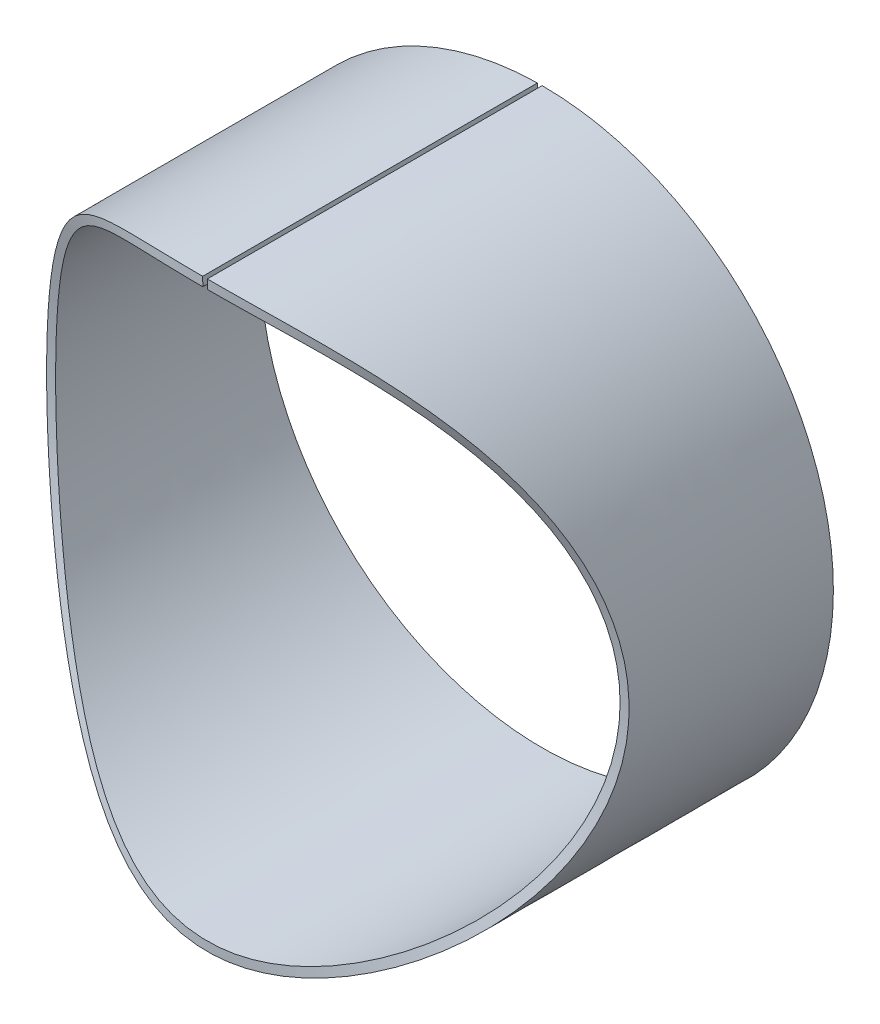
ISO-10303-21;
HEADER;
FILE_DESCRIPTION(('STEP AP214'),'2;1');
FILE_NAME('part.step','',(''),(''),'','','');
FILE_SCHEMA(('AUTOMOTIVE_DESIGN { 1 0 10303 214 1 1 1 1 }'));
ENDSEC;
DATA;
#1=APPLICATION_CONTEXT('core data for automotive mechanical design processes');
#2=APPLICATION_PROTOCOL_DEFINITION('international standard','automotive_design',2000,#1);
#3=PRODUCT_CONTEXT('',#1,'mechanical');
#4=PRODUCT('Part','Part','',(#3));
#5=PRODUCT_RELATED_PRODUCT_CATEGORY('part','',(#4));
#6=PRODUCT_DEFINITION_FORMATION('','',#4);
#7=PRODUCT_DEFINITION_CONTEXT('part definition',#1,'design');
#8=PRODUCT_DEFINITION('design','',#6,#7);
#9=PRODUCT_DEFINITION_SHAPE('','',#8);
#10=(LENGTH_UNIT() NAMED_UNIT(*) SI_UNIT(.MILLI.,.METRE.));
#11=(NAMED_UNIT(*) PLANE_ANGLE_UNIT() SI_UNIT($,.RADIAN.));
#12=(NAMED_UNIT(*) SI_UNIT($,.STERADIAN.) SOLID_ANGLE_UNIT());
#13=UNCERTAINTY_MEASURE_WITH_UNIT(LENGTH_MEASURE(1.E-05),#10,'distance_accuracy_value','');
#14=(GEOMETRIC_REPRESENTATION_CONTEXT(3) GLOBAL_UNCERTAINTY_ASSIGNED_CONTEXT((#13)) GLOBAL_UNIT_ASSIGNED_CONTEXT((#10,
#11,#12)) REPRESENTATION_CONTEXT('',''));
#15=CARTESIAN_POINT('',(0.,0.,0.));
#16=DIRECTION('',(0.,0.,1.));
#17=DIRECTION('',(1.,0.,0.));
#18=AXIS2_PLACEMENT_3D('',#15,#16,#17);
#19=CARTESIAN_POINT('',(-1.03200000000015,-15.5082565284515,74.1426010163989));
#20=CARTESIAN_POINT('',(-3.22851674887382,-15.5434052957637,74.1025093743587));
#21=CARTESIAN_POINT('',(-5.43577621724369,-15.6912681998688,73.9331963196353));
#22=CARTESIAN_POINT('',(-9.83660321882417,-16.2159746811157,73.3443502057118));
#23=CARTESIAN_POINT('',(-11.9804598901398,-16.5860815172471,72.9330056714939));
#24=CARTESIAN_POINT('',(-16.1682362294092,-17.5224934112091,71.9230923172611));
#25=CARTESIAN_POINT('',(-18.2133708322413,-18.0890013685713,71.3245145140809));
#26=CARTESIAN_POINT('',(-21.2177182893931,-19.0806222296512,70.3167594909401));
#27=CARTESIAN_POINT('',(-22.2111189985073,-19.4358926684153,69.9615092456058));
#28=CARTESIAN_POINT('',(-24.1639635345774,-20.1882305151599,69.2235882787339));
#29=CARTESIAN_POINT('',(-25.1225234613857,-20.5844395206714,68.8421686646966));
#30=CARTESIAN_POINT('',(-27.9478012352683,-21.8319187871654,67.6668005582));
#31=CARTESIAN_POINT('',(-29.7640970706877,-22.7420698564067,66.8417552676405));
#32=CARTESIAN_POINT('',(-33.2795131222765,-24.7118339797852,65.1418938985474));
#33=CARTESIAN_POINT('',(-34.980459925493,-25.7724584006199,64.2670627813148));
#34=CARTESIAN_POINT('',(-38.2771234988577,-28.0468603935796,62.4912480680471));
#35=CARTESIAN_POINT('',(-39.8739991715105,-29.2614302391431,61.5902600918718));
#36=CARTESIAN_POINT('',(-42.1924752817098,-31.2039892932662,60.2352109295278));
#37=CARTESIAN_POINT('',(-42.9523378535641,-31.8714746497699,59.7829264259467));
#38=CARTESIAN_POINT('',(-44.4369646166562,-33.2385992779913,58.8859346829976));
#39=CARTESIAN_POINT('',(-45.1617381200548,-33.9382858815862,58.4412339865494));
#40=CARTESIAN_POINT('',(-47.2856476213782,-36.0867455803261,57.1193412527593));
#41=CARTESIAN_POINT('',(-48.6373798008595,-37.5865141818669,56.2551922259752));
#42=CARTESIAN_POINT('',(-51.2090084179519,-40.7299396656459,54.5769913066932));
#43=CARTESIAN_POINT('',(-52.4281668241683,-42.3725056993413,53.7629173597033));
#44=CARTESIAN_POINT('',(-54.1579296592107,-44.9537247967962,52.5911209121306));
#45=CARTESIAN_POINT('',(-54.7182576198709,-45.8349744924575,52.2082434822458));
#46=CARTESIAN_POINT('',(-55.7937344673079,-47.6210581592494,51.4679616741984));
#47=CARTESIAN_POINT('',(-56.3105725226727,-48.5279961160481,51.1096886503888));
#48=CARTESIAN_POINT('',(-57.7971712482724,-51.2914478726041,50.0729654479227));
#49=CARTESIAN_POINT('',(-58.702997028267,-53.1906127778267,49.4326212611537));
#50=CARTESIAN_POINT('',(-60.3380494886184,-57.1073093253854,48.266612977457));
#51=CARTESIAN_POINT('',(-61.0677454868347,-59.1258594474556,47.7409753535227));
#52=CARTESIAN_POINT('',(-62.0200108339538,-62.2530121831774,47.0511004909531));
#53=CARTESIAN_POINT('',(-62.3116462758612,-63.3058557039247,46.839068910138));
#54=CARTESIAN_POINT('',(-62.8396465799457,-65.4186923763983,46.454013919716));
#55=CARTESIAN_POINT('',(-63.0770988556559,-66.4814187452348,46.2804482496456));
#56=CARTESIAN_POINT('',(-63.7086460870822,-69.6884567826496,45.817991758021));
#57=CARTESIAN_POINT('',(-64.0219098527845,-71.8516334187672,45.5873502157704));
#58=CARTESIAN_POINT('',(-64.325827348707,-75.1336554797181,45.3631562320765));
#59=CARTESIAN_POINT('',(-64.3994582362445,-76.2334550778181,45.3087152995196));
#60=CARTESIAN_POINT('',(-64.4908165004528,-78.4470451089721,45.2412806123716));
#61=CARTESIAN_POINT('',(-64.5082238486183,-79.5618447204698,45.2284217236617));
#62=CARTESIAN_POINT('',(-64.4727629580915,-82.9196803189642,45.2546238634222));
#63=CARTESIAN_POINT('',(-64.3331933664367,-85.1462661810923,45.3577852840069));
#64=CARTESIAN_POINT('',(-63.9512575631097,-88.4686327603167,45.6390590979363));
#65=CARTESIAN_POINT('',(-63.7951947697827,-89.5731310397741,45.7538947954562));
#66=CARTESIAN_POINT('',(-63.4297313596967,-91.7533354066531,46.0222104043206));
#67=CARTESIAN_POINT('',(-63.2201645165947,-92.8316798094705,46.1758202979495));
#68=CARTESIAN_POINT('',(-62.5141096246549,-96.0323956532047,46.6921326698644));
#69=CARTESIAN_POINT('',(-61.9399319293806,-98.1218701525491,47.1103103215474));
#70=CARTESIAN_POINT('',(-60.929212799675,-101.191150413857,47.840211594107));
#71=CARTESIAN_POINT('',(-60.5675153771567,-102.203133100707,48.1006206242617));
#72=CARTESIAN_POINT('',(-59.7948800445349,-104.206927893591,48.6542109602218));
#73=CARTESIAN_POINT('',(-59.3833971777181,-105.199424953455,48.9478192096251));
#74=CARTESIAN_POINT('',(-58.0782706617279,-108.138230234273,49.8742991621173));
#75=CARTESIAN_POINT('',(-57.1269854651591,-110.017976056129,50.5430643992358));
#76=CARTESIAN_POINT('',(-55.0762127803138,-113.632970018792,51.9650669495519));
#77=CARTESIAN_POINT('',(-53.9760252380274,-115.369470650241,52.7182744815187));
#78=CARTESIAN_POINT('',(-51.6333999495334,-118.70963752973,54.2941367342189));
#79=CARTESIAN_POINT('',(-50.3901044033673,-120.314531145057,55.1167675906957));
#80=CARTESIAN_POINT('',(-48.4172260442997,-122.62713081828,56.3921090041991));
#81=CARTESIAN_POINT('',(-47.7419210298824,-123.381884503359,56.8241232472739));
#82=CARTESIAN_POINT('',(-46.3541572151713,-124.861687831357,57.7001297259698));
#83=CARTESIAN_POINT('',(-45.6403103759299,-125.587706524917,58.1452376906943));
#84=CARTESIAN_POINT('',(-43.458344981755,-127.704611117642,59.4859333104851));
#85=CARTESIAN_POINT('',(-41.9504242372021,-129.034908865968,60.3863421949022));
#86=CARTESIAN_POINT('',(-38.8276674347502,-131.542906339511,62.1822447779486));
#87=CARTESIAN_POINT('',(-37.2117520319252,-132.721473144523,63.077738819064));
#88=CARTESIAN_POINT('',(-33.8649527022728,-134.931247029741,64.843022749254));
#89=CARTESIAN_POINT('',(-32.1327689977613,-135.963304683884,65.7128225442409));
#90=CARTESIAN_POINT('',(-29.4365710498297,-137.400151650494,66.978518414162));
#91=CARTESIAN_POINT('',(-28.5211457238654,-137.86076712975,67.3939173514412));
#92=CARTESIAN_POINT('',(-26.6547495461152,-138.743820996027,68.2072303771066));
#93=CARTESIAN_POINT('',(-25.7038978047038,-139.166202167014,68.605138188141));
#94=CARTESIAN_POINT('',(-22.8249638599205,-140.362160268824,69.7536322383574));
#95=CARTESIAN_POINT('',(-20.8596353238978,-141.070197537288,70.4637752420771));
#96=CARTESIAN_POINT('',(-16.8263899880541,-142.302472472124,71.7353920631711));
#97=CARTESIAN_POINT('',(-14.7565079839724,-142.827298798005,72.2968870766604));
#98=CARTESIAN_POINT('',(-12.0924455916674,-143.358708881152,72.8764148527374));
#99=CARTESIAN_POINT('',(-11.5560614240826,-143.458717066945,72.9862008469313));
#100=CARTESIAN_POINT('',(-10.4743236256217,-143.646208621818,73.1928042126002));
#101=CARTESIAN_POINT('',(-9.92887789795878,-143.733591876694,73.2896409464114));
#102=CARTESIAN_POINT('',(-8.29414225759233,-143.973983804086,73.5571526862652));
#103=CARTESIAN_POINT('',(-7.20157412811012,-144.106293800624,73.7055005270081));
#104=CARTESIAN_POINT('',(-3.91590383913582,-144.418982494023,74.0578780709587));
#105=CARTESIAN_POINT('',(-1.71490482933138,-144.515098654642,74.1692467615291));
#106=CARTESIAN_POINT('',(1.60160967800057,-144.489588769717,74.1401406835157));
#107=CARTESIAN_POINT('',(2.70958479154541,-144.452778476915,74.09809462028));
#108=CARTESIAN_POINT('',(4.93316736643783,-144.320620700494,73.9479760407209));
#109=CARTESIAN_POINT('',(6.04841640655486,-144.225295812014,73.8398939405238));
#110=CARTESIAN_POINT('',(9.34426798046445,-143.857830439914,73.4266649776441));
#111=CARTESIAN_POINT('',(11.4932475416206,-143.50430082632,73.0324927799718));
#112=CARTESIAN_POINT('',(15.7041404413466,-142.596064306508,72.0493276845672));
#113=CARTESIAN_POINT('',(17.7673476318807,-142.041116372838,71.4603254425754));
#114=CARTESIAN_POINT('',(20.8054709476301,-141.061563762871,70.4599722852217));
#115=CARTESIAN_POINT('',(21.8012650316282,-140.712808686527,70.1094304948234));
#116=CARTESIAN_POINT('',(23.7564640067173,-139.974773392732,69.3820149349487));
#117=CARTESIAN_POINT('',(24.7159520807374,-139.585455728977,69.0051420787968));
#118=CARTESIAN_POINT('',(27.5457690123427,-138.358509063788,67.8419996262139));
#119=CARTESIAN_POINT('',(29.369047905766,-137.461167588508,67.0231994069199));
#120=CARTESIAN_POINT('',(32.9034166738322,-135.513277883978,65.3307664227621));
#121=CARTESIAN_POINT('',(34.616204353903,-134.461802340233,64.4571184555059));
#122=CARTESIAN_POINT('',(37.1087528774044,-132.765787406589,63.1233486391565));
#123=CARTESIAN_POINT('',(37.9263829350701,-132.180992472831,62.6748738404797));
#124=CARTESIAN_POINT('',(39.5387630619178,-130.970115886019,61.7730984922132));
#125=CARTESIAN_POINT('',(40.3339622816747,-130.343165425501,61.3186505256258));
#126=CARTESIAN_POINT('',(42.669630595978,-128.411279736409,59.96019602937));
#127=CARTESIAN_POINT('',(44.1594516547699,-127.055821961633,59.0611047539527));
#128=CARTESIAN_POINT('',(47.0096416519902,-124.208609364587,57.2943060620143));
#129=CARTESIAN_POINT('',(48.3709490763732,-122.715732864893,56.4264326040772));
#130=CARTESIAN_POINT('',(50.9652451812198,-119.5844524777,54.7376088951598));
#131=CARTESIAN_POINT('',(52.1994524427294,-117.944479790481,53.9166878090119));
#132=CARTESIAN_POINT('',(55.6999989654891,-112.78758328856,51.5486862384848));
#133=CARTESIAN_POINT('',(57.7108201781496,-109.118781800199,50.1390547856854));
#134=CARTESIAN_POINT('',(59.7896935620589,-104.219231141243,48.6579096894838));
#135=CARTESIAN_POINT('',(60.1840203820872,-103.223036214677,48.3757260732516));
#136=CARTESIAN_POINT('',(60.9276908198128,-101.195029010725,47.841480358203));
#137=CARTESIAN_POINT('',(61.2769033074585,-100.163585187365,47.5894021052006));
#138=CARTESIAN_POINT('',(62.2428754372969,-97.0525847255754,46.8899588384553));
#139=CARTESIAN_POINT('',(62.7823124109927,-94.9462655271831,46.4963311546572));
#140=CARTESIAN_POINT('',(63.6490249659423,-90.6697683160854,45.8616391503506));
#141=CARTESIAN_POINT('',(63.9765740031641,-88.4982063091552,45.6205905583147));
#142=CARTESIAN_POINT('',(64.300545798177,-85.1887810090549,45.3817642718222));
#143=CARTESIAN_POINT('',(64.3808017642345,-84.0736541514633,45.3225046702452));
#144=CARTESIAN_POINT('',(64.4832499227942,-81.8460186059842,45.2468792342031));
#145=CARTESIAN_POINT('',(64.5052426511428,-80.7372479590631,45.2306268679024));
#146=CARTESIAN_POINT('',(64.4738029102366,-75.2149646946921,45.2538451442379));
#147=CARTESIAN_POINT('',(63.9994587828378,-70.8583025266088,45.6054581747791));
#148=CARTESIAN_POINT('',(62.9721935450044,-66.0340638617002,46.3571147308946));
#149=CARTESIAN_POINT('',(62.8511624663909,-65.4989133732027,46.4455730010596));
#150=CARTESIAN_POINT('',(62.5949772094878,-64.4301694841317,46.6325051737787));
#151=CARTESIAN_POINT('',(62.4598322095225,-63.89662885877,46.7309781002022));
#152=CARTESIAN_POINT('',(62.0366908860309,-62.3111392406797,47.0389934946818));
#153=CARTESIAN_POINT('',(61.7301052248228,-61.2693435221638,47.2615435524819));
#154=CARTESIAN_POINT('',(60.7391133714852,-58.1883044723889,47.9780267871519));
#155=CARTESIAN_POINT('',(59.9834540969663,-56.1934314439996,48.5208038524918));
#156=CARTESIAN_POINT('',(58.2946248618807,-52.3150015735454,49.7214704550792));
#157=CARTESIAN_POINT('',(57.361212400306,-50.4306907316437,50.3793433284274));
#158=CARTESIAN_POINT('',(55.8288840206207,-47.6814853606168,51.4435846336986));
#159=CARTESIAN_POINT('',(55.2950189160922,-46.7766456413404,51.8122764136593));
#160=CARTESIAN_POINT('',(54.1924028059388,-45.0069469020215,52.5673567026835));
#161=CARTESIAN_POINT('',(53.624017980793,-44.1427113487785,52.953766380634));
#162=CARTESIAN_POINT('',(50.7006593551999,-39.9172525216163,54.9252702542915));
#163=CARTESIAN_POINT('',(48.095739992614,-36.8352956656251,56.6287352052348));
#164=CARTESIAN_POINT('',(43.7994021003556,-32.6090952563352,59.2796588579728));
#165=CARTESIAN_POINT('',(42.3000050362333,-31.2655554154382,60.1798543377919));
#166=CARTESIAN_POINT('',(39.1651832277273,-28.7123315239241,61.9925723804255));
#167=CARTESIAN_POINT('',(37.5479627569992,-27.5173187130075,62.8939308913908));
#168=CARTESIAN_POINT('',(34.2106675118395,-25.2833581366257,64.665950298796));
#169=CARTESIAN_POINT('',(32.4894639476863,-24.2436564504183,65.5366161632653));
#170=CARTESIAN_POINT('',(28.9334747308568,-22.3176287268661,67.2225957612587));
#171=CARTESIAN_POINT('',(27.0968005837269,-21.4302930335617,68.0379284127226));
#172=CARTESIAN_POINT('',(24.2403809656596,-20.219026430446,69.1935177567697));
#173=CARTESIAN_POINT('',(23.2718127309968,-19.835391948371,69.5674717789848));
#174=CARTESIAN_POINT('',(21.2968161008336,-19.1082685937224,70.2885665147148));
#175=CARTESIAN_POINT('',(20.2964278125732,-18.7674504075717,70.6331464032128));
#176=CARTESIAN_POINT('',(17.2666316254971,-17.8180582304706,71.6084139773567));
#177=CARTESIAN_POINT('',(15.2011708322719,-17.278994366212,72.1826836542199));
#178=CARTESIAN_POINT('',(12.0256371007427,-16.6215063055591,72.8972471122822));
#179=CARTESIAN_POINT('',(10.9548868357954,-16.4276210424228,73.1109557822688));
#180=CARTESIAN_POINT('',(9.32639859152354,-16.1754747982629,73.3906718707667));
#181=CARTESIAN_POINT('',(8.77909256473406,-16.0978932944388,73.4772525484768));
#182=CARTESIAN_POINT('',(7.68363415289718,-15.9568894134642,73.6349894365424));
#183=CARTESIAN_POINT('',(7.13563460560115,-15.8934904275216,73.7061459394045));
#184=CARTESIAN_POINT('',(4.39447917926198,-15.6119112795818,74.0230204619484));
#185=CARTESIAN_POINT('',(2.19785146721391,-15.4999999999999,74.1520194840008));
#186=CARTESIAN_POINT('',(0.,-15.4999999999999,74.1520194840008));
#187=CARTESIAN_POINT('',(-1.00000000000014,-17.5080005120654,74.1426010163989));
#188=CARTESIAN_POINT('',(-3.12863891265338,-17.5420630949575,74.1025075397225));
#189=CARTESIAN_POINT('',(-5.26689019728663,-17.6852974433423,73.9331969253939));
#190=CARTESIAN_POINT('',(-9.53192936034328,-18.1938141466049,73.3443668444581));
#191=CARTESIAN_POINT('',(-11.608672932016,-18.5523372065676,72.9330383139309));
#192=CARTESIAN_POINT('',(-15.6671730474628,-19.4598428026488,71.9231399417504));
#193=CARTESIAN_POINT('',(-17.6489295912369,-20.0088253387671,71.3245701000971));
#194=CARTESIAN_POINT('',(-20.5596762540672,-20.9695531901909,70.3168273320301));
#195=CARTESIAN_POINT('',(-21.5220167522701,-21.3137005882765,69.9615823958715));
#196=CARTESIAN_POINT('',(-23.4151252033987,-22.0430258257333,69.2236564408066));
#197=CARTESIAN_POINT('',(-24.3440080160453,-22.4269756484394,68.8422439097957));
#198=CARTESIAN_POINT('',(-27.081392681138,-23.6356479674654,67.6668852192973));
#199=CARTESIAN_POINT('',(-28.8406307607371,-24.5171933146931,66.8418179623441));
#200=CARTESIAN_POINT('',(-32.2477393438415,-26.4262715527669,65.1419075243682));
#201=CARTESIAN_POINT('',(-33.8956098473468,-27.4538044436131,64.2670643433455));
#202=CARTESIAN_POINT('',(-37.0904703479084,-29.6579713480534,62.4912402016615));
#203=CARTESIAN_POINT('',(-38.6374603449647,-30.8346053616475,61.5902592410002));
#204=CARTESIAN_POINT('',(-40.8840576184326,-32.7169401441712,60.2352196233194));
#205=CARTESIAN_POINT('',(-41.6206087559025,-33.3639490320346,59.7829450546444));
#206=CARTESIAN_POINT('',(-43.0591272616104,-34.6886152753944,58.8859787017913));
#207=CARTESIAN_POINT('',(-43.7610946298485,-35.3662726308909,58.4412869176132));
#208=CARTESIAN_POINT('',(-45.8200530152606,-37.4490325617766,57.1194565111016));
#209=CARTESIAN_POINT('',(-47.1295939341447,-38.9020364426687,56.2553802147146));
#210=CARTESIAN_POINT('',(-49.6209533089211,-41.9473541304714,54.577247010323));
#211=CARTESIAN_POINT('',(-50.8027717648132,-43.539667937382,53.7631901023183));
#212=CARTESIAN_POINT('',(-52.4785627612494,-46.0403576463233,52.5914178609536));
#213=CARTESIAN_POINT('',(-53.0214936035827,-46.8942289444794,52.2085460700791));
#214=CARTESIAN_POINT('',(-54.0638854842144,-48.6253741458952,51.4682892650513));
#215=CARTESIAN_POINT('',(-54.5647068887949,-49.5042180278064,51.1100305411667));
#216=CARTESIAN_POINT('',(-56.0051121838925,-52.1818122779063,50.0733305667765));
#217=CARTESIAN_POINT('',(-56.8826371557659,-54.0216252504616,49.4329655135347));
#218=CARTESIAN_POINT('',(-58.4672083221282,-57.8174115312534,48.2669301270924));
#219=CARTESIAN_POINT('',(-59.1742545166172,-59.7733848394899,47.7412597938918));
#220=CARTESIAN_POINT('',(-60.0968900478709,-62.8032446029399,47.0513090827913));
#221=CARTESIAN_POINT('',(-60.379424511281,-63.823190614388,46.8392507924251));
#222=CARTESIAN_POINT('',(-60.8912224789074,-65.8711963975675,46.4541672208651));
#223=CARTESIAN_POINT('',(-61.1213264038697,-66.9010597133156,46.2805963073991));
#224=CARTESIAN_POINT('',(-61.7332634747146,-70.0085213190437,45.8181183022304));
#225=CARTESIAN_POINT('',(-62.0367219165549,-72.1039912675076,45.5874459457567));
#226=CARTESIAN_POINT('',(-62.3312020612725,-75.2841010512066,45.3631953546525));
#227=CARTESIAN_POINT('',(-62.4025775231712,-76.3502884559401,45.3087381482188));
#228=CARTESIAN_POINT('',(-62.4910995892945,-78.4951584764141,45.2412911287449));
#229=CARTESIAN_POINT('',(-62.507970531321,-79.5752712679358,45.2284275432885));
#230=CARTESIAN_POINT('',(-62.4736041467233,-82.829466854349,45.2546208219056));
#231=CARTESIAN_POINT('',(-62.3383837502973,-84.986534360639,45.3577889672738));
#232=CARTESIAN_POINT('',(-61.968291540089,-88.2058768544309,45.6390748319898));
#233=CARTESIAN_POINT('',(-61.8170505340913,-89.2762812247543,45.7539257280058));
#234=CARTESIAN_POINT('',(-61.4629184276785,-91.3888888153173,46.0222682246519));
#235=CARTESIAN_POINT('',(-61.2598542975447,-92.4337828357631,46.1758925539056));
#236=CARTESIAN_POINT('',(-60.5756021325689,-95.535665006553,46.6922554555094));
#237=CARTESIAN_POINT('',(-60.0193543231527,-97.5598532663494,47.1104839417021));
#238=CARTESIAN_POINT('',(-59.0400448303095,-100.533758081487,47.8404186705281));
#239=CARTESIAN_POINT('',(-58.6894520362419,-101.514663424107,48.1008289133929));
#240=CARTESIAN_POINT('',(-57.9408174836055,-103.456218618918,48.6544487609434));
#241=CARTESIAN_POINT('',(-57.5421360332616,-104.41785409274,48.9480729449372));
#242=CARTESIAN_POINT('',(-56.2773177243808,-107.265905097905,49.8745838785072));
#243=CARTESIAN_POINT('',(-55.3557779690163,-109.086877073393,50.5433613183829));
#244=CARTESIAN_POINT('',(-53.3683647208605,-112.590196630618,51.9653217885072));
#245=CARTESIAN_POINT('',(-52.3024912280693,-114.272544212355,52.718504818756));
#246=CARTESIAN_POINT('',(-50.0321716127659,-117.509624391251,54.2943000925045));
#247=CARTESIAN_POINT('',(-48.8277254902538,-119.064356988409,55.1169123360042));
#248=CARTESIAN_POINT('',(-46.9161368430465,-121.305116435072,56.3921997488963));
#249=CARTESIAN_POINT('',(-46.2614540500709,-122.036813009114,56.8241903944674));
#250=CARTESIAN_POINT('',(-44.9169503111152,-123.470488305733,57.7001775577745));
#251=CARTESIAN_POINT('',(-44.2252005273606,-124.174043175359,58.1452757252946));
#252=CARTESIAN_POINT('',(-42.1106389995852,-126.225554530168,59.4859417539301));
#253=CARTESIAN_POINT('',(-40.6498129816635,-127.514304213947,60.3863384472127));
#254=CARTESIAN_POINT('',(-37.6235361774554,-129.944814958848,62.1822374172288));
#255=CARTESIAN_POINT('',(-36.0580853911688,-131.086576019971,63.0777396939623));
#256=CARTESIAN_POINT('',(-32.8146484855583,-133.228103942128,64.8430592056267));
#257=CARTESIAN_POINT('',(-31.1366623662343,-134.227870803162,65.7128764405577));
#258=CARTESIAN_POINT('',(-28.5237586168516,-135.620330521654,66.9785971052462));
#259=CARTESIAN_POINT('',(-27.6368032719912,-136.066618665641,67.3940031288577));
#260=CARTESIAN_POINT('',(-25.8284365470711,-136.922218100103,68.2073197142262));
#261=CARTESIAN_POINT('',(-24.9070251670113,-137.331529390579,68.6052302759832));
#262=CARTESIAN_POINT('',(-22.1170147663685,-138.490548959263,69.7537320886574));
#263=CARTESIAN_POINT('',(-20.2130852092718,-139.176470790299,70.4638693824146));
#264=CARTESIAN_POINT('',(-16.3042119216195,-140.370748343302,71.7354864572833));
#265=CARTESIAN_POINT('',(-14.2992681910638,-140.87910406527,72.2969662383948));
#266=CARTESIAN_POINT('',(-11.7177207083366,-141.394055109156,72.8764642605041));
#267=CARTESIAN_POINT('',(-11.1976428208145,-141.491020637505,72.9862462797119));
#268=CARTESIAN_POINT('',(-10.1496444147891,-141.672664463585,73.1928391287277));
#269=CARTESIAN_POINT('',(-9.62111090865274,-141.757340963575,73.2896712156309));
#270=CARTESIAN_POINT('',(-8.03676208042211,-141.990323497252,73.5571727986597));
#271=CARTESIAN_POINT('',(-6.97807018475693,-142.118527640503,73.7055188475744));
#272=CARTESIAN_POINT('',(-3.79448078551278,-142.421501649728,74.0578897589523));
#273=CARTESIAN_POINT('',(-1.66206956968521,-142.514633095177,74.1692473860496));
#274=CARTESIAN_POINT('',(1.55211740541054,-142.489910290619,74.1401404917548));
#275=CARTESIAN_POINT('',(2.62556461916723,-142.454242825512,74.0980964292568));
#276=CARTESIAN_POINT('',(4.77986802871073,-142.326202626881,73.9479766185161));
#277=CARTESIAN_POINT('',(5.86072422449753,-142.233829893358,73.8399008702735));
#278=CARTESIAN_POINT('',(9.0548161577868,-141.877709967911,73.4266846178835));
#279=CARTESIAN_POINT('',(11.1366045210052,-141.535232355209,73.0325285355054));
#280=CARTESIAN_POINT('',(15.2174482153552,-140.655045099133,72.0493834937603));
#281=CARTESIAN_POINT('',(17.216503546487,-140.117335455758,71.4603945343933));
#282=CARTESIAN_POINT('',(20.1603355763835,-139.16818295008,70.4600591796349));
#283=CARTESIAN_POINT('',(21.1252938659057,-138.830227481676,70.1095201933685));
#284=CARTESIAN_POINT('',(23.01988922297,-138.11506734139,69.3821062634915));
#285=CARTESIAN_POINT('',(23.9495262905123,-137.737862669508,69.0052313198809));
#286=CARTESIAN_POINT('',(26.6919293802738,-136.548815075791,67.8420748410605));
#287=CARTESIAN_POINT('',(28.4581872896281,-135.679538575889,67.0232616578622));
#288=CARTESIAN_POINT('',(31.8836038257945,-133.791694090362,65.3307988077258));
#289=CARTESIAN_POINT('',(33.5427624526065,-132.773126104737,64.4571491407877));
#290=CARTESIAN_POINT('',(35.9578150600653,-131.129841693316,63.123353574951));
#291=CARTESIAN_POINT('',(36.7505517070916,-130.562841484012,62.6748682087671));
#292=CARTESIAN_POINT('',(38.3125697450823,-129.389786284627,61.773091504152));
#293=CARTESIAN_POINT('',(39.0833748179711,-128.782072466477,61.3186424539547));
#294=CARTESIAN_POINT('',(41.3466667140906,-126.910051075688,59.9602037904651));
#295=CARTESIAN_POINT('',(42.7900302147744,-125.596863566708,59.0611226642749));
#296=CARTESIAN_POINT('',(45.5521429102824,-122.837634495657,57.2943798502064));
#297=CARTESIAN_POINT('',(46.8709686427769,-121.391344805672,56.4265337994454));
#298=CARTESIAN_POINT('',(49.3851183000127,-118.356794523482,54.7377808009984));
#299=CARTESIAN_POINT('',(50.5804422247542,-116.768533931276,53.9168738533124));
#300=CARTESIAN_POINT('',(53.9738509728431,-111.769455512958,51.5489641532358));
#301=CARTESIAN_POINT('',(55.9208115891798,-108.21712999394,50.1393286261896));
#302=CARTESIAN_POINT('',(57.9358211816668,-103.468081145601,48.6581473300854));
#303=CARTESIAN_POINT('',(58.3178885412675,-102.502839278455,48.3759542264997));
#304=CARTESIAN_POINT('',(59.0383932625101,-100.538000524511,47.8416663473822));
#305=CARTESIAN_POINT('',(59.3768306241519,-99.5384036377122,47.5895715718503));
#306=CARTESIAN_POINT('',(60.3129203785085,-96.5236364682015,46.8900790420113));
#307=CARTESIAN_POINT('',(60.8355538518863,-94.4829361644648,46.4964168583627));
#308=CARTESIAN_POINT('',(61.6754896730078,-90.3385562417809,45.8616894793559));
#309=CARTESIAN_POINT('',(61.9927920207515,-88.2348766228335,45.6206242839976));
#310=CARTESIAN_POINT('',(62.3067091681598,-85.028160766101,45.3817646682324));
#311=CARTESIAN_POINT('',(62.3845038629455,-83.9471902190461,45.322497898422));
#312=CARTESIAN_POINT('',(62.4837712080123,-81.7887184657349,45.2468783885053));
#313=CARTESIAN_POINT('',(62.505082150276,-80.714749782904,45.2306289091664));
#314=CARTESIAN_POINT('',(62.4746069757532,-75.3618890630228,45.2538567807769));
#315=CARTESIAN_POINT('',(62.0152581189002,-71.1430820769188,45.6055148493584));
#316=CARTESIAN_POINT('',(61.019561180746,-66.4670886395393,46.3572227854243));
#317=CARTESIAN_POINT('',(60.902276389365,-65.9485083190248,46.4456916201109));
#318=CARTESIAN_POINT('',(60.6540658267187,-64.9130313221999,46.6326472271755));
#319=CARTESIAN_POINT('',(60.5231400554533,-64.3961346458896,46.7311339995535));
#320=CARTESIAN_POINT('',(60.1130028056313,-62.8593676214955,47.039175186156));
#321=CARTESIAN_POINT('',(59.815913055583,-61.8498544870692,47.2617539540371));
#322=CARTESIAN_POINT('',(58.8557294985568,-58.8645912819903,47.9783097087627));
#323=CARTESIAN_POINT('',(58.1237213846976,-56.9321174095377,48.5211061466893));
#324=CARTESIAN_POINT('',(56.4870293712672,-53.1734078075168,49.7217670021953));
#325=CARTESIAN_POINT('',(55.5823454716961,-51.3471720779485,50.3796314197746));
#326=CARTESIAN_POINT('',(54.0979408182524,-48.6839383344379,51.4438815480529));
#327=CARTESIAN_POINT('',(53.5804181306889,-47.8067906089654,51.8125612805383));
#328=CARTESIAN_POINT('',(52.5121504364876,-46.0922148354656,52.5676330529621));
#329=CARTESIAN_POINT('',(51.9614054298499,-45.2547867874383,52.9540250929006));
#330=CARTESIAN_POINT('',(49.1276669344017,-41.1588532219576,54.9254408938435));
#331=CARTESIAN_POINT('',(46.6046330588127,-38.1739677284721,56.6288314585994));
#332=CARTESIAN_POINT('',(42.4411837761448,-34.0784841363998,59.27967321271));
#333=CARTESIAN_POINT('',(40.9885533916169,-32.7768445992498,60.1798556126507));
#334=CARTESIAN_POINT('',(37.9505797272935,-30.3025009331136,61.9925630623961));
#335=CARTESIAN_POINT('',(36.3838769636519,-29.1448176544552,62.8939243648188));
#336=CARTESIAN_POINT('',(33.1496870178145,-26.9798748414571,64.665966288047));
#337=CARTESIAN_POINT('',(31.4821998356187,-25.9726153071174,65.5366469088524));
#338=CARTESIAN_POINT('',(28.0357506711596,-24.1059159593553,67.222681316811));
#339=CARTESIAN_POINT('',(26.2567886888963,-23.246476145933,68.038035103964));
#340=CARTESIAN_POINT('',(23.4892368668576,-22.0728920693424,69.1936119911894));
#341=CARTESIAN_POINT('',(22.5502014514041,-21.7009599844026,69.5675619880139));
#342=CARTESIAN_POINT('',(20.6365105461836,-20.9964061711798,70.2886509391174));
#343=CARTESIAN_POINT('',(19.6674164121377,-20.6662395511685,70.6332246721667));
#344=CARTESIAN_POINT('',(16.730629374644,-19.7459907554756,71.6084880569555));
#345=CARTESIAN_POINT('',(14.7298306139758,-19.2238237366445,72.1827569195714));
#346=CARTESIAN_POINT('',(11.6530804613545,-18.586788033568,72.8972885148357));
#347=CARTESIAN_POINT('',(10.614905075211,-18.3988119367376,73.1109870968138));
#348=CARTESIAN_POINT('',(9.03736137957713,-18.1545535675,73.3906905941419));
#349=CARTESIAN_POINT('',(8.50681565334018,-18.079346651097,73.4772681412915));
#350=CARTESIAN_POINT('',(7.44526065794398,-17.9427066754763,73.6350009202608));
#351=CARTESIAN_POINT('',(6.91425138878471,-17.8812736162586,73.7061561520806));
#352=CARTESIAN_POINT('',(4.25816647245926,-17.6084331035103,74.023025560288));
#353=CARTESIAN_POINT('',(2.12997511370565,-17.4999999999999,74.1520194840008));
#354=CARTESIAN_POINT('',(0.,-17.4999999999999,74.1520194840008));
#355=B_SPLINE_SURFACE_WITH_KNOTS('',1,3,((#19,#20,#21,#22,#23,#24,#25,#26,#27,#28,#29,#30,#31,
#32,#33,#34,#35,#36,#37,#38,#39,#40,#41,#42,#43,#44,#45,#46,#47,#48,#49,#50,#51,#52,#53,#54,#55,
#56,#57,#58,#59,#60,#61,#62,#63,#64,#65,#66,#67,#68,#69,#70,#71,#72,#73,#74,#75,#76,#77,#78,#79,
#80,#81,#82,#83,#84,#85,#86,#87,#88,#89,#90,#91,#92,#93,#94,#95,#96,#97,#98,#99,#100,#101,#102,
#103,#104,#105,#106,#107,#108,#109,#110,#111,#112,#113,#114,#115,#116,#117,#118,#119,#120,#121,
#122,#123,#124,#125,#126,#127,#128,#129,#130,#131,#132,#133,#134,#135,#136,#137,#138,#139,#140,
#141,#142,#143,#144,#145,#146,#147,#148,#149,#150,#151,#152,#153,#154,#155,#156,#157,#158,#159,
#160,#161,#162,#163,#164,#165,#166,#167,#168,#169,#170,#171,#172,#173,#174,#175,#176,#177,#178,
#179,#180,#181,#182,#183,#184,#185,#186),(#187,#188,#189,#190,#191,#192,#193,#194,#195,#196,
#197,#198,#199,#200,#201,#202,#203,#204,#205,#206,#207,#208,#209,#210,#211,#212,#213,#214,#215,
#216,#217,#218,#219,#220,#221,#222,#223,#224,#225,#226,#227,#228,#229,#230,#231,#232,#233,#234,
#235,#236,#237,#238,#239,#240,#241,#242,#243,#244,#245,#246,#247,#248,#249,#250,#251,#252,#253,
#254,#255,#256,#257,#258,#259,#260,#261,#262,#263,#264,#265,#266,#267,#268,#269,#270,#271,#272,
#273,#274,#275,#276,#277,#278,#279,#280,#281,#282,#283,#284,#285,#286,#287,#288,#289,#290,#291,
#292,#293,#294,#295,#296,#297,#298,#299,#300,#301,#302,#303,#304,#305,#306,#307,#308,#309,#310,
#311,#312,#313,#314,#315,#316,#317,#318,#319,#320,#321,#322,#323,#324,#325,#326,#327,#328,#329,
#330,#331,#332,#333,#334,#335,#336,#337,#338,#339,#340,#341,#342,#343,#344,#345,#346,#347,#348,
#349,#350,#351,#352,#353,#354)),.UNSPECIFIED.,.F.,.F.,.F.,(2,2),(4,2,2,2,2,2,2,2,2,2,2,2,2,2,2,
2,2,2,2,2,2,2,2,2,2,2,2,2,2,2,2,2,2,2,2,2,2,2,2,2,2,2,2,2,2,2,2,2,2,2,2,2,2,2,2,2,2,2,2,2,2,2,2,
2,2,2,2,2,2,2,2,2,2,2,2,2,2,2,2,2,2,2,2,4),(0.,1.),(0.,0.015625,0.03125,0.046875,0.0546875,
0.0625,0.078125,0.09375,0.109375,0.1171875,0.125,0.140625,0.15625,0.1640625,0.171875,0.1875,
0.203125,0.2109375,0.21875,0.234375,0.2421875,0.25,0.265625,0.2734375,0.28125,0.296875,
0.3046875,0.3125,0.328125,0.34375,0.359375,0.3671875,0.375,0.390625,0.40625,0.421875,0.4296875,
0.4375,0.453125,0.46875,0.47265625,0.4765625,0.484375,0.5,0.5078125,0.515625,0.53125,0.546875,
0.5546875,0.5625,0.578125,0.59375,0.6015625,0.609375,0.625,0.640625,0.65625,0.6875,0.6953125,
0.703125,0.71875,0.734375,0.7421875,0.75,0.78125,0.78515625,0.7890625,0.796875,0.8125,0.828125,
0.8359375,0.84375,0.875,0.890625,0.90625,0.921875,0.9375,0.9453125,0.953125,0.96875,0.9765625,
0.98046875,0.984375,1.),.UNSPECIFIED.);
#356=CARTESIAN_POINT('',(0.,-15.4999999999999,74.1520194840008));
#357=CARTESIAN_POINT('',(0.,-17.4999999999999,74.1520194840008));
#358=B_SPLINE_CURVE_WITH_KNOTS('',1,(#356,#357),.UNSPECIFIED.,.F.,.F.,(2,2),(0.,1.),.UNSPECIFIED.);
#359=CARTESIAN_POINT('',(0.,-17.4999999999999,74.1520194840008));
#360=VERTEX_POINT('',#359);
#361=CARTESIAN_POINT('',(0.,-15.4999999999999,74.1520194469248));
#362=VERTEX_POINT('',#361);
#363=EDGE_CURVE('E14',#360,#362,#358,.F.);
#364=CARTESIAN_POINT('',(0.,-17.4999999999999,74.1520194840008));
#365=CARTESIAN_POINT('',(2.12997511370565,-17.4999999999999,74.1520194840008));
#366=CARTESIAN_POINT('',(4.25816647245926,-17.6084331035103,74.023025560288));
#367=CARTESIAN_POINT('',(6.91425138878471,-17.8812736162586,73.7061561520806));
#368=CARTESIAN_POINT('',(7.44526065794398,-17.9427066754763,73.6350009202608));
#369=CARTESIAN_POINT('',(8.50681565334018,-18.079346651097,73.4772681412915));
#370=CARTESIAN_POINT('',(9.03736137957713,-18.1545535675,73.3906905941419));
#371=CARTESIAN_POINT('',(10.614905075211,-18.3988119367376,73.1109870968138));
#372=CARTESIAN_POINT('',(11.6530804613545,-18.586788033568,72.8972885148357));
#373=CARTESIAN_POINT('',(14.7298306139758,-19.2238237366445,72.1827569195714));
#374=CARTESIAN_POINT('',(16.730629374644,-19.7459907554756,71.6084880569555));
#375=CARTESIAN_POINT('',(19.6674164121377,-20.6662395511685,70.6332246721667));
#376=CARTESIAN_POINT('',(20.6365105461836,-20.9964061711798,70.2886509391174));
#377=CARTESIAN_POINT('',(22.5502014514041,-21.7009599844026,69.5675619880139));
#378=CARTESIAN_POINT('',(23.4892368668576,-22.0728920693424,69.1936119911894));
#379=CARTESIAN_POINT('',(26.2567886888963,-23.246476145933,68.038035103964));
#380=CARTESIAN_POINT('',(28.0357506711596,-24.1059159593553,67.222681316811));
#381=CARTESIAN_POINT('',(31.4821998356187,-25.9726153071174,65.5366469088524));
#382=CARTESIAN_POINT('',(33.1496870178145,-26.9798748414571,64.665966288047));
#383=CARTESIAN_POINT('',(36.3838769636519,-29.1448176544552,62.8939243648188));
#384=CARTESIAN_POINT('',(37.9505797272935,-30.3025009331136,61.9925630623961));
#385=CARTESIAN_POINT('',(40.9885533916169,-32.7768445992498,60.1798556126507));
#386=CARTESIAN_POINT('',(42.4411837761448,-34.0784841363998,59.27967321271));
#387=CARTESIAN_POINT('',(46.6046330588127,-38.1739677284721,56.6288314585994));
#388=CARTESIAN_POINT('',(49.1276669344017,-41.1588532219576,54.9254408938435));
#389=CARTESIAN_POINT('',(51.9614054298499,-45.2547867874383,52.9540250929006));
#390=CARTESIAN_POINT('',(52.5121504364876,-46.0922148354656,52.5676330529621));
#391=CARTESIAN_POINT('',(53.5804181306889,-47.8067906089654,51.8125612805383));
#392=CARTESIAN_POINT('',(54.0979408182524,-48.6839383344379,51.4438815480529));
#393=CARTESIAN_POINT('',(55.5823454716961,-51.3471720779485,50.3796314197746));
#394=CARTESIAN_POINT('',(56.4870293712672,-53.1734078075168,49.7217670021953));
#395=CARTESIAN_POINT('',(58.1237213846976,-56.9321174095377,48.5211061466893));
#396=CARTESIAN_POINT('',(58.8557294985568,-58.8645912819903,47.9783097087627));
#397=CARTESIAN_POINT('',(59.815913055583,-61.8498544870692,47.2617539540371));
#398=CARTESIAN_POINT('',(60.1130028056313,-62.8593676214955,47.039175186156));
#399=CARTESIAN_POINT('',(60.5231400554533,-64.3961346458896,46.7311339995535));
#400=CARTESIAN_POINT('',(60.6540658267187,-64.9130313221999,46.6326472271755));
#401=CARTESIAN_POINT('',(60.902276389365,-65.9485083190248,46.4456916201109));
#402=CARTESIAN_POINT('',(61.019561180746,-66.4670886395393,46.3572227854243));
#403=CARTESIAN_POINT('',(62.0152581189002,-71.1430820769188,45.6055148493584));
#404=CARTESIAN_POINT('',(62.4746069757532,-75.3618890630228,45.2538567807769));
#405=CARTESIAN_POINT('',(62.505082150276,-80.714749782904,45.2306289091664));
#406=CARTESIAN_POINT('',(62.4837712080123,-81.7887184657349,45.2468783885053));
#407=CARTESIAN_POINT('',(62.3845038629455,-83.9471902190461,45.322497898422));
#408=CARTESIAN_POINT('',(62.3067091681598,-85.028160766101,45.3817646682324));
#409=CARTESIAN_POINT('',(61.9927920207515,-88.2348766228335,45.6206242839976));
#410=CARTESIAN_POINT('',(61.6754896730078,-90.3385562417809,45.8616894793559));
#411=CARTESIAN_POINT('',(60.8355538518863,-94.4829361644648,46.4964168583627));
#412=CARTESIAN_POINT('',(60.3129203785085,-96.5236364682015,46.8900790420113));
#413=CARTESIAN_POINT('',(59.3768306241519,-99.5384036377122,47.5895715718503));
#414=CARTESIAN_POINT('',(59.0383932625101,-100.538000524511,47.8416663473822));
#415=CARTESIAN_POINT('',(58.3178885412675,-102.502839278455,48.3759542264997));
#416=CARTESIAN_POINT('',(57.9358211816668,-103.468081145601,48.6581473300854));
#417=CARTESIAN_POINT('',(55.9208115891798,-108.21712999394,50.1393286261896));
#418=CARTESIAN_POINT('',(53.9738509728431,-111.769455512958,51.5489641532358));
#419=CARTESIAN_POINT('',(50.5804422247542,-116.768533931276,53.9168738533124));
#420=CARTESIAN_POINT('',(49.3851183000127,-118.356794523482,54.7377808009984));
#421=CARTESIAN_POINT('',(46.8709686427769,-121.391344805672,56.4265337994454));
#422=CARTESIAN_POINT('',(45.5521429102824,-122.837634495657,57.2943798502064));
#423=CARTESIAN_POINT('',(42.7900302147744,-125.596863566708,59.0611226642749));
#424=CARTESIAN_POINT('',(41.3466667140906,-126.910051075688,59.9602037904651));
#425=CARTESIAN_POINT('',(39.0833748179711,-128.782072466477,61.3186424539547));
#426=CARTESIAN_POINT('',(38.3125697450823,-129.389786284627,61.773091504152));
#427=CARTESIAN_POINT('',(36.7505517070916,-130.562841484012,62.6748682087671));
#428=CARTESIAN_POINT('',(35.9578150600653,-131.129841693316,63.123353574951));
#429=CARTESIAN_POINT('',(33.5427624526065,-132.773126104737,64.4571491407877));
#430=CARTESIAN_POINT('',(31.8836038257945,-133.791694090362,65.3307988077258));
#431=CARTESIAN_POINT('',(28.4581872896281,-135.679538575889,67.0232616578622));
#432=CARTESIAN_POINT('',(26.6919293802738,-136.548815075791,67.8420748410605));
#433=CARTESIAN_POINT('',(23.9495262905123,-137.737862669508,69.0052313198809));
#434=CARTESIAN_POINT('',(23.01988922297,-138.11506734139,69.3821062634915));
#435=CARTESIAN_POINT('',(21.1252938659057,-138.830227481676,70.1095201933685));
#436=CARTESIAN_POINT('',(20.1603355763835,-139.16818295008,70.4600591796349));
#437=CARTESIAN_POINT('',(17.216503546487,-140.117335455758,71.4603945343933));
#438=CARTESIAN_POINT('',(15.2174482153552,-140.655045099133,72.0493834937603));
#439=CARTESIAN_POINT('',(11.1366045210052,-141.535232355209,73.0325285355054));
#440=CARTESIAN_POINT('',(9.0548161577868,-141.877709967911,73.4266846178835));
#441=CARTESIAN_POINT('',(5.86072422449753,-142.233829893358,73.8399008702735));
#442=CARTESIAN_POINT('',(4.77986802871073,-142.326202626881,73.9479766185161));
#443=CARTESIAN_POINT('',(2.62556461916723,-142.454242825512,74.0980964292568));
#444=CARTESIAN_POINT('',(1.55211740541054,-142.489910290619,74.1401404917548));
#445=CARTESIAN_POINT('',(-1.66206956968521,-142.514633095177,74.1692473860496));
#446=CARTESIAN_POINT('',(-3.79448078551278,-142.421501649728,74.0578897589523));
#447=CARTESIAN_POINT('',(-6.97807018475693,-142.118527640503,73.7055188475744));
#448=CARTESIAN_POINT('',(-8.03676208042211,-141.990323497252,73.5571727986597));
#449=CARTESIAN_POINT('',(-9.62111090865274,-141.757340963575,73.2896712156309));
#450=CARTESIAN_POINT('',(-10.1496444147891,-141.672664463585,73.1928391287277));
#451=CARTESIAN_POINT('',(-11.1976428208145,-141.491020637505,72.9862462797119));
#452=CARTESIAN_POINT('',(-11.7177207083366,-141.394055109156,72.8764642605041));
#453=CARTESIAN_POINT('',(-14.2992681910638,-140.87910406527,72.2969662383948));
#454=CARTESIAN_POINT('',(-16.3042119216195,-140.370748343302,71.7354864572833));
#455=CARTESIAN_POINT('',(-20.2130852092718,-139.176470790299,70.4638693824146));
#456=CARTESIAN_POINT('',(-22.1170147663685,-138.490548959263,69.7537320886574));
#457=CARTESIAN_POINT('',(-24.9070251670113,-137.331529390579,68.6052302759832));
#458=CARTESIAN_POINT('',(-25.8284365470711,-136.922218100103,68.2073197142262));
#459=CARTESIAN_POINT('',(-27.6368032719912,-136.066618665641,67.3940031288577));
#460=CARTESIAN_POINT('',(-28.5237586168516,-135.620330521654,66.9785971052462));
#461=CARTESIAN_POINT('',(-31.1366623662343,-134.227870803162,65.7128764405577));
#462=CARTESIAN_POINT('',(-32.8146484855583,-133.228103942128,64.8430592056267));
#463=CARTESIAN_POINT('',(-36.0580853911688,-131.086576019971,63.0777396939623));
#464=CARTESIAN_POINT('',(-37.6235361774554,-129.944814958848,62.1822374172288));
#465=CARTESIAN_POINT('',(-40.6498129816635,-127.514304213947,60.3863384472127));
#466=CARTESIAN_POINT('',(-42.1106389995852,-126.225554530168,59.4859417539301));
#467=CARTESIAN_POINT('',(-44.2252005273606,-124.174043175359,58.1452757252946));
#468=CARTESIAN_POINT('',(-44.9169503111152,-123.470488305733,57.7001775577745));
#469=CARTESIAN_POINT('',(-46.2614540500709,-122.036813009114,56.8241903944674));
#470=CARTESIAN_POINT('',(-46.9161368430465,-121.305116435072,56.3921997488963));
#471=CARTESIAN_POINT('',(-48.8277254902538,-119.064356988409,55.1169123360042));
#472=CARTESIAN_POINT('',(-50.0321716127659,-117.509624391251,54.2943000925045));
#473=CARTESIAN_POINT('',(-52.3024912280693,-114.272544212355,52.718504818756));
#474=CARTESIAN_POINT('',(-53.3683647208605,-112.590196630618,51.9653217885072));
#475=CARTESIAN_POINT('',(-55.3557779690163,-109.086877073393,50.5433613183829));
#476=CARTESIAN_POINT('',(-56.2773177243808,-107.265905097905,49.8745838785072));
#477=CARTESIAN_POINT('',(-57.5421360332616,-104.41785409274,48.9480729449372));
#478=CARTESIAN_POINT('',(-57.9408174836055,-103.456218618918,48.6544487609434));
#479=CARTESIAN_POINT('',(-58.6894520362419,-101.514663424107,48.1008289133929));
#480=CARTESIAN_POINT('',(-59.0400448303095,-100.533758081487,47.8404186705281));
#481=CARTESIAN_POINT('',(-60.0193543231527,-97.5598532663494,47.1104839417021));
#482=CARTESIAN_POINT('',(-60.5756021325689,-95.535665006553,46.6922554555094));
#483=CARTESIAN_POINT('',(-61.2598542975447,-92.4337828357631,46.1758925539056));
#484=CARTESIAN_POINT('',(-61.4629184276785,-91.3888888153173,46.0222682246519));
#485=CARTESIAN_POINT('',(-61.8170505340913,-89.2762812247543,45.7539257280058));
#486=CARTESIAN_POINT('',(-61.968291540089,-88.2058768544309,45.6390748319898));
#487=CARTESIAN_POINT('',(-62.3383837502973,-84.986534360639,45.3577889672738));
#488=CARTESIAN_POINT('',(-62.4736041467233,-82.829466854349,45.2546208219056));
#489=CARTESIAN_POINT('',(-62.507970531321,-79.5752712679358,45.2284275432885));
#490=CARTESIAN_POINT('',(-62.4910995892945,-78.4951584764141,45.2412911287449));
#491=CARTESIAN_POINT('',(-62.4025775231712,-76.3502884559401,45.3087381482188));
#492=CARTESIAN_POINT('',(-62.3312020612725,-75.2841010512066,45.3631953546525));
#493=CARTESIAN_POINT('',(-62.0367219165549,-72.1039912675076,45.5874459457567));
#494=CARTESIAN_POINT('',(-61.7332634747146,-70.0085213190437,45.8181183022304));
#495=CARTESIAN_POINT('',(-61.1213264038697,-66.9010597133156,46.2805963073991));
#496=CARTESIAN_POINT('',(-60.8912224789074,-65.8711963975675,46.4541672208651));
#497=CARTESIAN_POINT('',(-60.379424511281,-63.823190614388,46.8392507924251));
#498=CARTESIAN_POINT('',(-60.0968900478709,-62.8032446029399,47.0513090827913));
#499=CARTESIAN_POINT('',(-59.1742545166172,-59.7733848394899,47.7412597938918));
#500=CARTESIAN_POINT('',(-58.4672083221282,-57.8174115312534,48.2669301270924));
#501=CARTESIAN_POINT('',(-56.8826371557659,-54.0216252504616,49.4329655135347));
#502=CARTESIAN_POINT('',(-56.0051121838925,-52.1818122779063,50.0733305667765));
#503=CARTESIAN_POINT('',(-54.5647068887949,-49.5042180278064,51.1100305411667));
#504=CARTESIAN_POINT('',(-54.0638854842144,-48.6253741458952,51.4682892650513));
#505=CARTESIAN_POINT('',(-53.0214936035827,-46.8942289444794,52.2085460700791));
#506=CARTESIAN_POINT('',(-52.4785627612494,-46.0403576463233,52.5914178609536));
#507=CARTESIAN_POINT('',(-50.8027717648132,-43.539667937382,53.7631901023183));
#508=CARTESIAN_POINT('',(-49.6209533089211,-41.9473541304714,54.577247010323));
#509=CARTESIAN_POINT('',(-47.1295939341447,-38.9020364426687,56.2553802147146));
#510=CARTESIAN_POINT('',(-45.8200530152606,-37.4490325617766,57.1194565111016));
#511=CARTESIAN_POINT('',(-43.7610946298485,-35.3662726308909,58.4412869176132));
#512=CARTESIAN_POINT('',(-43.0591272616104,-34.6886152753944,58.8859787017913));
#513=CARTESIAN_POINT('',(-41.6206087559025,-33.3639490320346,59.7829450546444));
#514=CARTESIAN_POINT('',(-40.8840576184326,-32.7169401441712,60.2352196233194));
#515=CARTESIAN_POINT('',(-38.6374603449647,-30.8346053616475,61.5902592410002));
#516=CARTESIAN_POINT('',(-37.0904703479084,-29.6579713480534,62.4912402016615));
#517=CARTESIAN_POINT('',(-33.8956098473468,-27.4538044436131,64.2670643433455));
#518=CARTESIAN_POINT('',(-32.2477393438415,-26.4262715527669,65.1419075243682));
#519=CARTESIAN_POINT('',(-28.8406307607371,-24.5171933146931,66.8418179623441));
#520=CARTESIAN_POINT('',(-27.081392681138,-23.6356479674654,67.6668852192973));
#521=CARTESIAN_POINT('',(-24.3440080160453,-22.4269756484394,68.8422439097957));
#522=CARTESIAN_POINT('',(-23.4151252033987,-22.0430258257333,69.2236564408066));
#523=CARTESIAN_POINT('',(-21.5220167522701,-21.3137005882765,69.9615823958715));
#524=CARTESIAN_POINT('',(-20.5596762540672,-20.9695531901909,70.3168273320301));
#525=CARTESIAN_POINT('',(-17.6489295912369,-20.0088253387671,71.3245701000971));
#526=CARTESIAN_POINT('',(-15.6671730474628,-19.4598428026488,71.9231399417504));
#527=CARTESIAN_POINT('',(-11.608672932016,-18.5523372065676,72.9330383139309));
#528=CARTESIAN_POINT('',(-9.53192936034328,-18.1938141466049,73.3443668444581));
#529=CARTESIAN_POINT('',(-5.26689019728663,-17.6852974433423,73.9331969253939));
#530=CARTESIAN_POINT('',(-3.12863891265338,-17.5420630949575,74.1025075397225));
#531=CARTESIAN_POINT('',(-1.00000000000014,-17.5080005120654,74.1426010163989));
#532=B_SPLINE_CURVE_WITH_KNOTS('',3,(#364,#365,#366,#367,#368,#369,#370,#371,#372,#373,#374,
#375,#376,#377,#378,#379,#380,#381,#382,#383,#384,#385,#386,#387,#388,#389,#390,#391,#392,#393,
#394,#395,#396,#397,#398,#399,#400,#401,#402,#403,#404,#405,#406,#407,#408,#409,#410,#411,#412,
#413,#414,#415,#416,#417,#418,#419,#420,#421,#422,#423,#424,#425,#426,#427,#428,#429,#430,#431,
#432,#433,#434,#435,#436,#437,#438,#439,#440,#441,#442,#443,#444,#445,#446,#447,#448,#449,#450,
#451,#452,#453,#454,#455,#456,#457,#458,#459,#460,#461,#462,#463,#464,#465,#466,#467,#468,#469,
#470,#471,#472,#473,#474,#475,#476,#477,#478,#479,#480,#481,#482,#483,#484,#485,#486,#487,#488,
#489,#490,#491,#492,#493,#494,#495,#496,#497,#498,#499,#500,#501,#502,#503,#504,#505,#506,#507,
#508,#509,#510,#511,#512,#513,#514,#515,#516,#517,#518,#519,#520,#521,#522,#523,#524,#525,#526,
#527,#528,#529,#530,#531),.UNSPECIFIED.,.F.,.F.,(4,2,2,2,2,2,2,2,2,2,2,2,2,2,2,2,2,2,2,2,2,2,2,
2,2,2,2,2,2,2,2,2,2,2,2,2,2,2,2,2,2,2,2,2,2,2,2,2,2,2,2,2,2,2,2,2,2,2,2,2,2,2,2,2,2,2,2,2,2,2,2,
2,2,2,2,2,2,2,2,2,2,2,2,4),(0.,0.015625,0.01953125,0.0234375,0.03125,0.046875,0.0546875,0.0625,
0.078125,0.09375,0.109375,0.125,0.15625,0.1640625,0.171875,0.1875,0.203125,0.2109375,0.21484375,
0.21875,0.25,0.2578125,0.265625,0.28125,0.296875,0.3046875,0.3125,0.34375,0.359375,0.375,
0.390625,0.3984375,0.40625,0.421875,0.4375,0.4453125,0.453125,0.46875,0.484375,0.4921875,0.5,
0.515625,0.5234375,0.52734375,0.53125,0.546875,0.5625,0.5703125,0.578125,0.59375,0.609375,0.625,
0.6328125,0.640625,0.65625,0.671875,0.6875,0.6953125,0.703125,0.71875,0.7265625,0.734375,0.75,
0.7578125,0.765625,0.78125,0.7890625,0.796875,0.8125,0.828125,0.8359375,0.84375,0.859375,0.875,
0.8828125,0.890625,0.90625,0.921875,0.9375,0.9453125,0.953125,0.96875,0.984375,1.),.UNSPECIFIED.);
#533=CARTESIAN_POINT('',(-1.00000000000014,-17.5080005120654,74.1426010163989));
#534=VERTEX_POINT('',#533);
#535=EDGE_CURVE('E274',#360,#534,#532,.T.);
#536=CARTESIAN_POINT('',(-1.00000000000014,-17.5080005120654,74.1426010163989));
#537=CARTESIAN_POINT('',(-1.03200000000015,-15.5082565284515,74.1426010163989));
#538=B_SPLINE_CURVE_WITH_KNOTS('',1,(#536,#537),.UNSPECIFIED.,.F.,.F.,(2,2),(0.,1.),.UNSPECIFIED.);
#539=CARTESIAN_POINT('',(-1.03200000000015,-15.5082565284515,74.1426010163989));
#540=VERTEX_POINT('',#539);
#541=EDGE_CURVE('E77',#534,#540,#538,.T.);
#542=CARTESIAN_POINT('',(0.,-15.4999999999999,74.1520194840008));
#543=CARTESIAN_POINT('',(0.549515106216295,-15.4999861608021,74.1520343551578));
#544=CARTESIAN_POINT('',(1.09902342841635,-15.5069938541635,74.1439555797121));
#545=CARTESIAN_POINT('',(2.19781080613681,-15.5350282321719,74.1118308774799));
#546=CARTESIAN_POINT('',(2.74708897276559,-15.5560700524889,74.0877677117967));
#547=CARTESIAN_POINT('',(3.84533563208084,-15.6122162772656,74.0238181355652));
#548=CARTESIAN_POINT('',(4.39430016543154,-15.6473545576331,73.9838936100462));
#549=CARTESIAN_POINT('',(5.49184732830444,-15.7317134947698,73.8883907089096));
#550=CARTESIAN_POINT('',(6.04042093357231,-15.7809860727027,73.8327546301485));
#551=CARTESIAN_POINT('',(7.13711140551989,-15.893643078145,73.705972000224));
#552=CARTESIAN_POINT('',(7.68521237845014,-15.957096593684,73.6347495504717));
#553=CARTESIAN_POINT('',(8.77938236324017,-16.0979265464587,73.4772234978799));
#554=CARTESIAN_POINT('',(9.32543801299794,-16.1753498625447,73.3908691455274));
#555=CARTESIAN_POINT('',(10.4106947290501,-16.3433376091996,73.2043963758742));
#556=CARTESIAN_POINT('',(10.9499151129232,-16.4338444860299,73.1043383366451));
#557=CARTESIAN_POINT('',(12.0217087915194,-16.6276785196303,72.8912627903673));
#558=CARTESIAN_POINT('',(12.5542972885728,-16.7309659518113,72.7782855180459));
#559=CARTESIAN_POINT('',(13.6130059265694,-16.9501663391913,72.5400566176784));
#560=CARTESIAN_POINT('',(14.1391363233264,-17.0660552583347,72.4148284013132));
#561=CARTESIAN_POINT('',(15.1851197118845,-17.3102241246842,72.1528084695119));
#562=CARTESIAN_POINT('',(15.7049775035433,-17.4384938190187,72.0160263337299));
#563=CARTESIAN_POINT('',(16.7386085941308,-17.707211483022,71.7315980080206));
#564=CARTESIAN_POINT('',(17.2523811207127,-17.8476609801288,71.5839504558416));
#565=CARTESIAN_POINT('',(18.2740266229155,-18.1404664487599,71.2784855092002));
#566=CARTESIAN_POINT('',(18.7818934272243,-18.292833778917,71.120658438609));
#567=CARTESIAN_POINT('',(20.2991399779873,-18.7683695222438,70.6322827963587));
#568=CARTESIAN_POINT('',(21.2986372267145,-19.1090516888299,70.287821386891));
#569=CARTESIAN_POINT('',(23.2675752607,-19.833719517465,69.5690989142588));
#570=CARTESIAN_POINT('',(24.2370837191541,-20.2175969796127,69.1949129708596));
#571=CARTESIAN_POINT('',(26.1421394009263,-21.0254993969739,68.4240839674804));
#572=CARTESIAN_POINT('',(27.0778574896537,-21.4492656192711,68.0275915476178));
#573=CARTESIAN_POINT('',(28.9174460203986,-22.3358735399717,67.2162810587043));
#574=CARTESIAN_POINT('',(29.8214214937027,-22.7985648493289,66.80153622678));
#575=CARTESIAN_POINT('',(31.6004033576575,-23.762117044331,65.9582037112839));
#576=CARTESIAN_POINT('',(32.4754445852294,-24.2629294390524,65.5296340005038));
#577=CARTESIAN_POINT('',(34.1981647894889,-25.3030534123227,64.6617650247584));
#578=CARTESIAN_POINT('',(35.0458172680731,-25.8424007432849,64.2224560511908));
#579=CARTESIAN_POINT('',(36.7151725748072,-26.95985558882,63.3361724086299));
#580=CARTESIAN_POINT('',(37.5367951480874,-27.5380685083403,62.8891795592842));
#581=CARTESIAN_POINT('',(39.1548322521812,-28.7342764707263,61.9901282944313));
#582=CARTESIAN_POINT('',(39.9511104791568,-29.3524453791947,61.5380559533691));
#583=CARTESIAN_POINT('',(41.5142858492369,-30.6256110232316,60.6342504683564));
#584=CARTESIAN_POINT('',(42.2811751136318,-31.280617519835,60.1825174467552));
#585=CARTESIAN_POINT('',(43.7809115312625,-32.6239177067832,59.2847974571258));
#586=CARTESIAN_POINT('',(44.5139023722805,-33.3120395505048,58.8387934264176));
#587=CARTESIAN_POINT('',(45.9466626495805,-34.7211940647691,57.9547624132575));
#588=CARTESIAN_POINT('',(46.6465375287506,-35.442105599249,57.5167132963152));
#589=CARTESIAN_POINT('',(48.0138581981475,-36.9182981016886,56.6506559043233));
#590=CARTESIAN_POINT('',(48.6813351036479,-37.67354468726,56.2226382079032));
#591=CARTESIAN_POINT('',(49.9834711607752,-39.2193654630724,55.378486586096));
#592=CARTESIAN_POINT('',(50.6181052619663,-40.0099657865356,54.962361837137));
#593=CARTESIAN_POINT('',(51.8543280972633,-41.6273189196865,54.1438482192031));
#594=CARTESIAN_POINT('',(52.4558251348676,-42.4541616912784,53.7414985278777));
#595=CARTESIAN_POINT('',(53.626026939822,-44.1456445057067,52.9525054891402));
#596=CARTESIAN_POINT('',(54.1945365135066,-45.0104649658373,52.5659589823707));
#597=CARTESIAN_POINT('',(55.2955301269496,-46.7773722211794,51.8118625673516));
#598=CARTESIAN_POINT('',(55.8278274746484,-47.679618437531,51.4444131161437));
#599=CARTESIAN_POINT('',(56.8489502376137,-49.5115942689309,50.7350282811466));
#600=CARTESIAN_POINT('',(57.3379784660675,-50.4411650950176,50.3929752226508));
#601=CARTESIAN_POINT('',(58.2716416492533,-52.3272643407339,49.7362853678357));
#602=CARTESIAN_POINT('',(58.7164285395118,-53.2836849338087,49.421555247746));
#603=CARTESIAN_POINT('',(59.5613746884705,-55.2241148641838,48.820915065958));
#604=CARTESIAN_POINT('',(59.9615628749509,-56.2081057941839,48.5349863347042));
#605=CARTESIAN_POINT('',(60.7160262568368,-58.2048384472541,47.9938265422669));
#606=CARTESIAN_POINT('',(61.0701830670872,-59.2176464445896,47.7386747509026));
#607=CARTESIAN_POINT('',(61.7312401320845,-61.2728406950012,47.2607129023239));
#608=CARTESIAN_POINT('',(62.0378602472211,-62.315362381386,47.0380949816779));
#609=CARTESIAN_POINT('',(62.4601042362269,-63.897727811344,46.7308038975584));
#610=CARTESIAN_POINT('',(62.594920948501,-64.4299166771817,46.6325566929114));
#611=CARTESIAN_POINT('',(62.8507932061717,-65.4973909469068,46.4458320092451));
#612=CARTESIAN_POINT('',(62.9718929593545,-66.0326602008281,46.3573231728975));
#613=CARTESIAN_POINT('',(63.2002620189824,-67.1051101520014,46.1902470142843));
#614=CARTESIAN_POINT('',(63.307590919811,-67.6422715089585,46.1116368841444));
#615=CARTESIAN_POINT('',(63.5084526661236,-68.7187239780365,45.9644161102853));
#616=CARTESIAN_POINT('',(63.6020285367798,-69.2580027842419,45.8957742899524));
#617=CARTESIAN_POINT('',(63.7753454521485,-70.3386548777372,45.768537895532));
#618=CARTESIAN_POINT('',(63.855118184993,-70.8800203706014,45.7099203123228));
#619=CARTESIAN_POINT('',(64.0007967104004,-71.9648144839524,45.6027930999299));
#620=CARTESIAN_POINT('',(64.0667221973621,-72.5082390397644,45.5542691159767));
#621=CARTESIAN_POINT('',(64.1846758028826,-73.597118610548,45.4673846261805));
#622=CARTESIAN_POINT('',(64.2367110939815,-74.1425724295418,45.4290188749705));
#623=CARTESIAN_POINT('',(64.3268588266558,-75.2354784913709,45.3625053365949));
#624=CARTESIAN_POINT('',(64.364965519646,-75.7829314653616,45.3343617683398));
#625=CARTESIAN_POINT('',(64.4272273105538,-76.8798048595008,45.2883478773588));
#626=CARTESIAN_POINT('',(64.4513634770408,-77.4292269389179,45.2704914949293));
#627=CARTESIAN_POINT('',(64.4856813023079,-78.5300079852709,45.2450971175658));
#628=CARTESIAN_POINT('',(64.4958307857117,-79.0813685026,45.2375829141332));
#629=CARTESIAN_POINT('',(64.5020898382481,-80.186194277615,45.2329498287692));
#630=CARTESIAN_POINT('',(64.4981488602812,-80.739659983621,45.2358683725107));
#631=CARTESIAN_POINT('',(64.4759142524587,-81.8488672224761,45.2522917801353));
#632=CARTESIAN_POINT('',(64.4575502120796,-82.4046065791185,45.2658485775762));
#633=CARTESIAN_POINT('',(64.4063945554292,-83.5173919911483,45.3036142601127));
#634=CARTESIAN_POINT('',(64.3735428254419,-84.074433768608,45.3278675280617));
#635=CARTESIAN_POINT('',(64.2936571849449,-85.1853127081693,45.3868180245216));
#636=CARTESIAN_POINT('',(64.2466647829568,-85.7391544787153,45.4214846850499));
#637=CARTESIAN_POINT('',(64.138661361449,-86.8424870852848,45.5011023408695));
#638=CARTESIAN_POINT('',(64.0777069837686,-87.3919864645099,45.5460117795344));
#639=CARTESIAN_POINT('',(63.9419831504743,-88.4866770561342,45.6459222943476));
#640=CARTESIAN_POINT('',(63.8672554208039,-89.0318762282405,45.7008928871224));
#641=CARTESIAN_POINT('',(63.7041748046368,-90.1180102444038,45.8207440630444));
#642=CARTESIAN_POINT('',(63.6158494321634,-90.6589514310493,45.8856046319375));
#643=CARTESIAN_POINT('',(63.425770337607,-91.7366150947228,46.0250556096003));
#644=CARTESIAN_POINT('',(63.3240307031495,-92.2733413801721,46.0996358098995));
#645=CARTESIAN_POINT('',(63.1073033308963,-93.3427089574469,46.2583369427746));
#646=CARTESIAN_POINT('',(62.992315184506,-93.8753501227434,46.3424581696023));
#647=CARTESIAN_POINT('',(62.7491335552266,-94.9366289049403,46.520114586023));
#648=CARTESIAN_POINT('',(62.6209263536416,-95.4652617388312,46.6136595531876));
#649=CARTESIAN_POINT('',(62.3513615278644,-96.5185197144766,46.8100481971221));
#650=CARTESIAN_POINT('',(62.209979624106,-97.0431354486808,46.9129090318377));
#651=CARTESIAN_POINT('',(61.9141365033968,-98.0883322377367,47.1278059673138));
#652=CARTESIAN_POINT('',(61.7596411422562,-98.6088986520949,47.239865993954));
#653=CARTESIAN_POINT('',(61.2760783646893,-100.166213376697,47.5899877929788));
#654=CARTESIAN_POINT('',(60.9280496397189,-101.194226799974,47.8411771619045));
#655=CARTESIAN_POINT('',(60.1853802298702,-103.219152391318,48.3747943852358));
#656=CARTESIAN_POINT('',(59.7909622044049,-104.216186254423,48.6570726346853));
#657=CARTESIAN_POINT('',(58.9587014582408,-106.177792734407,49.249904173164));
#658=CARTESIAN_POINT('',(58.5210564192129,-107.142488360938,49.5603282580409));
#659=CARTESIAN_POINT('',(57.6029884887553,-109.04105517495,50.2075257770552));
#660=CARTESIAN_POINT('',(57.1226033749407,-109.974952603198,50.5442759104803));
#661=CARTESIAN_POINT('',(56.1198974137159,-111.812570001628,51.2423791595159));
#662=CARTESIAN_POINT('',(55.5975116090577,-112.716240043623,51.6037702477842));
#663=CARTESIAN_POINT('',(54.5117924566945,-114.494135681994,52.3494344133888));
#664=CARTESIAN_POINT('',(53.9483114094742,-115.368236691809,52.7337890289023));
#665=CARTESIAN_POINT('',(52.7844780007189,-117.082516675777,53.5207925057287));
#666=CARTESIAN_POINT('',(52.1841375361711,-117.922706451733,53.9234354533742));
#667=CARTESIAN_POINT('',(50.9507172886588,-119.564316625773,54.7426374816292));
#668=CARTESIAN_POINT('',(50.3178093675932,-120.365904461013,55.1591200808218));
#669=CARTESIAN_POINT('',(49.020036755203,-121.932287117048,56.0038462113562));
#670=CARTESIAN_POINT('',(48.3552574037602,-122.697170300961,56.4320571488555));
#671=CARTESIAN_POINT('',(46.9936565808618,-124.191340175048,57.2982304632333));
#672=CARTESIAN_POINT('',(46.2968495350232,-124.920642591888,57.7361884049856));
#673=CARTESIAN_POINT('',(44.8711538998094,-126.344877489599,58.6198979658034));
#674=CARTESIAN_POINT('',(44.1422178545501,-127.039755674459,59.0656604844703));
#675=CARTESIAN_POINT('',(42.6513867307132,-128.395685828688,59.9627145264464));
#676=CARTESIAN_POINT('',(41.8893882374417,-129.056615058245,60.4140196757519));
#677=CARTESIAN_POINT('',(40.3340280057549,-130.343132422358,61.318587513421));
#678=CARTESIAN_POINT('',(39.5406041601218,-130.968643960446,61.7718523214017));
#679=CARTESIAN_POINT('',(37.9287938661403,-132.179270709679,62.6737408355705));
#680=CARTESIAN_POINT('',(37.1105607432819,-132.764581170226,63.122376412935));
#681=CARTESIAN_POINT('',(35.4484185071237,-133.895511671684,64.0118031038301));
#682=CARTESIAN_POINT('',(34.6046191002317,-134.441274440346,64.4526175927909));
#683=CARTESIAN_POINT('',(32.8905496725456,-135.493459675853,65.323548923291));
#684=CARTESIAN_POINT('',(32.0203429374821,-135.999967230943,65.753687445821));
#685=CARTESIAN_POINT('',(30.2522414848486,-136.974412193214,66.6002210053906));
#686=CARTESIAN_POINT('',(29.3543505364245,-137.442354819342,67.0166178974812));
#687=CARTESIAN_POINT('',(27.5286835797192,-138.339298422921,67.8317492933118));
#688=CARTESIAN_POINT('',(26.6008477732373,-138.768213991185,68.2304441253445));
#689=CARTESIAN_POINT('',(24.7129769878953,-139.586737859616,69.0063120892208));
#690=CARTESIAN_POINT('',(23.7528062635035,-139.976142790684,69.3833699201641));
#691=CARTESIAN_POINT('',(21.7972526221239,-140.71433465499,70.1109291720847));
#692=CARTESIAN_POINT('',(20.8016519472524,-141.062777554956,70.4611980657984));
#693=CARTESIAN_POINT('',(19.2873830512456,-141.551034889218,70.9598441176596));
#694=CARTESIAN_POINT('',(18.7786685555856,-141.708182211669,71.1217372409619));
#695=CARTESIAN_POINT('',(17.7562850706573,-142.010116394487,71.4351421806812));
#696=CARTESIAN_POINT('',(17.2426366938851,-142.154940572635,71.5866850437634));
#697=CARTESIAN_POINT('',(16.2102958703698,-142.43212363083,71.8787852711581));
#698=CARTESIAN_POINT('',(15.6916182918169,-142.564511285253,72.0193678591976));
#699=CARTESIAN_POINT('',(14.6491111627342,-142.816741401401,72.2889499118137));
#700=CARTESIAN_POINT('',(14.1252905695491,-142.936602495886,72.4179665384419));
#701=CARTESIAN_POINT('',(13.0722934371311,-143.163720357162,72.6638081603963));
#702=CARTESIAN_POINT('',(12.5431189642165,-143.270981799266,72.7806376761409));
#703=CARTESIAN_POINT('',(11.4791696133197,-143.472687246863,73.0014561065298));
#704=CARTESIAN_POINT('',(10.9443902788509,-143.567120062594,73.1054338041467));
#705=CARTESIAN_POINT('',(9.86908780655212,-143.742920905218,73.2998938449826));
#706=CARTESIAN_POINT('',(9.3285551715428,-143.824261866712,73.3903482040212));
#707=CARTESIAN_POINT('',(8.24161257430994,-143.973686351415,73.5571570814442));
#708=CARTESIAN_POINT('',(7.69518903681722,-144.041724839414,73.6334636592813));
#709=CARTESIAN_POINT('',(6.59594091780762,-144.164217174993,73.7712062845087));
#710=CARTESIAN_POINT('',(6.0430977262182,-144.21859628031,73.8325604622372));
#711=CARTESIAN_POINT('',(4.93429058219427,-144.313296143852,73.9396822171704));
#712=CARTESIAN_POINT('',(4.37832465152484,-144.353606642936,73.985438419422));
#713=CARTESIAN_POINT('',(3.26721071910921,-144.419627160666,74.0604443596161));
#714=CARTESIAN_POINT('',(2.71207251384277,-144.445409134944,74.0897754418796));
#715=CARTESIAN_POINT('',(1.60336299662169,-144.482476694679,74.1320183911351));
#716=CARTESIAN_POINT('',(1.04979697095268,-144.493831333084,74.1450084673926));
#717=CARTESIAN_POINT('',(-0.0560239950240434,-144.502340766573,74.1546633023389));
#718=CARTESIAN_POINT('',(-0.608278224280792,-144.499535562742,74.1513740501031));
#719=CARTESIAN_POINT('',(-1.71152537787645,-144.479779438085,74.1286158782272));
#720=CARTESIAN_POINT('',(-2.26251901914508,-144.46284576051,74.1091666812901));
#721=CARTESIAN_POINT('',(-3.36322063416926,-144.414873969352,74.0543689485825));
#722=CARTESIAN_POINT('',(-3.91292829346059,-144.383832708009,74.0190168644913));
#723=CARTESIAN_POINT('',(-5.01103603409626,-144.30769376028,73.932651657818));
#724=CARTESIAN_POINT('',(-5.55943253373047,-144.262573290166,73.8816131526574));
#725=CARTESIAN_POINT('',(-6.65489908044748,-144.158318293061,73.7641314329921));
#726=CARTESIAN_POINT('',(-7.20196030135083,-144.099142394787,73.69764275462));
#727=CARTESIAN_POINT('',(-8.29473750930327,-143.966845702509,73.5494737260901));
#728=CARTESIAN_POINT('',(-8.84043774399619,-143.893666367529,73.4677296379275));
#729=CARTESIAN_POINT('',(-9.92999236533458,-143.733411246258,73.2894847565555));
#730=CARTESIAN_POINT('',(-10.4738267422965,-143.64627313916,73.1929178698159));
#731=CARTESIAN_POINT('',(-11.5544092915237,-143.459024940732,72.9864976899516));
#732=CARTESIAN_POINT('',(-12.091177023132,-143.358967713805,72.8766986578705));
#733=CARTESIAN_POINT('',(-13.1570151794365,-143.146349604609,72.6448255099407));
#734=CARTESIAN_POINT('',(-13.686108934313,-143.03384502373,72.5228068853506));
#735=CARTESIAN_POINT('',(-14.7368423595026,-142.796582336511,72.2672189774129));
#736=CARTESIAN_POINT('',(-15.2585004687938,-142.671864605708,72.1336879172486));
#737=CARTESIAN_POINT('',(-16.294629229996,-142.410454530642,71.8558394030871));
#738=CARTESIAN_POINT('',(-16.8091129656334,-142.273788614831,71.7115458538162));
#739=CARTESIAN_POINT('',(-17.8311304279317,-141.988768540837,71.4129104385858));
#740=CARTESIAN_POINT('',(-18.3386719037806,-141.840428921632,71.258581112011));
#741=CARTESIAN_POINT('',(-19.8518071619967,-141.378112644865,70.7815531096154));
#742=CARTESIAN_POINT('',(-20.8477959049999,-141.046867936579,70.444845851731));
#743=CARTESIAN_POINT('',(-22.8153088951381,-140.339192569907,69.7390770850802));
#744=CARTESIAN_POINT('',(-23.786754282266,-139.962634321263,69.3699250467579));
#745=CARTESIAN_POINT('',(-25.7063010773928,-139.16518557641,68.6041993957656));
#746=CARTESIAN_POINT('',(-26.6542696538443,-138.744092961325,68.2075038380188));
#747=CARTESIAN_POINT('',(-28.517923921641,-137.862246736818,67.3952572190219));
#748=CARTESIAN_POINT('',(-29.4337227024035,-137.401656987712,66.9797871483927));
#749=CARTESIAN_POINT('',(-31.232112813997,-136.443291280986,66.1356921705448));
#750=CARTESIAN_POINT('',(-32.1148542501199,-135.945725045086,65.7071485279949));
#751=CARTESIAN_POINT('',(-33.8491681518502,-134.91369299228,64.8403246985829));
#752=CARTESIAN_POINT('',(-34.7008286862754,-134.379346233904,64.4020787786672));
#753=CARTESIAN_POINT('',(-36.3749962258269,-133.273954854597,63.5191467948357));
#754=CARTESIAN_POINT('',(-37.1975329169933,-132.702949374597,63.0744679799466));
#755=CARTESIAN_POINT('',(-38.8145900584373,-131.52365038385,62.1812952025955));
#756=CARTESIAN_POINT('',(-39.6090855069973,-130.915324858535,61.7327982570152));
#757=CARTESIAN_POINT('',(-41.1711269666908,-129.660787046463,60.8345691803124));
#758=CARTESIAN_POINT('',(-41.9385938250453,-129.014476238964,60.3848370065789));
#759=CARTESIAN_POINT('',(-43.4469753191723,-127.682666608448,59.4864005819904));
#760=CARTESIAN_POINT('',(-44.1877508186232,-126.997000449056,59.0377106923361));
#761=CARTESIAN_POINT('',(-45.6404687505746,-125.587506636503,58.1451840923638));
#762=CARTESIAN_POINT('',(-46.3523149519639,-124.863567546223,57.7013666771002));
#763=CARTESIAN_POINT('',(-47.7398115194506,-123.384218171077,56.8253811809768));
#764=CARTESIAN_POINT('',(-48.4156445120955,-122.629009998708,56.3931612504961));
#765=CARTESIAN_POINT('',(-49.7312414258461,-121.08682233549,55.5426511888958));
#766=CARTESIAN_POINT('',(-50.3711472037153,-120.299992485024,55.1243094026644));
#767=CARTESIAN_POINT('',(-51.6148259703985,-118.694102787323,54.3031903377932));
#768=CARTESIAN_POINT('',(-52.2186851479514,-117.875128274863,53.9003768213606));
#769=CARTESIAN_POINT('',(-53.3905884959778,-116.204195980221,53.1121363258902));
#770=CARTESIAN_POINT('',(-53.9586418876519,-115.352246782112,52.7267048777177));
#771=CARTESIAN_POINT('',(-55.0583097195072,-113.613973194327,51.975051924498));
#772=CARTESIAN_POINT('',(-55.5898427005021,-112.727578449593,51.6088737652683));
#773=CARTESIAN_POINT('',(-56.6158225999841,-110.919018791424,50.897547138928));
#774=CARTESIAN_POINT('',(-57.1100783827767,-109.99670203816,50.5525085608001));
#775=CARTESIAN_POINT('',(-58.0600556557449,-108.114272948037,49.885592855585));
#776=CARTESIAN_POINT('',(-58.5154463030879,-107.153921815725,49.5639175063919));
#777=CARTESIAN_POINT('',(-59.3822426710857,-105.201927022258,48.9486793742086));
#778=CARTESIAN_POINT('',(-59.7935465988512,-104.210217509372,48.6551818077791));
#779=CARTESIAN_POINT('',(-60.5666121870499,-102.20564312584,48.1012523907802));
#780=CARTESIAN_POINT('',(-60.9286459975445,-101.192933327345,47.8406395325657));
#781=CARTESIAN_POINT('',(-61.6027776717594,-99.1456547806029,47.3537711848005));
#782=CARTESIAN_POINT('',(-61.91499397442,-98.1111447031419,47.1274342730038));
#783=CARTESIAN_POINT('',(-62.3449977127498,-96.5435601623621,46.8147820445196));
#784=CARTESIAN_POINT('',(-62.4819613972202,-96.0183234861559,46.7150285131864));
#785=CARTESIAN_POINT('',(-62.7430919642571,-94.9623270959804,46.5245789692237));
#786=CARTESIAN_POINT('',(-62.8672430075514,-94.4315614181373,46.4338941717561));
#787=CARTESIAN_POINT('',(-63.1026481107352,-93.3644058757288,46.261760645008));
#788=CARTESIAN_POINT('',(-63.2138724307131,-92.8280060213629,46.1803332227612));
#789=CARTESIAN_POINT('',(-63.4232175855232,-91.7494156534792,46.0269284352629));
#790=CARTESIAN_POINT('',(-63.5212935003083,-91.207211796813,45.9549834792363));
#791=CARTESIAN_POINT('',(-63.7040579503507,-90.1167168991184,45.8208094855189));
#792=CARTESIAN_POINT('',(-63.7886818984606,-89.5684092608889,45.7586273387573));
#793=CARTESIAN_POINT('',(-63.944122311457,-88.4675522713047,45.644305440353));
#794=CARTESIAN_POINT('',(-64.0149079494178,-87.9149962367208,45.5921881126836));
#795=CARTESIAN_POINT('',(-64.1421702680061,-86.8078869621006,45.4984589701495));
#796=CARTESIAN_POINT('',(-64.1986605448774,-86.2533361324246,45.456837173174));
#797=CARTESIAN_POINT('',(-64.2972047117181,-85.1427610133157,45.3841958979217));
#798=CARTESIAN_POINT('',(-64.3392714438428,-84.5867384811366,45.3531669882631));
#799=CARTESIAN_POINT('',(-64.4089570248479,-83.4732139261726,45.3017455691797));
#800=CARTESIAN_POINT('',(-64.4365737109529,-82.9157116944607,45.2813546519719));
#801=CARTESIAN_POINT('',(-64.4773581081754,-81.7992208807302,45.2512314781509));
#802=CARTESIAN_POINT('',(-64.4905084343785,-81.2402313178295,45.241512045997));
#803=CARTESIAN_POINT('',(-64.502290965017,-80.1227458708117,45.2328051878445));
#804=CARTESIAN_POINT('',(-64.5009421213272,-79.5642502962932,45.2338037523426));
#805=CARTESIAN_POINT('',(-64.4837674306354,-78.4504359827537,45.2464794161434));
#806=CARTESIAN_POINT('',(-64.4680150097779,-77.89511549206,45.2581023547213));
#807=CARTESIAN_POINT('',(-64.4223700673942,-76.7880608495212,45.2918120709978));
#808=CARTESIAN_POINT('',(-64.3925461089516,-76.2363223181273,45.3138481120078));
#809=CARTESIAN_POINT('',(-64.3189563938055,-75.1359423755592,45.3681969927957));
#810=CARTESIAN_POINT('',(-64.2752325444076,-74.5872966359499,45.4004789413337));
#811=CARTESIAN_POINT('',(-64.173913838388,-73.4931157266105,45.4752199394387));
#812=CARTESIAN_POINT('',(-64.116347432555,-72.9475764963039,45.5176581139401));
#813=CARTESIAN_POINT('',(-63.987450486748,-71.8596183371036,45.6125885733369));
#814=CARTESIAN_POINT('',(-63.916135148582,-71.3171966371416,45.6650697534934));
#815=CARTESIAN_POINT('',(-63.7598399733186,-70.2354826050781,45.7799682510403));
#816=CARTESIAN_POINT('',(-63.6748625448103,-69.6961897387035,45.8423838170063));
#817=CARTESIAN_POINT('',(-63.4913499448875,-68.6207401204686,45.977031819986));
#818=CARTESIAN_POINT('',(-63.392804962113,-68.0845859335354,46.0492713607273));
#819=CARTESIAN_POINT('',(-63.1822553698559,-67.015419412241,46.2034444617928));
#820=CARTESIAN_POINT('',(-63.0702294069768,-66.4824135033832,46.2853933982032));
#821=CARTESIAN_POINT('',(-62.8328544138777,-65.4195426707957,46.4588750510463));
#822=CARTESIAN_POINT('',(-62.7074733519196,-64.8896886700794,46.5504308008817));
#823=CARTESIAN_POINT('',(-62.4432675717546,-63.8326512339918,46.7430544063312));
#824=CARTESIAN_POINT('',(-62.3043887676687,-63.3054882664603,46.8441604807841));
#825=CARTESIAN_POINT('',(-62.0133391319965,-62.2547943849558,47.0557140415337));
#826=CARTESIAN_POINT('',(-61.8611255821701,-61.7312814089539,47.1661915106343));
#827=CARTESIAN_POINT('',(-61.386547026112,-60.1727070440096,47.5100462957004));
#828=CARTESIAN_POINT('',(-61.0453773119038,-59.1461499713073,47.7564790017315));
#829=CARTESIAN_POINT('',(-60.3169932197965,-57.1248692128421,48.2803492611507));
#830=CARTESIAN_POINT('',(-59.9300589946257,-56.1299947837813,48.5575976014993));
#831=CARTESIAN_POINT('',(-59.1120049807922,-54.1703646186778,49.1409111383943));
#832=CARTESIAN_POINT('',(-58.6809973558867,-53.2055401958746,49.4469030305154));
#833=CARTESIAN_POINT('',(-57.7755355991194,-51.3049804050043,50.0858981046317));
#834=CARTESIAN_POINT('',(-57.3010566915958,-50.36926203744,50.4189166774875));
#835=CARTESIAN_POINT('',(-56.309645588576,-48.5262269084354,51.1103639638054));
#836=CARTESIAN_POINT('',(-55.7925884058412,-47.61900540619,51.4688670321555));
#837=CARTESIAN_POINT('',(-54.7171291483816,-45.8332504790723,52.2089032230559));
#838=CARTESIAN_POINT('',(-54.1585611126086,-44.954854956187,52.5905275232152));
#839=CARTESIAN_POINT('',(-53.0065806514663,-43.2354501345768,53.371246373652));
#840=CARTESIAN_POINT('',(-52.4133267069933,-42.3942975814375,53.7702596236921));
#841=CARTESIAN_POINT('',(-51.1933720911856,-40.749098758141,54.5827188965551));
#842=CARTESIAN_POINT('',(-50.5667952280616,-39.9449333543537,54.9961097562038));
#843=CARTESIAN_POINT('',(-49.2805678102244,-38.3727120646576,55.8354376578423));
#844=CARTESIAN_POINT('',(-48.620968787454,-37.6046033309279,56.2613547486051));
#845=CARTESIAN_POINT('',(-47.2693314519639,-36.1032744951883,57.1238418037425));
#846=CARTESIAN_POINT('',(-46.5772836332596,-35.3700647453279,57.5604148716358));
#847=CARTESIAN_POINT('',(-45.1601715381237,-33.9368304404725,58.4420110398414));
#848=CARTESIAN_POINT('',(-44.4350210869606,-33.2369034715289,58.8870542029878));
#849=CARTESIAN_POINT('',(-42.9515195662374,-31.8706268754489,59.7834757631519));
#850=CARTESIAN_POINT('',(-42.1930547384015,-31.2044122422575,60.234871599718));
#851=CARTESIAN_POINT('',(-40.64878391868,-29.9106539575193,61.1374325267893));
#852=CARTESIAN_POINT('',(-39.86307585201,-29.2829905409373,61.5885935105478));
#853=CARTESIAN_POINT('',(-38.2658295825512,-28.0673742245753,62.4871056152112));
#854=CARTESIAN_POINT('',(-37.4544172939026,-27.47926184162,62.9344647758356));
#855=CARTESIAN_POINT('',(-35.8054197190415,-26.3416117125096,63.8226322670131));
#856=CARTESIAN_POINT('',(-34.9679119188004,-25.7919730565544,64.2634551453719));
#857=CARTESIAN_POINT('',(-33.2654762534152,-24.7308569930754,65.1356164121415));
#858=CARTESIAN_POINT('',(-32.400573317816,-24.219346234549,65.5669628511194));
#859=CARTESIAN_POINT('',(-30.6419095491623,-23.2339259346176,66.4172313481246));
#860=CARTESIAN_POINT('',(-29.7481131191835,-22.7600654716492,66.8361367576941));
#861=CARTESIAN_POINT('',(-27.9290099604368,-21.8505502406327,67.6573290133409));
#862=CARTESIAN_POINT('',(-27.0035996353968,-21.4150420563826,68.0595492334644));
#863=CARTESIAN_POINT('',(-25.1193497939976,-20.5830099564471,68.843546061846));
#864=CARTESIAN_POINT('',(-24.1603434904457,-20.1867346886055,69.2251860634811));
#865=CARTESIAN_POINT('',(-22.2108478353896,-19.4358898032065,69.9613808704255));
#866=CARTESIAN_POINT('',(-21.220247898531,-19.0814933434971,70.3158212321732));
#867=CARTESIAN_POINT('',(-19.7162494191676,-18.5850264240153,70.8204452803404));
#868=CARTESIAN_POINT('',(-19.2129111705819,-18.4256721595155,70.983851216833));
#869=CARTESIAN_POINT('',(-18.2006335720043,-18.1188789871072,71.30085446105));
#870=CARTESIAN_POINT('',(-17.691706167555,-17.9714187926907,71.4544691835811));
#871=CARTESIAN_POINT('',(-16.6681128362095,-17.6885663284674,71.7512534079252));
#872=CARTESIAN_POINT('',(-16.1534535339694,-17.5531614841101,71.8944337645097));
#873=CARTESIAN_POINT('',(-15.1182497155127,-17.294536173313,72.1697284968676));
#874=CARTESIAN_POINT('',(-14.5977063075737,-17.1713134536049,72.3018449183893));
#875=CARTESIAN_POINT('',(-13.5504767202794,-16.9371467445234,72.5543767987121));
#876=CARTESIAN_POINT('',(-13.0237850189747,-16.8262149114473,72.6747806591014));
#877=CARTESIAN_POINT('',(-11.9639444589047,-16.6168940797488,72.9031739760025));
#878=CARTESIAN_POINT('',(-11.4307837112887,-16.5185339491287,73.0111348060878));
#879=CARTESIAN_POINT('',(-10.3578044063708,-16.3346503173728,73.2139324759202));
#880=CARTESIAN_POINT('',(-9.8179692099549,-16.249172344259,73.3087226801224));
#881=CARTESIAN_POINT('',(-8.73144448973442,-16.0913202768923,73.4844877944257));
#882=CARTESIAN_POINT('',(-8.18473454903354,-16.0190106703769,73.5653946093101));
#883=CARTESIAN_POINT('',(-7.08733899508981,-15.888195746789,73.7121928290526));
#884=CARTESIAN_POINT('',(-6.53665133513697,-15.8296981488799,73.7780758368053));
#885=CARTESIAN_POINT('',(-5.43509591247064,-15.7270461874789,73.8939967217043));
#886=CARTESIAN_POINT('',(-4.88424294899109,-15.6828212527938,73.9441125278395));
#887=CARTESIAN_POINT('',(-3.78298239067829,-15.6086739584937,74.0282559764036));
#888=CARTESIAN_POINT('',(-3.23258505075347,-15.5786848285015,74.0623587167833));
#889=CARTESIAN_POINT('',(-2.13221163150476,-15.5328900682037,74.1144952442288));
#890=CARTESIAN_POINT('',(-1.582239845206,-15.5170393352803,74.1325801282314));
#891=CARTESIAN_POINT('',(-1.03200000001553,-15.5082565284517,74.1426010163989));
#892=B_SPLINE_CURVE_WITH_KNOTS('',3,(#542,#543,#544,#545,#546,#547,#548,#549,#550,#551,#552,
#553,#554,#555,#556,#557,#558,#559,#560,#561,#562,#563,#564,#565,#566,#567,#568,#569,#570,#571,
#572,#573,#574,#575,#576,#577,#578,#579,#580,#581,#582,#583,#584,#585,#586,#587,#588,#589,#590,
#591,#592,#593,#594,#595,#596,#597,#598,#599,#600,#601,#602,#603,#604,#605,#606,#607,#608,#609,
#610,#611,#612,#613,#614,#615,#616,#617,#618,#619,#620,#621,#622,#623,#624,#625,#626,#627,#628,
#629,#630,#631,#632,#633,#634,#635,#636,#637,#638,#639,#640,#641,#642,#643,#644,#645,#646,#647,
#648,#649,#650,#651,#652,#653,#654,#655,#656,#657,#658,#659,#660,#661,#662,#663,#664,#665,#666,
#667,#668,#669,#670,#671,#672,#673,#674,#675,#676,#677,#678,#679,#680,#681,#682,#683,#684,#685,
#686,#687,#688,#689,#690,#691,#692,#693,#694,#695,#696,#697,#698,#699,#700,#701,#702,#703,#704,
#705,#706,#707,#708,#709,#710,#711,#712,#713,#714,#715,#716,#717,#718,#719,#720,#721,#722,#723,
#724,#725,#726,#727,#728,#729,#730,#731,#732,#733,#734,#735,#736,#737,#738,#739,#740,#741,#742,
#743,#744,#745,#746,#747,#748,#749,#750,#751,#752,#753,#754,#755,#756,#757,#758,#759,#760,#761,
#762,#763,#764,#765,#766,#767,#768,#769,#770,#771,#772,#773,#774,#775,#776,#777,#778,#779,#780,
#781,#782,#783,#784,#785,#786,#787,#788,#789,#790,#791,#792,#793,#794,#795,#796,#797,#798,#799,
#800,#801,#802,#803,#804,#805,#806,#807,#808,#809,#810,#811,#812,#813,#814,#815,#816,#817,#818,
#819,#820,#821,#822,#823,#824,#825,#826,#827,#828,#829,#830,#831,#832,#833,#834,#835,#836,#837,
#838,#839,#840,#841,#842,#843,#844,#845,#846,#847,#848,#849,#850,#851,#852,#853,#854,#855,#856,
#857,#858,#859,#860,#861,#862,#863,#864,#865,#866,#867,#868,#869,#870,#871,#872,#873,#874,#875,
#876,#877,#878,#879,#880,#881,#882,#883,#884,#885,#886,#887,#888,#889,#890,#891),.UNSPECIFIED.,
.F.,.F.,(4,2,2,2,2,2,2,2,2,2,2,2,2,2,2,2,2,2,2,2,2,2,2,2,2,2,2,2,2,2,2,2,2,2,2,2,2,2,2,2,2,2,2,
2,2,2,2,2,2,2,2,2,2,2,2,2,2,2,2,2,2,2,2,2,2,2,2,2,2,2,2,2,2,2,2,2,2,2,2,2,2,2,2,2,2,2,2,2,2,2,2,
2,2,2,2,2,2,2,2,2,2,2,2,2,2,2,2,2,2,2,2,2,2,2,2,2,2,2,2,2,2,2,2,2,2,2,2,2,2,2,2,2,2,2,2,2,2,2,2,
2,2,2,2,2,2,2,2,2,2,2,2,2,2,2,2,2,2,2,2,2,2,2,2,2,2,2,2,2,2,2,2,2,2,2,4),(0.,1.64843080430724,
3.29864230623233,4.95284350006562,6.61320083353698,8.28183076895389,9.95616799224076,
11.6233522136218,13.2854788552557,14.9444889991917,16.6021368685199,18.2599929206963,
19.9194487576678,23.249671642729,26.5717309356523,29.8735590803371,33.163169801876,
36.4486638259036,39.7372467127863,43.0351393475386,46.3484996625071,49.6627421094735,
52.9613296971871,56.2485894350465,59.5326269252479,62.8191334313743,66.1143193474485,
69.4273475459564,72.7563318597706,76.0687793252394,79.3694269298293,82.667921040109,
85.9747372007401,89.3003551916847,90.9733057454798,92.6407012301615,94.3006183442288,
95.955226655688,97.6059845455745,99.2543784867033,100.901919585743,102.550139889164,
104.200588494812,105.854827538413,107.515006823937,109.183341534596,110.858664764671,
112.529117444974,114.192909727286,115.851742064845,117.507260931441,119.161054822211,
120.814899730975,122.470478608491,124.129171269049,125.792323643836,129.132299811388,
132.45685308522,135.766850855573,139.073951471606,142.386268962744,145.711141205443,
149.034945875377,152.342720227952,155.642084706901,158.939977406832,162.242916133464,
165.557058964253,168.878115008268,172.181695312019,175.472688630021,178.756336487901,
182.039539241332,185.329762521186,188.636143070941,191.968562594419,193.637863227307,
195.301914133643,196.962014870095,198.619610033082,200.276588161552,201.935002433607,
203.596802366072,205.264134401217,206.940400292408,208.617886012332,210.286988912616,
211.948072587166,213.604466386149,215.258841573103,216.913586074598,218.571022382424,
220.233399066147,221.90288340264,223.580040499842,225.250540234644,226.913771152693,
228.571678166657,230.226006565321,231.878306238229,235.183275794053,238.497779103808,
241.828029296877,245.145076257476,248.444566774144,251.733838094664,255.019654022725,
258.308329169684,261.605946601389,264.918807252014,268.241910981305,271.54613947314,
274.836240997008,278.118131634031,281.399173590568,284.687311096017,287.991299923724,
291.321074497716,294.658378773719,297.976427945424,301.286467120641,302.941933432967,
304.599422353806,306.260652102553,307.927419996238,309.60196344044,311.280195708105,
312.956825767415,314.631959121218,316.307343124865,317.984738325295,319.659941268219,
321.326651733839,322.985323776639,324.639041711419,326.289389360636,327.937922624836,
329.58616557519,331.235606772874,332.887695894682,334.543840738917,336.206919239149,
337.875535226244,341.201915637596,344.508895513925,347.807659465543,351.108315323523,
354.41903138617,357.743780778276,361.054374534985,364.353427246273,367.647483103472,
370.942510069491,374.246667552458,377.563150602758,380.868746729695,384.160096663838,
387.442462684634,390.721923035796,394.005590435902,397.301307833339,400.616729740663,
403.945412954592,405.603224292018,407.257999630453,408.911028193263,410.563750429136,
412.21809296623,413.876168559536,415.539973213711,417.211718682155,418.884396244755,
420.548671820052,422.205062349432,423.856149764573),.UNSPECIFIED.);
#893=EDGE_CURVE('E130',#362,#540,#892,.T.);
#894=ORIENTED_EDGE('',*,*,#363,.F.);
#895=ORIENTED_EDGE('',*,*,#535,.T.);
#896=ORIENTED_EDGE('',*,*,#541,.T.);
#897=ORIENTED_EDGE('',*,*,#893,.F.);
#898=EDGE_LOOP('',(#894,#895,#896,#897));
#899=FACE_BOUND('',#898,.T.);
#900=ADVANCED_FACE('F65',(#899),#355,.F.);
#901=CARTESIAN_POINT('',(-1.03200000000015,-15.5082565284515,74.1426010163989));
#902=DIRECTION('',(0.999871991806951,0.0160000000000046,0.));
#903=DIRECTION('',(0.0160000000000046,-0.999871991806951,0.));
#904=AXIS2_PLACEMENT_3D('',#901,#902,#903);
#905=PLANE('',#904);
#906=ORIENTED_EDGE('',*,*,#541,.F.);
#907=CARTESIAN_POINT('',(-1.00000000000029,-17.5080005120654,0.));
#908=CARTESIAN_POINT('',(-1.00000000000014,-17.5080005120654,74.1426010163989));
#909=B_SPLINE_CURVE_WITH_KNOTS('',1,(#907,#908),.UNSPECIFIED.,.F.,.F.,(2,2),(0.,1.),.UNSPECIFIED.);
#910=CARTESIAN_POINT('',(-1.00000000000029,-17.5080005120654,0.));
#911=VERTEX_POINT('',#910);
#912=EDGE_CURVE('E113',#534,#911,#909,.F.);
#913=ORIENTED_EDGE('',*,*,#912,.T.);
#914=CARTESIAN_POINT('',(-1.03200000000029,-15.5082565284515,0.));
#915=CARTESIAN_POINT('',(-1.00000000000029,-17.5080005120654,0.));
#916=B_SPLINE_CURVE_WITH_KNOTS('',1,(#914,#915),.UNSPECIFIED.,.F.,.F.,(2,2),(0.,1.),.UNSPECIFIED.);
#917=CARTESIAN_POINT('',(-1.03200000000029,-15.5082565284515,3.70713012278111E-08));
#918=VERTEX_POINT('',#917);
#919=EDGE_CURVE('E107',#911,#918,#916,.F.);
#920=ORIENTED_EDGE('',*,*,#919,.T.);
#921=CARTESIAN_POINT('',(-1.03200000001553,-15.5082565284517,74.1426010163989));
#922=CARTESIAN_POINT('',(-1.03200000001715,-15.5082565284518,71.0533259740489));
#923=CARTESIAN_POINT('',(-1.03200000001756,-15.5082565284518,67.964050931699));
#924=CARTESIAN_POINT('',(-1.03200000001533,-15.5082565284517,61.7855008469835));
#925=CARTESIAN_POINT('',(-1.03200000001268,-15.5082565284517,58.6962258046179));
#926=CARTESIAN_POINT('',(-1.03200000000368,-15.5082565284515,52.517675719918));
#927=CARTESIAN_POINT('',(-1.03199999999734,-15.5082565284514,49.4284006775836));
#928=CARTESIAN_POINT('',(-1.03200000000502,-15.5082565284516,43.2498505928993));
#929=CARTESIAN_POINT('',(-1.03200000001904,-15.5082565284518,40.1605755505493));
#930=CARTESIAN_POINT('',(-1.03200000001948,-15.5082565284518,33.982025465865));
#931=CARTESIAN_POINT('',(-1.03200000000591,-15.5082565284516,30.8927504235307));
#932=CARTESIAN_POINT('',(-1.03200000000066,-15.5082565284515,24.7142003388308));
#933=CARTESIAN_POINT('',(-1.03200000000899,-15.5082565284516,21.6249252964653));
#934=CARTESIAN_POINT('',(-1.03200000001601,-15.5082565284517,15.4463752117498));
#935=CARTESIAN_POINT('',(-1.03200000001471,-15.5082565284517,12.3571001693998));
#936=CARTESIAN_POINT('',(-1.03200000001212,-15.5082565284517,6.17855008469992));
#937=CARTESIAN_POINT('',(-1.03200000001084,-15.5082565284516,3.08927504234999));
#938=CARTESIAN_POINT('',(-1.03200000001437,-15.5082565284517,0.));
#939=B_SPLINE_CURVE_WITH_KNOTS('',3,(#921,#922,#923,#924,#925,#926,#927,#928,#929,#930,#931,
#932,#933,#934,#935,#936,#937,#938),.UNSPECIFIED.,.F.,.F.,(4,2,2,2,2,2,2,2,4),(0.,
9.26782512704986,18.5356502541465,27.8034753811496,37.0713005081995,46.3391256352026,
55.6069507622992,64.874775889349,74.1426010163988),.UNSPECIFIED.);
#940=EDGE_CURVE('E111',#540,#918,#939,.T.);
#941=ORIENTED_EDGE('',*,*,#940,.F.);
#942=EDGE_LOOP('',(#906,#913,#920,#941));
#943=FACE_BOUND('',#942,.T.);
#944=ADVANCED_FACE('F110',(#943),#905,.T.);
#945=CARTESIAN_POINT('',(-1.03200000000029,-15.5082565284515,0.));
#946=CARTESIAN_POINT('',(-18.0907394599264,-15.7812313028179,0.));
#947=CARTESIAN_POINT('',(-34.3488663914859,-22.8032458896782,-0.000189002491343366));
#948=CARTESIAN_POINT('',(-58.1360161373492,-47.2659668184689,0.000335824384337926));
#949=CARTESIAN_POINT('',(-64.7000864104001,-63.7146654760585,5.67679404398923E-05));
#950=CARTESIAN_POINT('',(-64.2906249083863,-97.8333634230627,-5.10360239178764E-05));
#951=CARTESIAN_POINT('',(-57.3336974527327,-114.119795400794,0.000171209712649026));
#952=CARTESIAN_POINT('',(-32.9663246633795,-138.004609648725,-0.000115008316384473));
#953=CARTESIAN_POINT('',(-16.5440149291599,-144.634424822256,5.3470871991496E-06));
#954=CARTESIAN_POINT('',(17.5760479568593,-144.36144684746,-5.18642174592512E-06));
#955=CARTESIAN_POINT('',(33.8901784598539,-137.469723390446,-0.000160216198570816));
#956=CARTESIAN_POINT('',(57.8722749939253,-113.198088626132,0.000251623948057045));
#957=CARTESIAN_POINT('',(64.5677289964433,-96.8024306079,-4.23764665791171E-05));
#958=CARTESIAN_POINT('',(64.4312389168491,-62.6815487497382,5.02970240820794E-05));
#959=CARTESIAN_POINT('',(57.6048297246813,-46.3399807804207,0.000246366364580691));
#960=CARTESIAN_POINT('',(33.4293213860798,-22.2609856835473,-0.00016330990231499));
#961=CARTESIAN_POINT('',(17.0609233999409,-15.4999999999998,0.));
#962=CARTESIAN_POINT('',(0.,-15.4999999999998,0.));
#963=CARTESIAN_POINT('',(-1.00000000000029,-17.5080005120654,0.));
#964=CARTESIAN_POINT('',(-17.5301310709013,-17.7725164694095,0.));
#965=CARTESIAN_POINT('',(-33.2833111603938,-24.5763010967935,0.));
#966=CARTESIAN_POINT('',(-56.3338230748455,-48.2814631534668,0.));
#967=CARTESIAN_POINT('',(-62.6938903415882,-64.2189570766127,0.));
#968=CARTESIAN_POINT('',(-62.2971089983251,-97.2810709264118,0.));
#969=CARTESIAN_POINT('',(-55.5563940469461,-113.061341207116,0.));
#970=CARTESIAN_POINT('',(-31.943627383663,-136.206493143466,0.));
#971=CARTESIAN_POINT('',(-16.0317022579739,-142.63026205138,0.));
#972=CARTESIAN_POINT('',(17.0317342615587,-142.365737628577,0.));
#973=CARTESIAN_POINT('',(32.8388422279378,-135.688200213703,0.));
#974=CARTESIAN_POINT('',(56.0782638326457,-112.168206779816,0.));
#975=CARTESIAN_POINT('',(62.5656315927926,-96.2821050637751,0.));
#976=CARTESIAN_POINT('',(62.433368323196,-63.2178749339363,0.));
#977=CARTESIAN_POINT('',(55.8191152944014,-47.384182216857,0.));
#978=CARTESIAN_POINT('',(32.3922714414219,-24.0508628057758,0.));
#979=CARTESIAN_POINT('',(16.5322473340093,-17.4999999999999,0.));
#980=CARTESIAN_POINT('',(0.,-17.4999999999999,0.));
#981=B_SPLINE_SURFACE_WITH_KNOTS('',1,3,((#945,#946,#947,#948,#949,#950,#951,#952,#953,#954,
#955,#956,#957,#958,#959,#960,#961,#962),(#963,#964,#965,#966,#967,#968,#969,#970,#971,#972,
#973,#974,#975,#976,#977,#978,#979,#980)),.UNSPECIFIED.,.F.,.F.,.F.,(2,2),(4,2,2,2,2,2,2,2,4),
(0.,1.),(0.,0.125,0.25,0.375,0.5,0.625,0.75,0.875,1.),.UNSPECIFIED.);
#982=CARTESIAN_POINT('',(-1.00000000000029,-17.5080005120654,0.));
#983=CARTESIAN_POINT('',(-17.5301310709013,-17.7725164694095,0.));
#984=CARTESIAN_POINT('',(-33.2833111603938,-24.5763010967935,0.));
#985=CARTESIAN_POINT('',(-56.3338230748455,-48.2814631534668,0.));
#986=CARTESIAN_POINT('',(-62.6938903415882,-64.2189570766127,0.));
#987=CARTESIAN_POINT('',(-62.2971089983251,-97.2810709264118,0.));
#988=CARTESIAN_POINT('',(-55.5563940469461,-113.061341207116,0.));
#989=CARTESIAN_POINT('',(-31.943627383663,-136.206493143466,0.));
#990=CARTESIAN_POINT('',(-16.0317022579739,-142.63026205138,0.));
#991=CARTESIAN_POINT('',(17.0317342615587,-142.365737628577,0.));
#992=CARTESIAN_POINT('',(32.8388422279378,-135.688200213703,0.));
#993=CARTESIAN_POINT('',(56.0782638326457,-112.168206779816,0.));
#994=CARTESIAN_POINT('',(62.5656315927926,-96.2821050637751,0.));
#995=CARTESIAN_POINT('',(62.433368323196,-63.2178749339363,0.));
#996=CARTESIAN_POINT('',(55.8191152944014,-47.384182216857,0.));
#997=CARTESIAN_POINT('',(32.3922714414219,-24.0508628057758,0.));
#998=CARTESIAN_POINT('',(16.5322473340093,-17.4999999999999,0.));
#999=CARTESIAN_POINT('',(0.,-17.4999999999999,0.));
#1000=B_SPLINE_CURVE_WITH_KNOTS('',3,(#982,#983,#984,#985,#986,#987,#988,#989,#990,#991,#992,
#993,#994,#995,#996,#997,#998,#999),.UNSPECIFIED.,.F.,.F.,(4,2,2,2,2,2,2,2,4),(0.,0.125,0.25,
0.375,0.5,0.625,0.75,0.875,1.),.UNSPECIFIED.);
#1001=CARTESIAN_POINT('',(0.,-17.4999999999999,0.));
#1002=VERTEX_POINT('',#1001);
#1003=EDGE_CURVE('E132',#911,#1002,#1000,.T.);
#1004=CARTESIAN_POINT('',(0.,-17.4999999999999,0.));
#1005=CARTESIAN_POINT('',(0.,-15.4999999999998,0.));
#1006=B_SPLINE_CURVE_WITH_KNOTS('',1,(#1004,#1005),.UNSPECIFIED.,.F.,.F.,(2,2),(0.,1.),.UNSPECIFIED.);
#1007=CARTESIAN_POINT('',(0.,-15.4999999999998,3.7076009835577E-08));
#1008=VERTEX_POINT('',#1007);
#1009=EDGE_CURVE('E120',#1002,#1008,#1006,.T.);
#1010=CARTESIAN_POINT('',(-1.03200000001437,-15.5082565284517,0.));
#1011=CARTESIAN_POINT('',(-2.09560399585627,-15.5252476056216,-1.18701440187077E-06));
#1012=CARTESIAN_POINT('',(-3.15878616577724,-15.5685732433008,9.0001777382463E-07));
#1013=CARTESIAN_POINT('',(-5.27715496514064,-15.7074219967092,8.01144432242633E-06));
#1014=CARTESIAN_POINT('',(-6.33235632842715,-15.8027203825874,1.302319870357E-05));
#1015=CARTESIAN_POINT('',(-8.43299865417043,-16.0447567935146,2.24078073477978E-05));
#1016=CARTESIAN_POINT('',(-9.47846106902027,-16.1913086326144,2.67828940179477E-05));
#1017=CARTESIAN_POINT('',(-11.5578716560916,-16.53505266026,3.82393231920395E-05));
#1018=CARTESIAN_POINT('',(-12.591844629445,-16.7320948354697,4.531267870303E-05));
#1019=CARTESIAN_POINT('',(-14.6465307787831,-17.1760339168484,5.33214354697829E-05));
#1020=CARTESIAN_POINT('',(-15.6672690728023,-17.422814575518,5.42709814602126E-05));
#1021=CARTESIAN_POINT('',(-17.6937476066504,-17.9654447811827,5.74434026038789E-05));
#1022=CARTESIAN_POINT('',(-18.6995105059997,-18.2612097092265,5.96640978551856E-05));
#1023=CARTESIAN_POINT('',(-20.6943058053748,-18.9010264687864,6.47575550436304E-05));
#1024=CARTESIAN_POINT('',(-21.6833558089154,-19.2450234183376,6.76295781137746E-05));
#1025=CARTESIAN_POINT('',(-23.642997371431,-19.980524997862,6.15383276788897E-05));
#1026=CARTESIAN_POINT('',(-24.6135989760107,-20.3720028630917,5.2581694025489E-05));
#1027=CARTESIAN_POINT('',(-26.5346190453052,-21.2016897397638,3.55529486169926E-05));
#1028=CARTESIAN_POINT('',(-27.4850375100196,-21.6398987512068,2.74808368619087E-05));
#1029=CARTESIAN_POINT('',(-29.3639687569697,-22.562273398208,2.1373482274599E-05));
#1030=CARTESIAN_POINT('',(-30.2924689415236,-23.0464646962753,2.33438768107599E-05));
#1031=CARTESIAN_POINT('',(-32.1258423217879,-24.0600306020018,2.02239743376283E-05));
#1032=CARTESIAN_POINT('',(-33.0306876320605,-24.5894556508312,1.51256958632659E-05));
#1033=CARTESIAN_POINT('',(-34.8150304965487,-25.6927159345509,9.25794363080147E-06));
#1034=CARTESIAN_POINT('',(-35.6944819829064,-26.2666256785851,8.49589885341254E-06));
#1035=CARTESIAN_POINT('',(-37.4263165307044,-27.4580812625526,4.58490673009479E-06));
#1036=CARTESIAN_POINT('',(-38.2786321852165,-28.0757250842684,1.43043546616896E-06));
#1037=CARTESIAN_POINT('',(-39.9544743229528,-29.3538725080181,4.80658296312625E-06));
#1038=CARTESIAN_POINT('',(-40.7779085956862,-30.0144970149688,1.13657614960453E-05));
#1039=CARTESIAN_POINT('',(-42.3942673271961,-31.3778259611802,2.2782021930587E-05));
#1040=CARTESIAN_POINT('',(-43.1870709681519,-32.0806736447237,2.76328763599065E-05));
#1041=CARTESIAN_POINT('',(-44.7404481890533,-33.5276642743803,4.64357929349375E-05));
#1042=CARTESIAN_POINT('',(-45.5008681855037,-34.2719720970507,6.04269783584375E-05));
#1043=CARTESIAN_POINT('',(-46.9840143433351,-35.7972406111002,8.63950681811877E-05));
#1044=CARTESIAN_POINT('',(-47.7067405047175,-36.578201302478,9.83719725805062E-05));
#1045=CARTESIAN_POINT('',(-49.1096731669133,-38.1714817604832,0.000125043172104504));
#1046=CARTESIAN_POINT('',(-49.7900487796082,-38.9836526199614,0.000139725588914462));
#1047=CARTESIAN_POINT('',(-51.1075892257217,-40.6375475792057,0.000182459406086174));
#1048=CARTESIAN_POINT('',(-51.7449006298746,-41.4791549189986,0.000210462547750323));
#1049=CARTESIAN_POINT('',(-52.9756275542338,-43.1901250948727,0.000262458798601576));
#1050=CARTESIAN_POINT('',(-53.5691665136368,-44.0593991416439,0.000286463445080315));
#1051=CARTESIAN_POINT('',(-54.7116679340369,-45.8239126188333,0.000314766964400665));
#1052=CARTESIAN_POINT('',(-55.2607302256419,-46.7190874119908,0.000319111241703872));
#1053=CARTESIAN_POINT('',(-56.3136008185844,-48.5336193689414,0.000322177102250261));
#1054=CARTESIAN_POINT('',(-56.8174848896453,-49.4529325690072,0.000320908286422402));
#1055=CARTESIAN_POINT('',(-57.779323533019,-51.3139645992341,0.000317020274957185));
#1056=CARTESIAN_POINT('',(-58.2373293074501,-52.2556569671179,0.000314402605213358));
#1057=CARTESIAN_POINT('',(-59.1067369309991,-54.1596758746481,0.000313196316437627));
#1058=CARTESIAN_POINT('',(-59.5181647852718,-55.1219905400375,0.000314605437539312));
#1059=CARTESIAN_POINT('',(-60.2937425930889,-57.0654867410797,0.00030409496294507));
#1060=CARTESIAN_POINT('',(-60.6578925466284,-58.0466682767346,0.00029217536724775));
#1061=CARTESIAN_POINT('',(-61.3382406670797,-60.0261338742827,0.000263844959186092));
#1062=CARTESIAN_POINT('',(-61.6544117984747,-61.0244272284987,0.000247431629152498));
#1063=CARTESIAN_POINT('',(-62.238128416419,-63.036353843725,0.000212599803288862));
#1064=CARTESIAN_POINT('',(-62.5056185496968,-64.0500031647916,0.000194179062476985));
#1065=CARTESIAN_POINT('',(-62.9912995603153,-66.0908796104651,0.000152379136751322));
#1066=CARTESIAN_POINT('',(-63.2094052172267,-67.1181270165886,0.000128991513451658));
#1067=CARTESIAN_POINT('',(-63.5956444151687,-69.1844369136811,8.43165500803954E-05));
#1068=CARTESIAN_POINT('',(-63.7636610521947,-70.2235212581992,6.30341996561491E-05));
#1069=CARTESIAN_POINT('',(-64.0490508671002,-72.311740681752,3.80101346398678E-05));
#1070=CARTESIAN_POINT('',(-64.166273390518,-73.3608963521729,3.43202796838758E-05));
#1071=CARTESIAN_POINT('',(-64.3494062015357,-75.4674916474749,2.93491753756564E-05));
#1072=CARTESIAN_POINT('',(-64.4151298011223,-76.5249475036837,2.80766655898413E-05));
#1073=CARTESIAN_POINT('',(-64.4945996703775,-78.6463732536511,1.7778762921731E-05));
#1074=CARTESIAN_POINT('',(-64.5081207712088,-79.7103515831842,8.71998970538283E-06));
#1075=CARTESIAN_POINT('',(-64.4825905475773,-81.8376773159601,-2.98866097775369E-06));
#1076=CARTESIAN_POINT('',(-64.4435392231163,-82.9010247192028,-5.63853844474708E-06));
#1077=CARTESIAN_POINT('',(-64.3131807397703,-85.0199323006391,2.89452487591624E-06));
#1078=CARTESIAN_POINT('',(-64.2220984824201,-86.0755063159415,1.4018170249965E-05));
#1079=CARTESIAN_POINT('',(-63.9884628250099,-88.1770999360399,3.70855904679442E-05));
#1080=CARTESIAN_POINT('',(-63.8460956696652,-89.2231402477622,4.90262726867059E-05));
#1081=CARTESIAN_POINT('',(-63.5106734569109,-91.3039092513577,7.5575320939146E-05));
#1082=CARTESIAN_POINT('',(-63.3177685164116,-92.3386621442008,9.01757480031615E-05));
#1083=CARTESIAN_POINT('',(-62.882051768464,-94.3951076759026,0.000109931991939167));
#1084=CARTESIAN_POINT('',(-62.6393563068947,-95.4168249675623,0.000115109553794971));
#1085=CARTESIAN_POINT('',(-62.104836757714,-97.4454578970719,0.000134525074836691));
#1086=CARTESIAN_POINT('',(-61.8130973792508,-98.452395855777,0.000148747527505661));
#1087=CARTESIAN_POINT('',(-61.1812652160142,-100.449734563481,0.000180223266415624));
#1088=CARTESIAN_POINT('',(-60.841227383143,-101.440152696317,0.000197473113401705));
#1089=CARTESIAN_POINT('',(-60.1135705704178,-103.402720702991,0.000228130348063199));
#1090=CARTESIAN_POINT('',(-59.725978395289,-104.374880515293,0.000241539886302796));
#1091=CARTESIAN_POINT('',(-58.9039825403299,-106.299204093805,0.000261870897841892));
#1092=CARTESIAN_POINT('',(-58.4695788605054,-107.251367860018,0.000268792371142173));
#1093=CARTESIAN_POINT('',(-57.554727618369,-109.133973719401,0.000276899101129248));
#1094=CARTESIAN_POINT('',(-57.0742543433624,-110.064403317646,0.000278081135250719));
#1095=CARTESIAN_POINT('',(-56.0680303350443,-111.901816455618,0.00026821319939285));
#1096=CARTESIAN_POINT('',(-55.5422290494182,-112.808772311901,0.000257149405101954));
#1097=CARTESIAN_POINT('',(-54.4461152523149,-114.597514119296,0.000232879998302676));
#1098=CARTESIAN_POINT('',(-53.8757280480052,-115.479254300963,0.000219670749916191));
#1099=CARTESIAN_POINT('',(-52.6912096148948,-117.215841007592,0.000183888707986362));
#1100=CARTESIAN_POINT('',(-52.0769801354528,-118.070620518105,0.000161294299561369));
#1101=CARTESIAN_POINT('',(-50.8055465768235,-119.751562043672,0.000123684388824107));
#1102=CARTESIAN_POINT('',(-50.1482212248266,-120.577632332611,0.000108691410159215));
#1103=CARTESIAN_POINT('',(-48.7913688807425,-122.1994316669,8.31911915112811E-05));
#1104=CARTESIAN_POINT('',(-48.0916981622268,-122.995040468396,7.27003336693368E-05));
#1105=CARTESIAN_POINT('',(-46.650932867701,-124.554193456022,5.00772208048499E-05));
#1106=CARTESIAN_POINT('',(-45.909672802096,-125.31758471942,3.79380884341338E-05));
#1107=CARTESIAN_POINT('',(-44.3903493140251,-126.806820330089,1.82636341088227E-05));
#1108=CARTESIAN_POINT('',(-43.6122858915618,-127.532664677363,1.07283121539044E-05));
#1109=CARTESIAN_POINT('',(-42.0246301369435,-128.941959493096,3.987525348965E-06));
#1110=CARTESIAN_POINT('',(-41.2151873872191,-129.625578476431,4.74646325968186E-06));
#1111=CARTESIAN_POINT('',(-39.566576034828,-130.949724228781,6.35991287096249E-06));
#1112=CARTESIAN_POINT('',(-38.7275247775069,-131.590397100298,7.21407111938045E-06));
#1113=CARTESIAN_POINT('',(-37.0214913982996,-132.827958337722,1.54859791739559E-05));
#1114=CARTESIAN_POINT('',(-36.1545985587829,-133.424969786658,2.28844419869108E-05));
#1115=CARTESIAN_POINT('',(-34.3946693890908,-134.574520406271,3.47076296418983E-05));
#1116=CARTESIAN_POINT('',(-33.5016980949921,-135.127159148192,3.91391861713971E-05));
#1117=CARTESIAN_POINT('',(-31.6913923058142,-136.187279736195,5.26620678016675E-05));
#1118=CARTESIAN_POINT('',(-30.774102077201,-136.694837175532,6.17454127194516E-05));
#1119=CARTESIAN_POINT('',(-28.9169324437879,-137.664112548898,7.48778012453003E-05));
#1120=CARTESIAN_POINT('',(-27.977079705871,-138.125881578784,7.89325158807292E-05));
#1121=CARTESIAN_POINT('',(-26.0765538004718,-139.002898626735,8.47560600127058E-05));
#1122=CARTESIAN_POINT('',(-25.1158926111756,-139.418172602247,8.65261708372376E-05));
#1123=CARTESIAN_POINT('',(-23.1755143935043,-140.201518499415,8.7858009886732E-05));
#1124=CARTESIAN_POINT('',(-22.1957973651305,-140.569590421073,8.74197381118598E-05));
#1125=CARTESIAN_POINT('',(-20.2190691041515,-141.257851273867,8.81120168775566E-05));
#1126=CARTESIAN_POINT('',(-19.2220484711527,-141.578013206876,8.92434483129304E-05));
#1127=CARTESIAN_POINT('',(-17.2124729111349,-142.1697731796,8.2688574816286E-05));
#1128=CARTESIAN_POINT('',(-16.1999017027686,-142.44131593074,7.49923039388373E-05));
#1129=CARTESIAN_POINT('',(-14.1609843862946,-142.935156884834,6.56435613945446E-05));
#1130=CARTESIAN_POINT('',(-13.1346176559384,-143.157369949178,6.40014636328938E-05));
#1131=CARTESIAN_POINT('',(-11.0698693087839,-143.551871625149,5.46366044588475E-05));
#1132=CARTESIAN_POINT('',(-10.0314653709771,-143.724043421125,4.68997691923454E-05));
#1133=CARTESIAN_POINT('',(-7.94440425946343,-144.01778416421,2.93898524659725E-05));
#1134=CARTESIAN_POINT('',(-6.89572589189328,-144.139202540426,1.96108393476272E-05));
#1135=CARTESIAN_POINT('',(-4.7898800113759,-144.330760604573,5.57242426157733E-06));
#1136=CARTESIAN_POINT('',(-3.73269552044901,-144.400713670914,1.33306729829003E-06));
#1137=CARTESIAN_POINT('',(-1.61160463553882,-144.488668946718,-1.79251787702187E-06));
#1138=CARTESIAN_POINT('',(-0.547688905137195,-144.506446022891,-6.55602979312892E-07));
#1139=CARTESIAN_POINT('',(1.57972193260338,-144.489425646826,8.16623530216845E-07));
#1140=CARTESIAN_POINT('',(2.6432170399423,-144.454628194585,1.15193514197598E-06));
#1141=CARTESIAN_POINT('',(4.76262912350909,-144.33274672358,8.12651036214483E-06));
#1142=CARTESIAN_POINT('',(5.81855903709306,-144.245887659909,1.4738723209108E-05));
#1143=CARTESIAN_POINT('',(7.92107042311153,-144.020660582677,2.57958041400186E-05));
#1144=CARTESIAN_POINT('',(8.96767185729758,-143.88247889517,3.02483795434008E-05));
#1145=CARTESIAN_POINT('',(11.0497659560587,-143.5553827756,4.23776067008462E-05));
#1146=CARTESIAN_POINT('',(12.0852822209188,-143.366618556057,5.00447497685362E-05));
#1147=CARTESIAN_POINT('',(14.1434542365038,-142.939131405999,5.99314140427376E-05));
#1148=CARTESIAN_POINT('',(15.1661341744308,-142.700524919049,6.21634817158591E-05));
#1149=CARTESIAN_POINT('',(17.1968890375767,-142.174124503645,7.00382197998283E-05));
#1150=CARTESIAN_POINT('',(18.2049859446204,-141.886415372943,7.56750522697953E-05));
#1151=CARTESIAN_POINT('',(20.204836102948,-141.262577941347,8.31608890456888E-05));
#1152=CARTESIAN_POINT('',(21.196606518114,-140.926504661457,8.50141617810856E-05));
#1153=CARTESIAN_POINT('',(23.1620695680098,-140.206704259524,8.45457521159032E-05));
#1154=CARTESIAN_POINT('',(24.1357720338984,-139.823003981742,8.22264116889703E-05));
#1155=CARTESIAN_POINT('',(26.0633683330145,-139.008712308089,7.18387241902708E-05));
#1156=CARTESIAN_POINT('',(27.0172621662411,-138.578120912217,6.37703771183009E-05));
#1157=CARTESIAN_POINT('',(28.9035125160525,-137.670807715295,5.06919078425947E-05));
#1158=CARTESIAN_POINT('',(29.8358566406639,-137.194060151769,4.56835051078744E-05));
#1159=CARTESIAN_POINT('',(31.6772801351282,-136.1951941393,2.91118909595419E-05));
#1160=CARTESIAN_POINT('',(32.5863320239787,-135.673025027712,1.75412786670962E-05));
#1161=CARTESIAN_POINT('',(34.3794441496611,-134.584075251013,3.59064756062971E-06));
#1162=CARTESIAN_POINT('',(35.263458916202,-134.01721971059,1.22640359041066E-06));
#1163=CARTESIAN_POINT('',(37.0047699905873,-132.839657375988,2.19475546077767E-06));
#1164=CARTESIAN_POINT('',(37.8619996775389,-132.228852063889,5.54055771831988E-06));
#1165=CARTESIAN_POINT('',(39.5480136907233,-130.964152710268,8.34786317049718E-06));
#1166=CARTESIAN_POINT('',(40.376706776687,-130.310137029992,7.79789413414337E-06));
#1167=CARTESIAN_POINT('',(42.0039207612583,-128.959782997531,7.98498788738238E-06));
#1168=CARTESIAN_POINT('',(42.8023219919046,-128.263300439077,8.7267021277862E-06));
#1169=CARTESIAN_POINT('',(44.367225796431,-126.828783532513,2.10947533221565E-05));
#1170=CARTESIAN_POINT('',(45.1335761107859,-126.090583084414,3.27679738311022E-05));
#1171=CARTESIAN_POINT('',(46.6288773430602,-124.577228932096,5.86396043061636E-05));
#1172=CARTESIAN_POINT('',(47.3578282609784,-123.802075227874,7.28380142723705E-05));
#1173=CARTESIAN_POINT('',(48.7734626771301,-122.220069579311,0.000108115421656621));
#1174=CARTESIAN_POINT('',(49.4603140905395,-121.413367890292,0.000129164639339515));
#1175=CARTESIAN_POINT('',(50.7910439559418,-119.770066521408,0.000164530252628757));
#1176=CARTESIAN_POINT('',(51.4350680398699,-118.933584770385,0.000178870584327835));
#1177=CARTESIAN_POINT('',(52.6794437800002,-117.232515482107,0.000208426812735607));
#1178=CARTESIAN_POINT('',(53.2799181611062,-116.368017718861,0.00022364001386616));
#1179=CARTESIAN_POINT('',(54.436499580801,-114.612701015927,0.000234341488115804));
#1180=CARTESIAN_POINT('',(54.9927059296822,-113.721947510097,0.000229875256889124));
#1181=CARTESIAN_POINT('',(56.0600595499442,-111.915896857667,0.000219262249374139));
#1182=CARTESIAN_POINT('',(56.5712822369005,-111.000644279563,0.000213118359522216));
#1183=CARTESIAN_POINT('',(57.5479788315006,-109.147366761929,0.000211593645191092));
#1184=CARTESIAN_POINT('',(58.0135037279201,-108.20936869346,0.000216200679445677));
#1185=CARTESIAN_POINT('',(58.8981161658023,-106.31236620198,0.000227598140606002));
#1186=CARTESIAN_POINT('',(59.3172296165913,-105.353373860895,0.000234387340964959));
#1187=CARTESIAN_POINT('',(60.1083310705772,-103.416144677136,0.000226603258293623));
#1188=CARTESIAN_POINT('',(60.4803190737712,-102.437907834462,0.000212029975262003));
#1189=CARTESIAN_POINT('',(61.1764816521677,-100.463948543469,0.000181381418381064));
#1190=CARTESIAN_POINT('',(61.5006292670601,-99.4682165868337,0.000165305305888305));
#1191=CARTESIAN_POINT('',(62.1004231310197,-97.4610242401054,0.000134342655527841));
#1192=CARTESIAN_POINT('',(62.3760141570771,-96.4495473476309,0.000119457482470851));
#1193=CARTESIAN_POINT('',(62.8780071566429,-94.4126217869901,9.42945285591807E-05));
#1194=CARTESIAN_POINT('',(63.1043240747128,-93.3871521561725,8.40246825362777E-05));
#1195=CARTESIAN_POINT('',(63.5070819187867,-91.3239983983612,5.69482037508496E-05));
#1196=CARTESIAN_POINT('',(63.683406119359,-90.286291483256,4.01264870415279E-05));
#1197=CARTESIAN_POINT('',(63.9854930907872,-88.2004220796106,1.93398523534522E-05));
#1198=CARTESIAN_POINT('',(64.1111053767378,-87.1522377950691,1.54129566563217E-05));
#1199=CARTESIAN_POINT('',(64.3110856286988,-85.0471750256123,8.35916956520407E-06));
#1200=CARTESIAN_POINT('',(64.3852670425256,-83.990278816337,5.23521614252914E-06));
#1201=CARTESIAN_POINT('',(64.4817063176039,-81.8695567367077,3.58760538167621E-06));
#1202=CARTESIAN_POINT('',(64.503739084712,-80.8057206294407,5.08382680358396E-06));
#1203=CARTESIAN_POINT('',(64.4952288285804,-78.6782587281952,2.83648127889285E-06));
#1204=CARTESIAN_POINT('',(64.4646858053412,-77.6146329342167,-9.07085667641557E-07));
#1205=CARTESIAN_POINT('',(64.3512832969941,-75.4947502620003,-5.07352551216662E-06));
#1206=CARTESIAN_POINT('',(64.2686488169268,-74.4384813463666,-5.51057562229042E-06));
#1207=CARTESIAN_POINT('',(64.0518339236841,-72.3350858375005,1.20786081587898E-05));
#1208=CARTESIAN_POINT('',(63.9178399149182,-71.2879400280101,3.00384619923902E-05));
#1209=CARTESIAN_POINT('',(63.5990751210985,-69.2045541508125,7.17321201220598E-05));
#1210=CARTESIAN_POINT('',(63.4144546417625,-68.1682910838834,9.54488092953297E-05));
#1211=CARTESIAN_POINT('',(62.9952039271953,-66.1084255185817,0.000137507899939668));
#1212=CARTESIAN_POINT('',(62.7606902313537,-65.0847992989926,0.000155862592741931));
#1213=CARTESIAN_POINT('',(62.242417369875,-63.0519549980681,0.000184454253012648));
#1214=CARTESIAN_POINT('',(61.9587430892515,-62.042715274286,0.000194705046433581));
#1215=CARTESIAN_POINT('',(61.342910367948,-60.0403856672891,0.000213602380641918));
#1216=CARTESIAN_POINT('',(61.0108070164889,-59.0472788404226,0.000222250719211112));
#1217=CARTESIAN_POINT('',(60.2988745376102,-57.0789522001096,0.00024593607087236));
#1218=CARTESIAN_POINT('',(59.9190722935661,-56.1037226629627,0.000260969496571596));
#1219=CARTESIAN_POINT('',(59.1124978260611,-54.1728844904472,0.000279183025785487));
#1220=CARTESIAN_POINT('',(58.685725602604,-53.217275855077,0.000282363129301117));
#1221=CARTESIAN_POINT('',(57.785964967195,-51.3274111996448,0.000287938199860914));
#1222=CARTESIAN_POINT('',(57.3129507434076,-50.3931674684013,0.000290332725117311));
#1223=CARTESIAN_POINT('',(56.3214587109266,-48.5477630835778,0.000292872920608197));
#1224=CARTESIAN_POINT('',(55.8029301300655,-47.6366297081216,0.000293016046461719));
#1225=CARTESIAN_POINT('',(54.7211618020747,-45.839175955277,0.000287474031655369));
#1226=CARTESIAN_POINT('',(54.1578469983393,-44.9529007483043,0.00028177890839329));
#1227=CARTESIAN_POINT('',(52.9872596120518,-43.2068931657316,0.000246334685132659));
#1228=CARTESIAN_POINT('',(52.3798882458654,-42.3472270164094,0.000216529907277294));
#1229=CARTESIAN_POINT('',(51.121943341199,-40.6561674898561,0.000159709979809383));
#1230=CARTESIAN_POINT('',(50.4712477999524,-39.8248648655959,0.000132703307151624));
#1231=CARTESIAN_POINT('',(49.1274136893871,-38.1922622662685,9.30504980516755E-05));
#1232=CARTESIAN_POINT('',(48.4341304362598,-37.391081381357,8.04565336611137E-05));
#1233=CARTESIAN_POINT('',(47.0058848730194,-35.8204517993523,5.96457503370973E-05));
#1234=CARTESIAN_POINT('',(46.2707558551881,-35.051154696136,5.14480245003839E-05));
#1235=CARTESIAN_POINT('',(44.7633952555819,-33.5498117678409,3.16086244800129E-05));
#1236=CARTESIAN_POINT('',(43.991163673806,-32.8177659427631,1.99669502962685E-05));
#1237=CARTESIAN_POINT('',(42.4148334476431,-31.395814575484,8.09125717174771E-06));
#1238=CARTESIAN_POINT('',(41.6108857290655,-30.7057417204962,7.80851250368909E-06));
#1239=CARTESIAN_POINT('',(39.9729206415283,-29.368449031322,5.80435271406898E-06));
#1240=CARTESIAN_POINT('',(39.1390217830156,-28.7210840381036,4.0881140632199E-06));
#1241=CARTESIAN_POINT('',(37.4429438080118,-27.4699137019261,7.31619661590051E-06));
#1242=CARTESIAN_POINT('',(36.5808549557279,-26.8659859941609,1.22409681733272E-05));
#1243=CARTESIAN_POINT('',(34.8301788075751,-25.7023922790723,2.01702107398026E-05));
#1244=CARTESIAN_POINT('',(33.9416573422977,-25.1426272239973,2.31790925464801E-05));
#1245=CARTESIAN_POINT('',(32.1398907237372,-24.0680576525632,3.27471822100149E-05));
#1246=CARTESIAN_POINT('',(31.2266904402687,-23.5531778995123,3.93003109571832E-05));
#1247=CARTESIAN_POINT('',(29.3773346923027,-22.5690757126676,4.41730845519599E-05));
#1248=CARTESIAN_POINT('',(28.4412063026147,-22.0998023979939,4.2502014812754E-05));
#1249=CARTESIAN_POINT('',(26.5477575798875,-21.2076087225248,4.86661824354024E-05));
#1250=CARTESIAN_POINT('',(25.5904494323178,-20.7846625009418,5.64960863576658E-05));
#1251=CARTESIAN_POINT('',(23.6564002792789,-19.9858181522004,7.17183514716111E-05));
#1252=CARTESIAN_POINT('',(22.67965927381,-19.6099200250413,7.91107126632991E-05));
#1253=CARTESIAN_POINT('',(20.7085005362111,-18.9058668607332,8.35007604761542E-05));
#1254=CARTESIAN_POINT('',(19.7140731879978,-18.5777387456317,8.04926090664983E-05));
#1255=CARTESIAN_POINT('',(17.7092961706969,-17.9699206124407,7.01605537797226E-05));
#1256=CARTESIAN_POINT('',(16.6989297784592,-17.6902857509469,6.28317767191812E-05));
#1257=CARTESIAN_POINT('',(14.6640285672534,-17.1801486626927,5.07268245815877E-05));
#1258=CARTESIAN_POINT('',(13.6394724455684,-16.9497314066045,4.59550428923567E-05));
#1259=CARTESIAN_POINT('',(11.5779462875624,-16.5387241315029,4.02771898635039E-05));
#1260=CARTESIAN_POINT('',(10.5409529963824,-16.3582507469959,3.93800970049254E-05));
#1261=CARTESIAN_POINT('',(8.45630868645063,-16.0478212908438,2.90107121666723E-05));
#1262=CARTESIAN_POINT('',(7.40863526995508,-15.9180156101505,1.95131653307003E-05));
#1263=CARTESIAN_POINT('',(5.30438926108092,-15.7096204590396,6.16336496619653E-06));
#1264=CARTESIAN_POINT('',(4.24779819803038,-15.6312174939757,2.33160630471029E-06));
#1265=CARTESIAN_POINT('',(2.12747898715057,-15.5262804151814,-1.38122414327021E-06));
#1266=CARTESIAN_POINT('',(1.06373970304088,-15.4999712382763,-1.24520292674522E-06));
#1267=CARTESIAN_POINT('',(0.,-15.4999999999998,4.67883002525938E-11));
#1268=B_SPLINE_CURVE_WITH_KNOTS('',3,(#1010,#1011,#1012,#1013,#1014,#1015,#1016,#1017,#1018,
#1019,#1020,#1021,#1022,#1023,#1024,#1025,#1026,#1027,#1028,#1029,#1030,#1031,#1032,#1033,#1034,
#1035,#1036,#1037,#1038,#1039,#1040,#1041,#1042,#1043,#1044,#1045,#1046,#1047,#1048,#1049,#1050,
#1051,#1052,#1053,#1054,#1055,#1056,#1057,#1058,#1059,#1060,#1061,#1062,#1063,#1064,#1065,#1066,
#1067,#1068,#1069,#1070,#1071,#1072,#1073,#1074,#1075,#1076,#1077,#1078,#1079,#1080,#1081,#1082,
#1083,#1084,#1085,#1086,#1087,#1088,#1089,#1090,#1091,#1092,#1093,#1094,#1095,#1096,#1097,#1098,
#1099,#1100,#1101,#1102,#1103,#1104,#1105,#1106,#1107,#1108,#1109,#1110,#1111,#1112,#1113,#1114,
#1115,#1116,#1117,#1118,#1119,#1120,#1121,#1122,#1123,#1124,#1125,#1126,#1127,#1128,#1129,#1130,
#1131,#1132,#1133,#1134,#1135,#1136,#1137,#1138,#1139,#1140,#1141,#1142,#1143,#1144,#1145,#1146,
#1147,#1148,#1149,#1150,#1151,#1152,#1153,#1154,#1155,#1156,#1157,#1158,#1159,#1160,#1161,#1162,
#1163,#1164,#1165,#1166,#1167,#1168,#1169,#1170,#1171,#1172,#1173,#1174,#1175,#1176,#1177,#1178,
#1179,#1180,#1181,#1182,#1183,#1184,#1185,#1186,#1187,#1188,#1189,#1190,#1191,#1192,#1193,#1194,
#1195,#1196,#1197,#1198,#1199,#1200,#1201,#1202,#1203,#1204,#1205,#1206,#1207,#1208,#1209,#1210,
#1211,#1212,#1213,#1214,#1215,#1216,#1217,#1218,#1219,#1220,#1221,#1222,#1223,#1224,#1225,#1226,
#1227,#1228,#1229,#1230,#1231,#1232,#1233,#1234,#1235,#1236,#1237,#1238,#1239,#1240,#1241,#1242,
#1243,#1244,#1245,#1246,#1247,#1248,#1249,#1250,#1251,#1252,#1253,#1254,#1255,#1256,#1257,#1258,
#1259,#1260,#1261,#1262,#1263,#1264,#1265,#1266,#1267),.UNSPECIFIED.,.F.,.F.,(4,2,2,2,2,2,2,2,2,
2,2,2,2,2,2,2,2,2,2,2,2,2,2,2,2,2,2,2,2,2,2,2,2,2,2,2,2,2,2,2,2,2,2,2,2,2,2,2,2,2,2,2,2,2,2,2,2,
2,2,2,2,2,2,2,2,2,2,2,2,2,2,2,2,2,2,2,2,2,2,2,2,2,2,2,2,2,2,2,2,2,2,2,2,2,2,2,2,2,2,2,2,2,2,2,2,
2,2,2,2,2,2,2,2,2,2,2,2,2,2,2,2,2,2,2,2,2,2,2,4),(0.,3.19089224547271,6.36809524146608,
9.53387443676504,12.6903546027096,15.8395413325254,18.9833436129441,22.1235972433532,
25.262088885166,28.4005805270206,31.5408341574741,34.6846364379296,37.8338231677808,
40.990303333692,44.1560825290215,47.3332855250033,50.5241777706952,53.7150700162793,
56.892273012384,60.0580522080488,63.2145323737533,66.363719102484,69.5075213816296,
72.6477750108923,75.7862666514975,78.9247582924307,82.0650119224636,85.2088142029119,
88.3580009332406,91.5144810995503,94.6802602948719,97.8574632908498,101.048355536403,
104.239247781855,107.416450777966,110.582229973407,113.738710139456,116.88789686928,
120.031699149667,123.171952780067,126.310444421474,129.448936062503,132.589189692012,
135.73299197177,138.882178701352,142.03865886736,145.20443806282,148.381641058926,
151.572533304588,154.763425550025,157.9406285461,161.106407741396,164.262887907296,
167.412074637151,170.555876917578,173.696130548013,176.834622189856,179.973113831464,
183.113367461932,186.257169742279,189.406356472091,192.562836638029,195.728615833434,
198.905818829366,202.096711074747,205.287603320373,208.464806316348,211.630585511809,
214.787065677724,217.936252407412,221.08005468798,224.22030831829,227.358799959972,
230.497291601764,233.637545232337,236.781347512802,239.930534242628,243.087014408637,
246.252793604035,249.429996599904,252.620888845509,255.81178109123,258.988984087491,
262.154763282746,265.311243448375,268.460430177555,271.604232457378,274.744486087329,
277.882977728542,281.02146936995,284.161723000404,287.305525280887,290.45471201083,
293.611192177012,296.776971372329,299.954174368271,303.145066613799,306.335958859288,
309.51316185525,312.678941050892,315.83542121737,318.984607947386,322.128410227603,
325.268663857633,328.407155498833,331.545647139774,334.68590076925,337.829703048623,
340.978889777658,344.1353699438,347.301149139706,350.478352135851,353.669244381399,
356.860136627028,360.037339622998,363.203118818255,366.359598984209,369.508785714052,
372.6525879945,375.792841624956,378.931333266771,382.069824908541,385.210078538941,
388.353880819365,391.503067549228,394.659547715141,397.825326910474,401.002529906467,
404.193422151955),.UNSPECIFIED.);
#1269=EDGE_CURVE('E128',#918,#1008,#1268,.T.);
#1270=ORIENTED_EDGE('',*,*,#919,.F.);
#1271=ORIENTED_EDGE('',*,*,#1003,.T.);
#1272=ORIENTED_EDGE('',*,*,#1009,.T.);
#1273=ORIENTED_EDGE('',*,*,#1269,.F.);
#1274=EDGE_LOOP('',(#1270,#1271,#1272,#1273));
#1275=FACE_BOUND('',#1274,.T.);
#1276=ADVANCED_FACE('F137',(#1275),#981,.T.);
#1277=CARTESIAN_POINT('',(0.,-15.4999999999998,0.));
#1278=DIRECTION('',(-1.,0.,0.));
#1279=DIRECTION('',(0.,-1.,0.));
#1280=AXIS2_PLACEMENT_3D('',#1277,#1278,#1279);
#1281=PLANE('',#1280);
#1282=CARTESIAN_POINT('',(0.,-17.4999999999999,74.1520194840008));
#1283=CARTESIAN_POINT('',(0.,-17.4999999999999,0.));
#1284=B_SPLINE_CURVE_WITH_KNOTS('',1,(#1282,#1283),.UNSPECIFIED.,.F.,.F.,(2,2),(0.,1.),.UNSPECIFIED.);
#1285=EDGE_CURVE('E245',#1002,#360,#1284,.F.);
#1286=ORIENTED_EDGE('',*,*,#1285,.T.);
#1287=ORIENTED_EDGE('',*,*,#363,.T.);
#1288=CARTESIAN_POINT('',(0.,-15.4999999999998,4.67883002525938E-11));
#1289=CARTESIAN_POINT('',(7.34123533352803E-12,-15.4999999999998,3.08966747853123));
#1290=CARTESIAN_POINT('',(9.47640274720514E-12,-15.4999999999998,6.17933495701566));
#1291=CARTESIAN_POINT('',(7.93959622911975E-12,-15.4999999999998,12.3586699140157));
#1292=CARTESIAN_POINT('',(4.26762229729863E-12,-15.4999999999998,15.4483373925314));
#1293=CARTESIAN_POINT('',(-4.27081837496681E-12,-15.4999999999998,21.627672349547));
#1294=CARTESIAN_POINT('',(-9.13728511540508E-12,-15.4999999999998,24.717339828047));
#1295=CARTESIAN_POINT('',(-8.15291489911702E-12,-15.4999999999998,30.8966747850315));
#1296=CARTESIAN_POINT('',(-2.3020779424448E-12,-15.4999999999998,33.986342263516));
#1297=CARTESIAN_POINT('',(2.30333982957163E-12,-15.4999999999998,40.1656772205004));
#1298=CARTESIAN_POINT('',(1.05792064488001E-12,-15.4999999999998,43.2553446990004));
#1299=CARTESIAN_POINT('',(-1.05442977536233E-12,-15.4999999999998,49.4346796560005));
#1300=CARTESIAN_POINT('',(-1.92136101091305E-12,-15.4999999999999,52.5243471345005));
#1301=CARTESIAN_POINT('',(1.9270808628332E-12,-15.4999999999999,58.7036820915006));
#1302=CARTESIAN_POINT('',(6.64245397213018E-12,-15.4999999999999,61.7933495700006));
#1303=CARTESIAN_POINT('',(1.03962738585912E-11,-15.4999999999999,67.9726845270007));
#1304=CARTESIAN_POINT('',(9.43472063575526E-12,-15.4999999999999,71.0623520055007));
#1305=CARTESIAN_POINT('',(0.,-15.4999999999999,74.1520194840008));
#1306=B_SPLINE_CURVE_WITH_KNOTS('',3,(#1288,#1289,#1290,#1291,#1292,#1293,#1294,#1295,#1296,
#1297,#1298,#1299,#1300,#1301,#1302,#1303,#1304,#1305),.UNSPECIFIED.,.F.,.F.,(4,2,2,2,2,2,2,2,
4),(0.,9.26900243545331,18.5380048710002,27.8070073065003,37.0760097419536,46.3450121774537,
55.6140146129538,64.8830170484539,74.152019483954),.UNSPECIFIED.);
#1307=EDGE_CURVE('E140',#1008,#362,#1306,.T.);
#1308=ORIENTED_EDGE('',*,*,#1307,.F.);
#1309=ORIENTED_EDGE('',*,*,#1009,.F.);
#1310=EDGE_LOOP('',(#1286,#1287,#1308,#1309));
#1311=FACE_BOUND('',#1310,.T.);
#1312=ADVANCED_FACE('F67',(#1311),#1281,.T.);
#1313=CARTESIAN_POINT('',(-1.00000000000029,-17.5080005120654,0.));
#1314=CARTESIAN_POINT('',(-1.00000000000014,-17.5080005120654,74.1426010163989));
#1315=CARTESIAN_POINT('',(-2.03313319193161,-17.5245327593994,0.));
#1316=CARTESIAN_POINT('',(-2.06536886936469,-17.5250485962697,74.1225345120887));
#1317=CARTESIAN_POINT('',(-4.09332964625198,-17.6086852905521,0.));
#1318=CARTESIAN_POINT('',(-4.19661307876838,-17.6135438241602,74.0183079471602));
#1319=CARTESIAN_POINT('',(-6.1380161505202,-17.7935583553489,0.));
#1320=CARTESIAN_POINT('',(-6.33314998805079,-17.8124266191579,73.7859894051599));
#1321=CARTESIAN_POINT('',(-9.19088587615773,-18.1453166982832,0.));
#1322=CARTESIAN_POINT('',(-9.5319293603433,-18.1938141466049,73.3443668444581));
#1323=CARTESIAN_POINT('',(-13.2236187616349,-18.8128578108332,0.));
#1324=CARTESIAN_POINT('',(-13.6854165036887,-18.9108602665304,72.5217097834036));
#1325=CARTESIAN_POINT('',(-17.1538707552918,-19.8658145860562,0.));
#1326=CARTESIAN_POINT('',(-17.648929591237,-20.0088253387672,71.3245701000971));
#1327=CARTESIAN_POINT('',(-20.053019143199,-20.7956964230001,0.));
#1328=CARTESIAN_POINT('',(-20.5596762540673,-20.9695531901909,70.3168273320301));
#1329=CARTESIAN_POINT('',(-21.0113118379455,-21.1290177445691,0.));
#1330=CARTESIAN_POINT('',(-21.5220167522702,-21.3137005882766,69.9615823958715));
#1331=CARTESIAN_POINT('',(-24.8087521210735,-22.5542903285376,0.));
#1332=CARTESIAN_POINT('',(-25.3082336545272,-22.7723510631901,68.4857304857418));
#1333=CARTESIAN_POINT('',(-29.4215631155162,-24.6808334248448,0.));
#1334=CARTESIAN_POINT('',(-29.7759335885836,-24.8849722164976,66.4541722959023));
#1335=CARTESIAN_POINT('',(-35.4783917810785,-28.4246747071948,0.));
#1336=CARTESIAN_POINT('',(-35.5434803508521,-28.4813373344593,63.3922211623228));
#1337=CARTESIAN_POINT('',(-39.5417932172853,-31.5223950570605,0.));
#1338=CARTESIAN_POINT('',(-39.4109553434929,-31.4229223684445,61.1397687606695));
#1339=CARTESIAN_POINT('',(-42.6145509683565,-34.2459669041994,0.));
#1340=CARTESIAN_POINT('',(-42.3571598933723,-34.010957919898,59.3306704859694));
#1341=CARTESIAN_POINT('',(-44.088238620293,-35.6880958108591,0.));
#1342=CARTESIAN_POINT('',(-43.7610946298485,-35.3662726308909,58.4412869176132));
#1343=CARTESIAN_POINT('',(-47.6898811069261,-39.3920273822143,0.));
#1344=CARTESIAN_POINT('',(-47.1926919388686,-38.8375391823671,56.2382362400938));
#1345=CARTESIAN_POINT('',(-50.2483708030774,-42.610479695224,0.));
#1346=CARTESIAN_POINT('',(-49.6855777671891,-41.8725414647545,54.5443715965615));
#1347=CARTESIAN_POINT('',(-53.0157402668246,-46.8844884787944,0.));
#1348=CARTESIAN_POINT('',(-52.4785627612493,-46.0403576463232,52.5914178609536));
#1349=CARTESIAN_POINT('',(-53.5476770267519,-47.7518374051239,0.));
#1350=CARTESIAN_POINT('',(-53.0214936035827,-46.8942289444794,52.2085460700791));
#1351=CARTESIAN_POINT('',(-55.5879149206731,-51.2680122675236,0.));
#1352=CARTESIAN_POINT('',(-55.1062773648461,-50.3565193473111,50.7280324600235));
#1353=CARTESIAN_POINT('',(-57.8100529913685,-55.8386526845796,0.));
#1354=CARTESIAN_POINT('',(-57.4066390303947,-54.8834515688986,49.0554356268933));
#1355=CARTESIAN_POINT('',(-59.4597473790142,-60.6377343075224,0.));
#1356=CARTESIAN_POINT('',(-59.1742545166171,-59.7733848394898,47.7412597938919));
#1357=CARTESIAN_POINT('',(-60.30809568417,-63.5617806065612,0.));
#1358=CARTESIAN_POINT('',(-60.0968900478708,-62.8032446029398,47.0513090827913));
#1359=CARTESIAN_POINT('',(-60.5673003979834,-64.5438955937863,0.));
#1360=CARTESIAN_POINT('',(-60.379424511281,-63.8231906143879,46.8392507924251));
#1361=CARTESIAN_POINT('',(-61.7437329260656,-69.4873730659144,0.));
#1362=CARTESIAN_POINT('',(-61.6589194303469,-68.9432050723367,45.8765418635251));
#1363=CARTESIAN_POINT('',(-62.3021876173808,-73.5474431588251,0.));
#1364=CARTESIAN_POINT('',(-62.2697944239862,-73.1329834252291,45.4099086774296));
#1365=CARTESIAN_POINT('',(-62.4946795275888,-78.6859504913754,0.));
#1366=CARTESIAN_POINT('',(-62.4910995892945,-78.4951584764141,45.2412911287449));
#1367=CARTESIAN_POINT('',(-62.5078990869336,-79.716822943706,0.));
#1368=CARTESIAN_POINT('',(-62.507970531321,-79.5752712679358,45.2284275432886));
#1369=CARTESIAN_POINT('',(-62.4707008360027,-82.8163961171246,0.));
#1370=CARTESIAN_POINT('',(-62.4736041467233,-82.829466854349,45.2546208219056));
#1371=CARTESIAN_POINT('',(-62.2801668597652,-85.8983727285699,0.));
#1372=CARTESIAN_POINT('',(-62.2707735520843,-86.0650681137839,45.409373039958));
#1373=CARTESIAN_POINT('',(-61.8661185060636,-88.9387630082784,0.));
#1374=CARTESIAN_POINT('',(-61.8170505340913,-89.2762812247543,45.7539257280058));
#1375=CARTESIAN_POINT('',(-61.5411374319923,-90.9547605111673,0.));
#1376=CARTESIAN_POINT('',(-61.4629184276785,-91.3888888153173,46.0222682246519));
#1377=CARTESIAN_POINT('',(-60.7932776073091,-94.964896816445,0.));
#1378=CARTESIAN_POINT('',(-60.6506619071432,-95.5684648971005,46.6367655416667));
#1379=CARTESIAN_POINT('',(-59.6595952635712,-98.8740947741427,0.));
#1380=CARTESIAN_POINT('',(-59.4380865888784,-99.5731082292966,47.5472090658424));
#1381=CARTESIAN_POINT('',(-58.2495244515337,-102.677205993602,0.));
#1382=CARTESIAN_POINT('',(-57.9408174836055,-103.456218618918,48.6544487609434));
#1383=CARTESIAN_POINT('',(-57.8739743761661,-103.619143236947,0.));
#1384=CARTESIAN_POINT('',(-57.5421360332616,-104.41785409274,48.9480729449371));
#1385=CARTESIAN_POINT('',(-56.6793085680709,-106.415901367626,0.));
#1386=CARTESIAN_POINT('',(-56.2773177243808,-107.265905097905,49.8745838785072));
#1387=CARTESIAN_POINT('',(-54.9050459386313,-110.067435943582,0.));
#1388=CARTESIAN_POINT('',(-54.4342382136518,-110.907849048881,51.2121387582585));
#1389=CARTESIAN_POINT('',(-51.1854628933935,-116.139192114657,0.));
#1390=CARTESIAN_POINT('',(-50.7036809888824,-116.796065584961,53.8482793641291));
#1391=CARTESIAN_POINT('',(-47.9978725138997,-120.149650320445,0.));
#1392=CARTESIAN_POINT('',(-47.6059577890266,-120.603137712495,55.9482032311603));
#1393=CARTESIAN_POINT('',(-45.2060208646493,-123.170908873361,0.));
#1394=CARTESIAN_POINT('',(-44.9169503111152,-123.470488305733,57.7001775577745));
#1395=CARTESIAN_POINT('',(-44.4879096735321,-123.91063117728,0.));
#1396=CARTESIAN_POINT('',(-44.2252005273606,-124.174043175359,58.1452757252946));
#1397=CARTESIAN_POINT('',(-42.2742127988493,-126.080489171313,0.));
#1398=CARTESIAN_POINT('',(-42.1106389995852,-126.225554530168,59.4859417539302));
#1399=CARTESIAN_POINT('',(-39.1943187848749,-128.812732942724,0.));
#1400=CARTESIAN_POINT('',(-39.1889869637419,-128.803053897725,61.2867351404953));
#1401=CARTESIAN_POINT('',(-34.2304318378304,-132.411907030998,0.));
#1402=CARTESIAN_POINT('',(-34.4926346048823,-132.228337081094,63.9732419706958));
#1403=CARTESIAN_POINT('',(-29.8411949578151,-134.98148337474,0.));
#1404=CARTESIAN_POINT('',(-30.2976693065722,-134.727754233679,66.1477850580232));
#1405=CARTESIAN_POINT('',(-26.1986311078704,-136.771057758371,0.));
#1406=CARTESIAN_POINT('',(-26.7498479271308,-136.512906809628,67.8094091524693));
#1407=CARTESIAN_POINT('',(-24.3370284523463,-137.575775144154,0.));
#1408=CARTESIAN_POINT('',(-24.9070251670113,-137.331529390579,68.6052302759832));
#1409=CARTESIAN_POINT('',(-21.5169369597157,-138.71426818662,0.));
#1410=CARTESIAN_POINT('',(-22.1170147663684,-138.490548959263,69.7537320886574));
#1411=CARTESIAN_POINT('',(-17.2037371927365,-140.216258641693,0.));
#1412=CARTESIAN_POINT('',(-17.8331732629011,-140.033873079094,71.3515409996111));
#1413=CARTESIAN_POINT('',(-12.7381127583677,-141.241399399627,0.));
#1414=CARTESIAN_POINT('',(-13.2936396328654,-141.127732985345,72.5730605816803));
#1415=CARTESIAN_POINT('',(-9.72053271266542,-141.741773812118,0.));
#1416=CARTESIAN_POINT('',(-10.1496444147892,-141.672664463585,73.1928391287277));
#1417=CARTESIAN_POINT('',(-9.2162528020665,-141.819067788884,0.));
#1418=CARTESIAN_POINT('',(-9.62111090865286,-141.757340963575,73.2896712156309));
#1419=CARTESIAN_POINT('',(-5.67758874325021,-142.317112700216,0.));
#1420=CARTESIAN_POINT('',(-5.92429697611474,-142.300966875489,73.9138415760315));
#1421=CARTESIAN_POINT('',(-2.59968117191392,-142.522799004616,0.));
#1422=CARTESIAN_POINT('',(-2.7334652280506,-142.52287403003,74.1789496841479));
#1423=CARTESIAN_POINT('',(1.53324839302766,-142.489733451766,0.));
#1424=CARTESIAN_POINT('',(1.5521174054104,-142.489910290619,74.1401404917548));
#1425=CARTESIAN_POINT('',(3.59405215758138,-142.422065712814,0.));
#1426=CARTESIAN_POINT('',(3.69901183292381,-142.418575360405,74.0560523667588));
#1427=CARTESIAN_POINT('',(5.64015225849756,-142.253556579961,0.));
#1428=CARTESIAN_POINT('',(5.86072422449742,-142.233829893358,73.8399008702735));
#1429=CARTESIAN_POINT('',(8.69573844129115,-141.926233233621,0.));
#1430=CARTESIAN_POINT('',(9.05481615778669,-141.877709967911,73.4266846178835));
#1431=CARTESIAN_POINT('',(12.7336827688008,-141.290976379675,0.));
#1432=CARTESIAN_POINT('',(13.2183928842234,-141.192754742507,72.6383724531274));
#1433=CARTESIAN_POINT('',(16.67223290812,-140.269496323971,0.));
#1434=CARTESIAN_POINT('',(17.2165035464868,-140.117335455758,71.4603945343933));
#1435=CARTESIAN_POINT('',(19.578727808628,-139.362838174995,0.));
#1436=CARTESIAN_POINT('',(20.1603355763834,-139.16818295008,70.4600591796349));
#1437=CARTESIAN_POINT('',(21.5005851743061,-138.711550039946,0.));
#1438=CARTESIAN_POINT('',(22.0902521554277,-138.492272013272,69.7589812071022));
#1439=CARTESIAN_POINT('',(25.274313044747,-137.224433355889,0.));
#1440=CARTESIAN_POINT('',(25.8088004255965,-136.983453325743,68.2514814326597));
#1441=CARTESIAN_POINT('',(30.7622170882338,-134.584970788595,0.));
#1442=CARTESIAN_POINT('',(31.1075741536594,-134.375623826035,65.7950418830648));
#1443=CARTESIAN_POINT('',(35.0533559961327,-131.8355148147,0.));
#1444=CARTESIAN_POINT('',(35.1885336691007,-131.735896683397,63.5766449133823));
#1445=CARTESIAN_POINT('',(38.3204175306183,-129.384852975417,0.));
#1446=CARTESIAN_POINT('',(38.3125697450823,-129.389786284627,61.773091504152));
#1447=CARTESIAN_POINT('',(40.7292512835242,-127.484082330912,0.));
#1448=CARTESIAN_POINT('',(40.6249849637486,-127.566644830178,60.4097443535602));
#1449=CARTESIAN_POINT('',(43.0060891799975,-125.398203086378,0.));
#1450=CARTESIAN_POINT('',(42.7900302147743,-125.596863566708,59.0611226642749));
#1451=CARTESIAN_POINT('',(45.911016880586,-122.458203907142,0.));
#1452=CARTESIAN_POINT('',(45.5521429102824,-122.837634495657,57.2943798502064));
#1453=CARTESIAN_POINT('',(48.6555588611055,-119.389263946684,0.));
#1454=CARTESIAN_POINT('',(48.1897943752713,-119.945055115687,55.5586877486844));
#1455=CARTESIAN_POINT('',(51.0682266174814,-116.0896306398,0.));
#1456=CARTESIAN_POINT('',(50.5804422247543,-116.768533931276,53.9168738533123));
#1457=CARTESIAN_POINT('',(54.429995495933,-110.987551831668,0.));
#1458=CARTESIAN_POINT('',(53.9738509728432,-111.769455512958,51.5489641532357));
#1459=CARTESIAN_POINT('',(56.8027483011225,-106.481438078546,0.));
#1460=CARTESIAN_POINT('',(56.407551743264,-107.329048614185,49.786919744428));
#1461=CARTESIAN_POINT('',(58.965334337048,-100.794485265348,0.));
#1462=CARTESIAN_POINT('',(58.6999559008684,-101.537597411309,48.093761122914));
#1463=CARTESIAN_POINT('',(59.5935128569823,-98.8649506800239,0.));
#1464=CARTESIAN_POINT('',(59.3768306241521,-99.5384036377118,47.5895715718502));
#1465=CARTESIAN_POINT('',(60.4652271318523,-95.9477849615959,0.));
#1466=CARTESIAN_POINT('',(60.3129203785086,-96.523636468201,46.8900790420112));
#1467=CARTESIAN_POINT('',(61.5611380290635,-91.5034448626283,0.));
#1468=CARTESIAN_POINT('',(61.4888456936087,-91.9320607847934,46.0043391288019));
#1469=CARTESIAN_POINT('',(62.2340522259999,-86.4320438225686,0.));
#1470=CARTESIAN_POINT('',(62.2179355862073,-86.6531807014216,45.4493626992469));
#1471=CARTESIAN_POINT('',(62.4714336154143,-82.3293477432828,0.));
#1472=CARTESIAN_POINT('',(62.4731157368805,-82.3257028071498,45.2550031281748));
#1473=CARTESIAN_POINT('',(62.5036331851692,-80.7832471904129,0.));
#1474=CARTESIAN_POINT('',(62.505082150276,-80.7147497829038,45.2306289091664));
#1475=CARTESIAN_POINT('',(62.4829670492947,-75.6169612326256,0.));
#1476=CARTESIAN_POINT('',(62.4746069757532,-75.3618890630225,45.2538567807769));
#1477=CARTESIAN_POINT('',(62.0039527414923,-71.0164116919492,0.));
#1478=CARTESIAN_POINT('',(61.9578395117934,-70.6157312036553,45.6494721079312));
#1479=CARTESIAN_POINT('',(60.9280334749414,-66.0422893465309,0.));
#1480=CARTESIAN_POINT('',(60.7849915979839,-65.4299279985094,46.5341604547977));
#1481=CARTESIAN_POINT('',(60.6888628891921,-65.0540038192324,0.));
#1482=CARTESIAN_POINT('',(60.5231400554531,-64.3961346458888,46.7311339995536));
#1483=CARTESIAN_POINT('',(59.8100985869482,-61.6071885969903,0.));
#1484=CARTESIAN_POINT('',(59.5661531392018,-60.8103449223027,47.4498967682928));
#1485=CARTESIAN_POINT('',(58.1975731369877,-56.7876021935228,0.));
#1486=CARTESIAN_POINT('',(57.8440552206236,-55.9127614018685,48.7349703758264));
#1487=CARTESIAN_POINT('',(56.0163323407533,-52.2055868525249,0.));
#1488=CARTESIAN_POINT('',(55.5823454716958,-51.3471720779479,50.3796314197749));
#1489=CARTESIAN_POINT('',(54.5753411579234,-49.5235566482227,0.));
#1490=CARTESIAN_POINT('',(54.097940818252,-48.6839383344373,51.4438815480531));
#1491=CARTESIAN_POINT('',(53.5705981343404,-47.75792951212,0.));
#1492=CARTESIAN_POINT('',(53.062895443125,-46.9296428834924,52.1812410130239));
#1493=CARTESIAN_POINT('',(50.2961206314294,-42.6055680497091,0.));
#1494=CARTESIAN_POINT('',(49.7584254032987,-41.9050745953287,54.4995932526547));
#1495=CARTESIAN_POINT('',(47.0340488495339,-38.6341874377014,0.));
#1496=CARTESIAN_POINT('',(46.6046330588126,-38.1739677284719,56.6288314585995));
#1497=CARTESIAN_POINT('',(42.6415156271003,-34.2591900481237,0.));
#1498=CARTESIAN_POINT('',(42.4411837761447,-34.0784841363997,59.27967321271));
#1499=CARTESIAN_POINT('',(41.1125472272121,-32.8807919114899,0.));
#1500=CARTESIAN_POINT('',(40.9885533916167,-32.7768445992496,60.1798556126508));
#1501=CARTESIAN_POINT('',(37.9386009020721,-30.2894700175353,0.));
#1502=CARTESIAN_POINT('',(37.9505797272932,-30.3025009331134,61.9925630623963));
#1503=CARTESIAN_POINT('',(34.6486450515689,-27.8636225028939,0.));
#1504=CARTESIAN_POINT('',(34.8171742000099,-27.9871343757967,63.7952856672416));
#1505=CARTESIAN_POINT('',(28.5326902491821,-24.2171697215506,0.));
#1506=CARTESIAN_POINT('',(28.9809690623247,-24.4617260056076,66.8426678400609));
#1507=CARTESIAN_POINT('',(23.8864450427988,-22.1647038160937,0.));
#1508=CARTESIAN_POINT('',(24.4638923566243,-22.4055137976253,68.8464730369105));
#1509=CARTESIAN_POINT('',(20.0666865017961,-20.8003727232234,0.));
#1510=CARTESIAN_POINT('',(20.6365105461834,-20.9964061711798,70.2886509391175));
#1511=CARTESIAN_POINT('',(19.1031833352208,-20.4824267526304,0.));
#1512=CARTESIAN_POINT('',(19.6674164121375,-20.6662395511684,70.6332246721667));
#1513=CARTESIAN_POINT('',(15.2183094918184,-19.3045915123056,0.));
#1514=CARTESIAN_POINT('',(15.7517003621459,-19.4392411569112,71.9335758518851));
#1515=CARTESIAN_POINT('',(12.2352164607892,-18.6325995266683,0.));
#1516=CARTESIAN_POINT('',(12.7182966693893,-18.7244897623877,72.7380491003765));
#1517=CARTESIAN_POINT('',(8.70065013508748,-18.1062603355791,0.));
#1518=CARTESIAN_POINT('',(9.03736137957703,-18.1545535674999,73.3906905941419));
#1519=CARTESIAN_POINT('',(5.66326598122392,-17.6919198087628,0.));
#1520=CARTESIAN_POINT('',(5.8540870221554,-17.703312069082,73.9101558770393));
#1521=CARTESIAN_POINT('',(2.58316364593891,-17.4999999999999,0.));
#1522=CARTESIAN_POINT('',(2.66246889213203,-17.4999999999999,74.1520194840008));
#1523=CARTESIAN_POINT('',(0.,-17.4999999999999,0.));
#1524=CARTESIAN_POINT('',(0.,-17.4999999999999,74.1520194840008));
#1525=B_SPLINE_SURFACE_WITH_KNOTS('',3,1,((#1313,#1314),(#1315,#1316),(#1317,#1318),(#1319,
#1320),(#1321,#1322),(#1323,#1324),(#1325,#1326),(#1327,#1328),(#1329,#1330),(#1331,#1332),
(#1333,#1334),(#1335,#1336),(#1337,#1338),(#1339,#1340),(#1341,#1342),(#1343,#1344),(#1345,
#1346),(#1347,#1348),(#1349,#1350),(#1351,#1352),(#1353,#1354),(#1355,#1356),(#1357,#1358),
(#1359,#1360),(#1361,#1362),(#1363,#1364),(#1365,#1366),(#1367,#1368),(#1369,#1370),(#1371,
#1372),(#1373,#1374),(#1375,#1376),(#1377,#1378),(#1379,#1380),(#1381,#1382),(#1383,#1384),
(#1385,#1386),(#1387,#1388),(#1389,#1390),(#1391,#1392),(#1393,#1394),(#1395,#1396),(#1397,
#1398),(#1399,#1400),(#1401,#1402),(#1403,#1404),(#1405,#1406),(#1407,#1408),(#1409,#1410),
(#1411,#1412),(#1413,#1414),(#1415,#1416),(#1417,#1418),(#1419,#1420),(#1421,#1422),(#1423,
#1424),(#1425,#1426),(#1427,#1428),(#1429,#1430),(#1431,#1432),(#1433,#1434),(#1435,#1436),
(#1437,#1438),(#1439,#1440),(#1441,#1442),(#1443,#1444),(#1445,#1446),(#1447,#1448),(#1449,
#1450),(#1451,#1452),(#1453,#1454),(#1455,#1456),(#1457,#1458),(#1459,#1460),(#1461,#1462),
(#1463,#1464),(#1465,#1466),(#1467,#1468),(#1469,#1470),(#1471,#1472),(#1473,#1474),(#1475,
#1476),(#1477,#1478),(#1479,#1480),(#1481,#1482),(#1483,#1484),(#1485,#1486),(#1487,#1488),
(#1489,#1490),(#1491,#1492),(#1493,#1494),(#1495,#1496),(#1497,#1498),(#1499,#1500),(#1501,
#1502),(#1503,#1504),(#1505,#1506),(#1507,#1508),(#1509,#1510),(#1511,#1512),(#1513,#1514),
(#1515,#1516),(#1517,#1518),(#1519,#1520),(#1521,#1522),(#1523,#1524)),.UNSPECIFIED.,.F.,.F.,
.F.,(4,1,2,1,2,2,1,1,1,1,2,2,2,1,2,2,2,2,1,2,1,2,2,1,1,2,2,1,1,1,1,2,1,2,2,2,1,2,1,2,1,1,1,2,1,
2,1,2,1,1,2,1,1,1,2,1,1,2,1,2,1,1,2,2,1,1,2,2,2,1,4),(2,2),(0.,0.0078125,0.015625,
0.0312500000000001,0.0468750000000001,0.0546875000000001,0.0781250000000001,0.09375,0.109375,
0.1171875,0.125,0.15625,0.1640625,0.1875,0.203125,0.2109375,0.2421875,0.25,0.265625,0.2734375,
0.28125,0.3046875,0.3125,0.328125,0.34375,0.3671875,0.375,0.390625,0.40625,0.421875,0.4296875,
0.4375,0.453125,0.47265625,0.4765625,0.5,0.5078125,0.515625,0.53125,0.546875,0.5546875,0.5625,
0.578125,0.6015625,0.609375,0.625,0.640625,0.65625,0.687500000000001,0.695312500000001,
0.703125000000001,0.718750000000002,0.738281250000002,0.742187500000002,0.75,0.781250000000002,
0.785156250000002,0.789062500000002,0.812500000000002,0.828125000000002,0.835937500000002,
0.843750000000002,0.875,0.890625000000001,0.906250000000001,0.921875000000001,0.945312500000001,
0.953125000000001,0.9765625,0.98046875,1.),(0.,1.),.UNSPECIFIED.);
#1526=OFFSET_SURFACE('',#1525,2.,.F.);
#1527=ORIENTED_EDGE('',*,*,#1269,.T.);
#1528=ORIENTED_EDGE('',*,*,#1307,.T.);
#1529=ORIENTED_EDGE('',*,*,#893,.T.);
#1530=ORIENTED_EDGE('',*,*,#940,.T.);
#1531=EDGE_LOOP('',(#1527,#1528,#1529,#1530));
#1532=FACE_BOUND('',#1531,.T.);
#1533=ADVANCED_FACE('F126',(#1532),#1526,.T.);
#1534=CARTESIAN_POINT('',(-1.00000000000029,-17.5080005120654,0.));
#1535=CARTESIAN_POINT('',(-1.00000000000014,-17.5080005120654,74.1426010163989));
#1536=CARTESIAN_POINT('',(-2.03313319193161,-17.5245327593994,0.));
#1537=CARTESIAN_POINT('',(-2.06536886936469,-17.5250485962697,74.1225345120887));
#1538=CARTESIAN_POINT('',(-4.09332964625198,-17.6086852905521,0.));
#1539=CARTESIAN_POINT('',(-4.19661307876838,-17.6135438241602,74.0183079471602));
#1540=CARTESIAN_POINT('',(-6.1380161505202,-17.7935583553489,0.));
#1541=CARTESIAN_POINT('',(-6.33314998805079,-17.8124266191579,73.7859894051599));
#1542=CARTESIAN_POINT('',(-9.19088587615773,-18.1453166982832,0.));
#1543=CARTESIAN_POINT('',(-9.5319293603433,-18.1938141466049,73.3443668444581));
#1544=CARTESIAN_POINT('',(-13.2236187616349,-18.8128578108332,0.));
#1545=CARTESIAN_POINT('',(-13.6854165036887,-18.9108602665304,72.5217097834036));
#1546=CARTESIAN_POINT('',(-17.1538707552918,-19.8658145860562,0.));
#1547=CARTESIAN_POINT('',(-17.648929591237,-20.0088253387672,71.3245701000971));
#1548=CARTESIAN_POINT('',(-20.053019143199,-20.7956964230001,0.));
#1549=CARTESIAN_POINT('',(-20.5596762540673,-20.9695531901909,70.3168273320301));
#1550=CARTESIAN_POINT('',(-21.0113118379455,-21.1290177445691,0.));
#1551=CARTESIAN_POINT('',(-21.5220167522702,-21.3137005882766,69.9615823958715));
#1552=CARTESIAN_POINT('',(-24.8087521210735,-22.5542903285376,0.));
#1553=CARTESIAN_POINT('',(-25.3082336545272,-22.7723510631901,68.4857304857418));
#1554=CARTESIAN_POINT('',(-29.4215631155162,-24.6808334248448,0.));
#1555=CARTESIAN_POINT('',(-29.7759335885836,-24.8849722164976,66.4541722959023));
#1556=CARTESIAN_POINT('',(-35.4783917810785,-28.4246747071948,0.));
#1557=CARTESIAN_POINT('',(-35.5434803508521,-28.4813373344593,63.3922211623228));
#1558=CARTESIAN_POINT('',(-39.5417932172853,-31.5223950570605,0.));
#1559=CARTESIAN_POINT('',(-39.4109553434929,-31.4229223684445,61.1397687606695));
#1560=CARTESIAN_POINT('',(-42.6145509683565,-34.2459669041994,0.));
#1561=CARTESIAN_POINT('',(-42.3571598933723,-34.010957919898,59.3306704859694));
#1562=CARTESIAN_POINT('',(-44.088238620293,-35.6880958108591,0.));
#1563=CARTESIAN_POINT('',(-43.7610946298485,-35.3662726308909,58.4412869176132));
#1564=CARTESIAN_POINT('',(-47.6898811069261,-39.3920273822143,0.));
#1565=CARTESIAN_POINT('',(-47.1926919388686,-38.8375391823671,56.2382362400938));
#1566=CARTESIAN_POINT('',(-50.2483708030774,-42.610479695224,0.));
#1567=CARTESIAN_POINT('',(-49.6855777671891,-41.8725414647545,54.5443715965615));
#1568=CARTESIAN_POINT('',(-53.0157402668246,-46.8844884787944,0.));
#1569=CARTESIAN_POINT('',(-52.4785627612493,-46.0403576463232,52.5914178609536));
#1570=CARTESIAN_POINT('',(-53.5476770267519,-47.7518374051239,0.));
#1571=CARTESIAN_POINT('',(-53.0214936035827,-46.8942289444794,52.2085460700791));
#1572=CARTESIAN_POINT('',(-55.5879149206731,-51.2680122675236,0.));
#1573=CARTESIAN_POINT('',(-55.1062773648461,-50.3565193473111,50.7280324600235));
#1574=CARTESIAN_POINT('',(-57.8100529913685,-55.8386526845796,0.));
#1575=CARTESIAN_POINT('',(-57.4066390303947,-54.8834515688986,49.0554356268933));
#1576=CARTESIAN_POINT('',(-59.4597473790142,-60.6377343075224,0.));
#1577=CARTESIAN_POINT('',(-59.1742545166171,-59.7733848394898,47.7412597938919));
#1578=CARTESIAN_POINT('',(-60.30809568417,-63.5617806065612,0.));
#1579=CARTESIAN_POINT('',(-60.0968900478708,-62.8032446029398,47.0513090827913));
#1580=CARTESIAN_POINT('',(-60.5673003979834,-64.5438955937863,0.));
#1581=CARTESIAN_POINT('',(-60.379424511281,-63.8231906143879,46.8392507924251));
#1582=CARTESIAN_POINT('',(-61.7437329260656,-69.4873730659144,0.));
#1583=CARTESIAN_POINT('',(-61.6589194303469,-68.9432050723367,45.8765418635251));
#1584=CARTESIAN_POINT('',(-62.3021876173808,-73.5474431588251,0.));
#1585=CARTESIAN_POINT('',(-62.2697944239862,-73.1329834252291,45.4099086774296));
#1586=CARTESIAN_POINT('',(-62.4946795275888,-78.6859504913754,0.));
#1587=CARTESIAN_POINT('',(-62.4910995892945,-78.4951584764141,45.2412911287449));
#1588=CARTESIAN_POINT('',(-62.5078990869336,-79.716822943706,0.));
#1589=CARTESIAN_POINT('',(-62.507970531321,-79.5752712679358,45.2284275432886));
#1590=CARTESIAN_POINT('',(-62.4707008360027,-82.8163961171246,0.));
#1591=CARTESIAN_POINT('',(-62.4736041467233,-82.829466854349,45.2546208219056));
#1592=CARTESIAN_POINT('',(-62.2801668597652,-85.8983727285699,0.));
#1593=CARTESIAN_POINT('',(-62.2707735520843,-86.0650681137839,45.409373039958));
#1594=CARTESIAN_POINT('',(-61.8661185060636,-88.9387630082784,0.));
#1595=CARTESIAN_POINT('',(-61.8170505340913,-89.2762812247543,45.7539257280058));
#1596=CARTESIAN_POINT('',(-61.5411374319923,-90.9547605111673,0.));
#1597=CARTESIAN_POINT('',(-61.4629184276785,-91.3888888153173,46.0222682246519));
#1598=CARTESIAN_POINT('',(-60.7932776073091,-94.964896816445,0.));
#1599=CARTESIAN_POINT('',(-60.6506619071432,-95.5684648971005,46.6367655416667));
#1600=CARTESIAN_POINT('',(-59.6595952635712,-98.8740947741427,0.));
#1601=CARTESIAN_POINT('',(-59.4380865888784,-99.5731082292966,47.5472090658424));
#1602=CARTESIAN_POINT('',(-58.2495244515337,-102.677205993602,0.));
#1603=CARTESIAN_POINT('',(-57.9408174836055,-103.456218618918,48.6544487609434));
#1604=CARTESIAN_POINT('',(-57.8739743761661,-103.619143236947,0.));
#1605=CARTESIAN_POINT('',(-57.5421360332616,-104.41785409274,48.9480729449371));
#1606=CARTESIAN_POINT('',(-56.6793085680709,-106.415901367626,0.));
#1607=CARTESIAN_POINT('',(-56.2773177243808,-107.265905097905,49.8745838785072));
#1608=CARTESIAN_POINT('',(-54.9050459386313,-110.067435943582,0.));
#1609=CARTESIAN_POINT('',(-54.4342382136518,-110.907849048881,51.2121387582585));
#1610=CARTESIAN_POINT('',(-51.1854628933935,-116.139192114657,0.));
#1611=CARTESIAN_POINT('',(-50.7036809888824,-116.796065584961,53.8482793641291));
#1612=CARTESIAN_POINT('',(-47.9978725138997,-120.149650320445,0.));
#1613=CARTESIAN_POINT('',(-47.6059577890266,-120.603137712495,55.9482032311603));
#1614=CARTESIAN_POINT('',(-45.2060208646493,-123.170908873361,0.));
#1615=CARTESIAN_POINT('',(-44.9169503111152,-123.470488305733,57.7001775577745));
#1616=CARTESIAN_POINT('',(-44.4879096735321,-123.91063117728,0.));
#1617=CARTESIAN_POINT('',(-44.2252005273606,-124.174043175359,58.1452757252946));
#1618=CARTESIAN_POINT('',(-42.2742127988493,-126.080489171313,0.));
#1619=CARTESIAN_POINT('',(-42.1106389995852,-126.225554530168,59.4859417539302));
#1620=CARTESIAN_POINT('',(-39.1943187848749,-128.812732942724,0.));
#1621=CARTESIAN_POINT('',(-39.1889869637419,-128.803053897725,61.2867351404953));
#1622=CARTESIAN_POINT('',(-34.2304318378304,-132.411907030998,0.));
#1623=CARTESIAN_POINT('',(-34.4926346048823,-132.228337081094,63.9732419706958));
#1624=CARTESIAN_POINT('',(-29.8411949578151,-134.98148337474,0.));
#1625=CARTESIAN_POINT('',(-30.2976693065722,-134.727754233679,66.1477850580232));
#1626=CARTESIAN_POINT('',(-26.1986311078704,-136.771057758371,0.));
#1627=CARTESIAN_POINT('',(-26.7498479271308,-136.512906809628,67.8094091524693));
#1628=CARTESIAN_POINT('',(-24.3370284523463,-137.575775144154,0.));
#1629=CARTESIAN_POINT('',(-24.9070251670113,-137.331529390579,68.6052302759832));
#1630=CARTESIAN_POINT('',(-21.5169369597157,-138.71426818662,0.));
#1631=CARTESIAN_POINT('',(-22.1170147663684,-138.490548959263,69.7537320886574));
#1632=CARTESIAN_POINT('',(-17.2037371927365,-140.216258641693,0.));
#1633=CARTESIAN_POINT('',(-17.8331732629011,-140.033873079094,71.3515409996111));
#1634=CARTESIAN_POINT('',(-12.7381127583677,-141.241399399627,0.));
#1635=CARTESIAN_POINT('',(-13.2936396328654,-141.127732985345,72.5730605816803));
#1636=CARTESIAN_POINT('',(-9.72053271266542,-141.741773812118,0.));
#1637=CARTESIAN_POINT('',(-10.1496444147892,-141.672664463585,73.1928391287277));
#1638=CARTESIAN_POINT('',(-9.2162528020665,-141.819067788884,0.));
#1639=CARTESIAN_POINT('',(-9.62111090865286,-141.757340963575,73.2896712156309));
#1640=CARTESIAN_POINT('',(-5.67758874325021,-142.317112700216,0.));
#1641=CARTESIAN_POINT('',(-5.92429697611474,-142.300966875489,73.9138415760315));
#1642=CARTESIAN_POINT('',(-2.59968117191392,-142.522799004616,0.));
#1643=CARTESIAN_POINT('',(-2.7334652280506,-142.52287403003,74.1789496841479));
#1644=CARTESIAN_POINT('',(1.53324839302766,-142.489733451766,0.));
#1645=CARTESIAN_POINT('',(1.5521174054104,-142.489910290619,74.1401404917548));
#1646=CARTESIAN_POINT('',(3.59405215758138,-142.422065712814,0.));
#1647=CARTESIAN_POINT('',(3.69901183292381,-142.418575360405,74.0560523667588));
#1648=CARTESIAN_POINT('',(5.64015225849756,-142.253556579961,0.));
#1649=CARTESIAN_POINT('',(5.86072422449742,-142.233829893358,73.8399008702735));
#1650=CARTESIAN_POINT('',(8.69573844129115,-141.926233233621,0.));
#1651=CARTESIAN_POINT('',(9.05481615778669,-141.877709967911,73.4266846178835));
#1652=CARTESIAN_POINT('',(12.7336827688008,-141.290976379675,0.));
#1653=CARTESIAN_POINT('',(13.2183928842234,-141.192754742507,72.6383724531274));
#1654=CARTESIAN_POINT('',(16.67223290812,-140.269496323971,0.));
#1655=CARTESIAN_POINT('',(17.2165035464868,-140.117335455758,71.4603945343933));
#1656=CARTESIAN_POINT('',(19.578727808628,-139.362838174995,0.));
#1657=CARTESIAN_POINT('',(20.1603355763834,-139.16818295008,70.4600591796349));
#1658=CARTESIAN_POINT('',(21.5005851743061,-138.711550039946,0.));
#1659=CARTESIAN_POINT('',(22.0902521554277,-138.492272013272,69.7589812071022));
#1660=CARTESIAN_POINT('',(25.274313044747,-137.224433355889,0.));
#1661=CARTESIAN_POINT('',(25.8088004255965,-136.983453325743,68.2514814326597));
#1662=CARTESIAN_POINT('',(30.7622170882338,-134.584970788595,0.));
#1663=CARTESIAN_POINT('',(31.1075741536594,-134.375623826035,65.7950418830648));
#1664=CARTESIAN_POINT('',(35.0533559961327,-131.8355148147,0.));
#1665=CARTESIAN_POINT('',(35.1885336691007,-131.735896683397,63.5766449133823));
#1666=CARTESIAN_POINT('',(38.3204175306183,-129.384852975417,0.));
#1667=CARTESIAN_POINT('',(38.3125697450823,-129.389786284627,61.773091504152));
#1668=CARTESIAN_POINT('',(40.7292512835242,-127.484082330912,0.));
#1669=CARTESIAN_POINT('',(40.6249849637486,-127.566644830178,60.4097443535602));
#1670=CARTESIAN_POINT('',(43.0060891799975,-125.398203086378,0.));
#1671=CARTESIAN_POINT('',(42.7900302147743,-125.596863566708,59.0611226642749));
#1672=CARTESIAN_POINT('',(45.911016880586,-122.458203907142,0.));
#1673=CARTESIAN_POINT('',(45.5521429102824,-122.837634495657,57.2943798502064));
#1674=CARTESIAN_POINT('',(48.6555588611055,-119.389263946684,0.));
#1675=CARTESIAN_POINT('',(48.1897943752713,-119.945055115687,55.5586877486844));
#1676=CARTESIAN_POINT('',(51.0682266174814,-116.0896306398,0.));
#1677=CARTESIAN_POINT('',(50.5804422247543,-116.768533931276,53.9168738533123));
#1678=CARTESIAN_POINT('',(54.429995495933,-110.987551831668,0.));
#1679=CARTESIAN_POINT('',(53.9738509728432,-111.769455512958,51.5489641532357));
#1680=CARTESIAN_POINT('',(56.8027483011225,-106.481438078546,0.));
#1681=CARTESIAN_POINT('',(56.407551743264,-107.329048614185,49.786919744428));
#1682=CARTESIAN_POINT('',(58.965334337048,-100.794485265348,0.));
#1683=CARTESIAN_POINT('',(58.6999559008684,-101.537597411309,48.093761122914));
#1684=CARTESIAN_POINT('',(59.5935128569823,-98.8649506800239,0.));
#1685=CARTESIAN_POINT('',(59.3768306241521,-99.5384036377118,47.5895715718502));
#1686=CARTESIAN_POINT('',(60.4652271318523,-95.9477849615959,0.));
#1687=CARTESIAN_POINT('',(60.3129203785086,-96.523636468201,46.8900790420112));
#1688=CARTESIAN_POINT('',(61.5611380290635,-91.5034448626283,0.));
#1689=CARTESIAN_POINT('',(61.4888456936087,-91.9320607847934,46.0043391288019));
#1690=CARTESIAN_POINT('',(62.2340522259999,-86.4320438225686,0.));
#1691=CARTESIAN_POINT('',(62.2179355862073,-86.6531807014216,45.4493626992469));
#1692=CARTESIAN_POINT('',(62.4714336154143,-82.3293477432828,0.));
#1693=CARTESIAN_POINT('',(62.4731157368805,-82.3257028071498,45.2550031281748));
#1694=CARTESIAN_POINT('',(62.5036331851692,-80.7832471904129,0.));
#1695=CARTESIAN_POINT('',(62.505082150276,-80.7147497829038,45.2306289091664));
#1696=CARTESIAN_POINT('',(62.4829670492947,-75.6169612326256,0.));
#1697=CARTESIAN_POINT('',(62.4746069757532,-75.3618890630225,45.2538567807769));
#1698=CARTESIAN_POINT('',(62.0039527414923,-71.0164116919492,0.));
#1699=CARTESIAN_POINT('',(61.9578395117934,-70.6157312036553,45.6494721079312));
#1700=CARTESIAN_POINT('',(60.9280334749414,-66.0422893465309,0.));
#1701=CARTESIAN_POINT('',(60.7849915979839,-65.4299279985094,46.5341604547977));
#1702=CARTESIAN_POINT('',(60.6888628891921,-65.0540038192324,0.));
#1703=CARTESIAN_POINT('',(60.5231400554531,-64.3961346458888,46.7311339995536));
#1704=CARTESIAN_POINT('',(59.8100985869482,-61.6071885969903,0.));
#1705=CARTESIAN_POINT('',(59.5661531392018,-60.8103449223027,47.4498967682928));
#1706=CARTESIAN_POINT('',(58.1975731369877,-56.7876021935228,0.));
#1707=CARTESIAN_POINT('',(57.8440552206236,-55.9127614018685,48.7349703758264));
#1708=CARTESIAN_POINT('',(56.0163323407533,-52.2055868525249,0.));
#1709=CARTESIAN_POINT('',(55.5823454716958,-51.3471720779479,50.3796314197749));
#1710=CARTESIAN_POINT('',(54.5753411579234,-49.5235566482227,0.));
#1711=CARTESIAN_POINT('',(54.097940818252,-48.6839383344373,51.4438815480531));
#1712=CARTESIAN_POINT('',(53.5705981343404,-47.75792951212,0.));
#1713=CARTESIAN_POINT('',(53.062895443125,-46.9296428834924,52.1812410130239));
#1714=CARTESIAN_POINT('',(50.2961206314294,-42.6055680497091,0.));
#1715=CARTESIAN_POINT('',(49.7584254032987,-41.9050745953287,54.4995932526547));
#1716=CARTESIAN_POINT('',(47.0340488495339,-38.6341874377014,0.));
#1717=CARTESIAN_POINT('',(46.6046330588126,-38.1739677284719,56.6288314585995));
#1718=CARTESIAN_POINT('',(42.6415156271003,-34.2591900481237,0.));
#1719=CARTESIAN_POINT('',(42.4411837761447,-34.0784841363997,59.27967321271));
#1720=CARTESIAN_POINT('',(41.1125472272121,-32.8807919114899,0.));
#1721=CARTESIAN_POINT('',(40.9885533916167,-32.7768445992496,60.1798556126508));
#1722=CARTESIAN_POINT('',(37.9386009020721,-30.2894700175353,0.));
#1723=CARTESIAN_POINT('',(37.9505797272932,-30.3025009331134,61.9925630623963));
#1724=CARTESIAN_POINT('',(34.6486450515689,-27.8636225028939,0.));
#1725=CARTESIAN_POINT('',(34.8171742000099,-27.9871343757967,63.7952856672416));
#1726=CARTESIAN_POINT('',(28.5326902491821,-24.2171697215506,0.));
#1727=CARTESIAN_POINT('',(28.9809690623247,-24.4617260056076,66.8426678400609));
#1728=CARTESIAN_POINT('',(23.8864450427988,-22.1647038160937,0.));
#1729=CARTESIAN_POINT('',(24.4638923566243,-22.4055137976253,68.8464730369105));
#1730=CARTESIAN_POINT('',(20.0666865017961,-20.8003727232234,0.));
#1731=CARTESIAN_POINT('',(20.6365105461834,-20.9964061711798,70.2886509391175));
#1732=CARTESIAN_POINT('',(19.1031833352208,-20.4824267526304,0.));
#1733=CARTESIAN_POINT('',(19.6674164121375,-20.6662395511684,70.6332246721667));
#1734=CARTESIAN_POINT('',(15.2183094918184,-19.3045915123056,0.));
#1735=CARTESIAN_POINT('',(15.7517003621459,-19.4392411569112,71.9335758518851));
#1736=CARTESIAN_POINT('',(12.2352164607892,-18.6325995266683,0.));
#1737=CARTESIAN_POINT('',(12.7182966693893,-18.7244897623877,72.7380491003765));
#1738=CARTESIAN_POINT('',(8.70065013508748,-18.1062603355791,0.));
#1739=CARTESIAN_POINT('',(9.03736137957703,-18.1545535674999,73.3906905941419));
#1740=CARTESIAN_POINT('',(5.66326598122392,-17.6919198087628,0.));
#1741=CARTESIAN_POINT('',(5.8540870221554,-17.703312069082,73.9101558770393));
#1742=CARTESIAN_POINT('',(2.58316364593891,-17.4999999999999,0.));
#1743=CARTESIAN_POINT('',(2.66246889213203,-17.4999999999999,74.1520194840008));
#1744=CARTESIAN_POINT('',(0.,-17.4999999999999,0.));
#1745=CARTESIAN_POINT('',(0.,-17.4999999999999,74.1520194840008));
#1746=B_SPLINE_SURFACE_WITH_KNOTS('',3,1,((#1534,#1535),(#1536,#1537),(#1538,#1539),(#1540,
#1541),(#1542,#1543),(#1544,#1545),(#1546,#1547),(#1548,#1549),(#1550,#1551),(#1552,#1553),
(#1554,#1555),(#1556,#1557),(#1558,#1559),(#1560,#1561),(#1562,#1563),(#1564,#1565),(#1566,
#1567),(#1568,#1569),(#1570,#1571),(#1572,#1573),(#1574,#1575),(#1576,#1577),(#1578,#1579),
(#1580,#1581),(#1582,#1583),(#1584,#1585),(#1586,#1587),(#1588,#1589),(#1590,#1591),(#1592,
#1593),(#1594,#1595),(#1596,#1597),(#1598,#1599),(#1600,#1601),(#1602,#1603),(#1604,#1605),
(#1606,#1607),(#1608,#1609),(#1610,#1611),(#1612,#1613),(#1614,#1615),(#1616,#1617),(#1618,
#1619),(#1620,#1621),(#1622,#1623),(#1624,#1625),(#1626,#1627),(#1628,#1629),(#1630,#1631),
(#1632,#1633),(#1634,#1635),(#1636,#1637),(#1638,#1639),(#1640,#1641),(#1642,#1643),(#1644,
#1645),(#1646,#1647),(#1648,#1649),(#1650,#1651),(#1652,#1653),(#1654,#1655),(#1656,#1657),
(#1658,#1659),(#1660,#1661),(#1662,#1663),(#1664,#1665),(#1666,#1667),(#1668,#1669),(#1670,
#1671),(#1672,#1673),(#1674,#1675),(#1676,#1677),(#1678,#1679),(#1680,#1681),(#1682,#1683),
(#1684,#1685),(#1686,#1687),(#1688,#1689),(#1690,#1691),(#1692,#1693),(#1694,#1695),(#1696,
#1697),(#1698,#1699),(#1700,#1701),(#1702,#1703),(#1704,#1705),(#1706,#1707),(#1708,#1709),
(#1710,#1711),(#1712,#1713),(#1714,#1715),(#1716,#1717),(#1718,#1719),(#1720,#1721),(#1722,
#1723),(#1724,#1725),(#1726,#1727),(#1728,#1729),(#1730,#1731),(#1732,#1733),(#1734,#1735),
(#1736,#1737),(#1738,#1739),(#1740,#1741),(#1742,#1743),(#1744,#1745)),.UNSPECIFIED.,.F.,.F.,
.F.,(4,1,2,1,2,2,1,1,1,1,2,2,2,1,2,2,2,2,1,2,1,2,2,1,1,2,2,1,1,1,1,2,1,2,2,2,1,2,1,2,1,1,1,2,1,
2,1,2,1,1,2,1,1,1,2,1,1,2,1,2,1,1,2,2,1,1,2,2,2,1,4),(2,2),(0.,0.0078125,0.015625,
0.0312500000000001,0.0468750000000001,0.0546875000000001,0.0781250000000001,0.09375,0.109375,
0.1171875,0.125,0.15625,0.1640625,0.1875,0.203125,0.2109375,0.2421875,0.25,0.265625,0.2734375,
0.28125,0.3046875,0.3125,0.328125,0.34375,0.3671875,0.375,0.390625,0.40625,0.421875,0.4296875,
0.4375,0.453125,0.47265625,0.4765625,0.5,0.5078125,0.515625,0.53125,0.546875,0.5546875,0.5625,
0.578125,0.6015625,0.609375,0.625,0.640625,0.65625,0.687500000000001,0.695312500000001,
0.703125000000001,0.718750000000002,0.738281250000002,0.742187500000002,0.75,0.781250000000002,
0.785156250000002,0.789062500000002,0.812500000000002,0.828125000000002,0.835937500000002,
0.843750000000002,0.875,0.890625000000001,0.906250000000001,0.921875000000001,0.945312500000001,
0.953125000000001,0.9765625,0.98046875,1.),(0.,1.),.UNSPECIFIED.);
#1747=ORIENTED_EDGE('',*,*,#1003,.F.);
#1748=ORIENTED_EDGE('',*,*,#912,.F.);
#1749=ORIENTED_EDGE('',*,*,#535,.F.);
#1750=ORIENTED_EDGE('',*,*,#1285,.F.);
#1751=EDGE_LOOP('',(#1747,#1748,#1749,#1750));
#1752=FACE_BOUND('',#1751,.T.);
#1753=ADVANCED_FACE('F273',(#1752),#1746,.F.);
#1754=CLOSED_SHELL('',(#900,#944,#1276,#1312,#1533,#1753));
#1755=MANIFOLD_SOLID_BREP('B2',#1754);
#1756=ADVANCED_BREP_SHAPE_REPRESENTATION('',(#18,#1755),#14);
#1757=SHAPE_DEFINITION_REPRESENTATION(#9,#1756);
ENDSEC;
END-ISO-10303-21;
